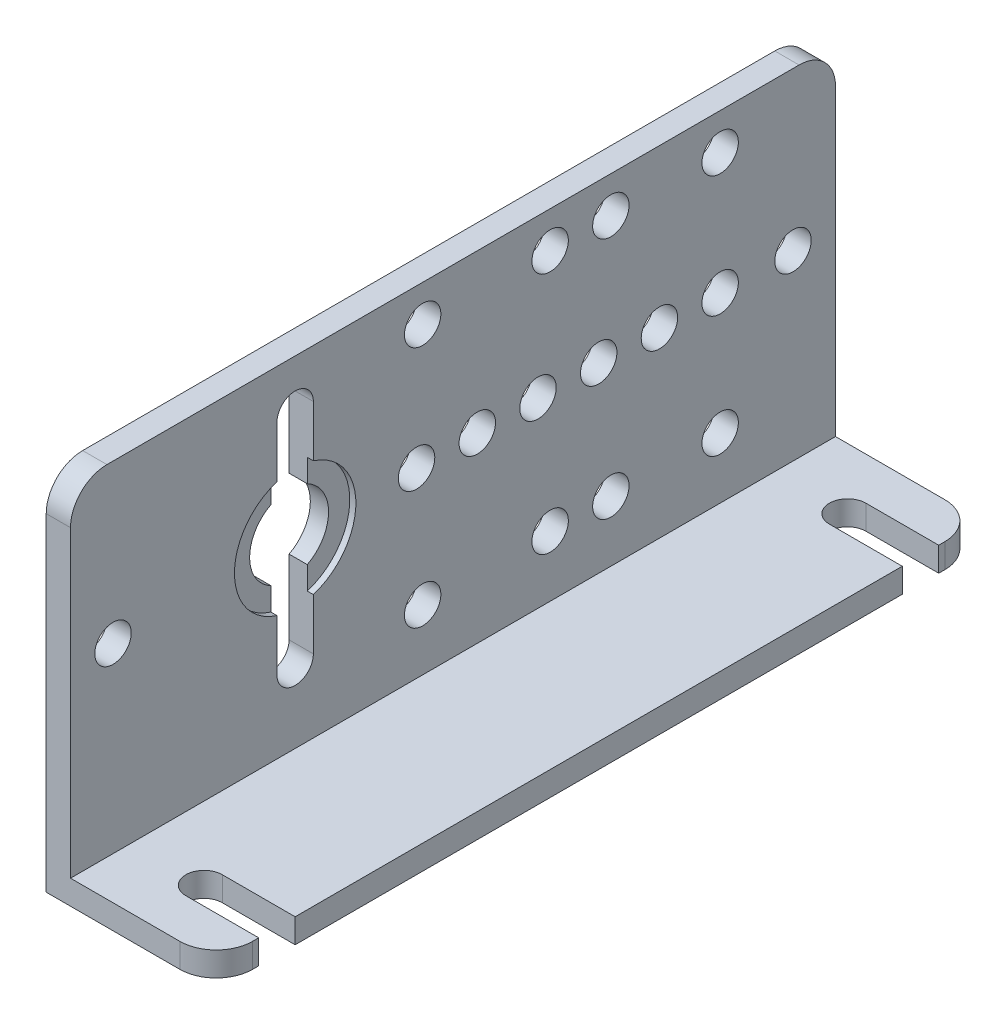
ISO-10303-21;
HEADER;
FILE_DESCRIPTION(('STEP AP214'),'2;1');
FILE_NAME('part.step','',(''),(''),'','','');
FILE_SCHEMA(('AUTOMOTIVE_DESIGN { 1 0 10303 214 1 1 1 1 }'));
ENDSEC;
DATA;
#1=APPLICATION_CONTEXT('core data for automotive mechanical design processes');
#2=APPLICATION_PROTOCOL_DEFINITION('international standard','automotive_design',2000,#1);
#3=PRODUCT_CONTEXT('',#1,'mechanical');
#4=PRODUCT('Part','Part','',(#3));
#5=PRODUCT_RELATED_PRODUCT_CATEGORY('part','',(#4));
#6=PRODUCT_DEFINITION_FORMATION('','',#4);
#7=PRODUCT_DEFINITION_CONTEXT('part definition',#1,'design');
#8=PRODUCT_DEFINITION('design','',#6,#7);
#9=PRODUCT_DEFINITION_SHAPE('','',#8);
#10=(LENGTH_UNIT() NAMED_UNIT(*) SI_UNIT(.MILLI.,.METRE.));
#11=(NAMED_UNIT(*) PLANE_ANGLE_UNIT() SI_UNIT($,.RADIAN.));
#12=(NAMED_UNIT(*) SI_UNIT($,.STERADIAN.) SOLID_ANGLE_UNIT());
#13=UNCERTAINTY_MEASURE_WITH_UNIT(LENGTH_MEASURE(1.E-05),#10,'distance_accuracy_value','');
#14=(GEOMETRIC_REPRESENTATION_CONTEXT(3) GLOBAL_UNCERTAINTY_ASSIGNED_CONTEXT((#13)) GLOBAL_UNIT_ASSIGNED_CONTEXT((#10,
#11,#12)) REPRESENTATION_CONTEXT('',''));
#15=CARTESIAN_POINT('',(0.,0.,0.));
#16=DIRECTION('',(0.,0.,1.));
#17=DIRECTION('',(1.,0.,0.));
#18=AXIS2_PLACEMENT_3D('',#15,#16,#17);
#19=CARTESIAN_POINT('',(14.,17.,44.5));
#20=DIRECTION('',(-1.,0.,0.));
#21=DIRECTION('',(0.,-1.,0.));
#22=AXIS2_PLACEMENT_3D('',#19,#20,#21);
#23=CYLINDRICAL_SURFACE('',#22,3.25);
#24=CARTESIAN_POINT('',(1.5,17.,44.5));
#25=DIRECTION('',(1.,0.,0.));
#26=DIRECTION('',(0.,1.,0.));
#27=AXIS2_PLACEMENT_3D('',#24,#25,#26);
#28=CIRCLE('',#27,3.25);
#29=CARTESIAN_POINT('',(1.5,14.1168593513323,46.));
#30=VERTEX_POINT('',#29);
#31=CARTESIAN_POINT('',(1.5,19.8831406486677,46.));
#32=VERTEX_POINT('',#31);
#33=EDGE_CURVE('E557',#30,#32,#28,.F.);
#34=ORIENTED_EDGE('',*,*,#33,.F.);
#35=DIRECTION('',(-1.,0.,0.));
#36=VECTOR('',#35,1.);
#37=CARTESIAN_POINT('',(14.,14.1168593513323,46.));
#38=LINE('',#37,#36);
#39=CARTESIAN_POINT('',(0.,14.1168593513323,46.));
#40=VERTEX_POINT('',#39);
#41=EDGE_CURVE('E531',#30,#40,#38,.T.);
#42=ORIENTED_EDGE('',*,*,#41,.T.);
#43=CARTESIAN_POINT('',(0.,17.,44.5));
#44=DIRECTION('',(-1.,0.,0.));
#45=DIRECTION('',(0.,-1.,0.));
#46=AXIS2_PLACEMENT_3D('',#43,#44,#45);
#47=CIRCLE('',#46,3.25);
#48=CARTESIAN_POINT('',(0.,19.8831406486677,46.));
#49=VERTEX_POINT('',#48);
#50=EDGE_CURVE('E539',#40,#49,#47,.T.);
#51=ORIENTED_EDGE('',*,*,#50,.T.);
#52=DIRECTION('',(-1.,0.,0.));
#53=VECTOR('',#52,1.);
#54=CARTESIAN_POINT('',(14.,19.8831406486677,46.));
#55=LINE('',#54,#53);
#56=EDGE_CURVE('E535',#32,#49,#55,.T.);
#57=ORIENTED_EDGE('',*,*,#56,.F.);
#58=EDGE_LOOP('',(#34,#42,#51,#57));
#59=FACE_BOUND('',#58,.T.);
#60=ADVANCED_FACE('F26',(#59),#23,.F.);
#61=CARTESIAN_POINT('',(14.,17.,44.5));
#62=DIRECTION('',(-1.,0.,0.));
#63=DIRECTION('',(0.,-1.,0.));
#64=AXIS2_PLACEMENT_3D('',#61,#62,#63);
#65=CYLINDRICAL_SURFACE('',#64,3.25);
#66=CARTESIAN_POINT('',(1.5,17.,44.5));
#67=DIRECTION('',(1.,0.,0.));
#68=DIRECTION('',(0.,1.,0.));
#69=AXIS2_PLACEMENT_3D('',#66,#67,#68);
#70=CIRCLE('',#69,3.25);
#71=CARTESIAN_POINT('',(1.5,19.8831406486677,43.));
#72=VERTEX_POINT('',#71);
#73=CARTESIAN_POINT('',(1.5,14.1168593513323,43.));
#74=VERTEX_POINT('',#73);
#75=EDGE_CURVE('E257',#72,#74,#70,.F.);
#76=ORIENTED_EDGE('',*,*,#75,.F.);
#77=DIRECTION('',(-1.,0.,0.));
#78=VECTOR('',#77,1.);
#79=CARTESIAN_POINT('',(14.,19.8831406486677,43.));
#80=LINE('',#79,#78);
#81=CARTESIAN_POINT('',(0.,19.8831406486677,43.));
#82=VERTEX_POINT('',#81);
#83=EDGE_CURVE('E265',#72,#82,#80,.T.);
#84=ORIENTED_EDGE('',*,*,#83,.T.);
#85=CARTESIAN_POINT('',(0.,17.,44.5));
#86=DIRECTION('',(-1.,0.,0.));
#87=DIRECTION('',(0.,-1.,0.));
#88=AXIS2_PLACEMENT_3D('',#85,#86,#87);
#89=CIRCLE('',#88,3.25);
#90=CARTESIAN_POINT('',(0.,14.1168593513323,43.));
#91=VERTEX_POINT('',#90);
#92=EDGE_CURVE('E548',#82,#91,#89,.T.);
#93=ORIENTED_EDGE('',*,*,#92,.T.);
#94=DIRECTION('',(-1.,0.,0.));
#95=VECTOR('',#94,1.);
#96=CARTESIAN_POINT('',(14.,14.1168593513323,43.));
#97=LINE('',#96,#95);
#98=EDGE_CURVE('E267',#74,#91,#97,.T.);
#99=ORIENTED_EDGE('',*,*,#98,.F.);
#100=EDGE_LOOP('',(#76,#84,#93,#99));
#101=FACE_BOUND('',#100,.T.);
#102=ADVANCED_FACE('F263',(#101),#65,.F.);
#103=CARTESIAN_POINT('',(14.,17.,34.5));
#104=DIRECTION('',(-1.,0.,0.));
#105=DIRECTION('',(0.,-1.,0.));
#106=AXIS2_PLACEMENT_3D('',#103,#104,#105);
#107=CYLINDRICAL_SURFACE('',#106,1.5);
#108=CARTESIAN_POINT('',(0.,17.,34.5));
#109=DIRECTION('',(-1.,0.,0.));
#110=DIRECTION('',(0.,-1.,0.));
#111=AXIS2_PLACEMENT_3D('',#108,#109,#110);
#112=CIRCLE('',#111,1.5);
#113=CARTESIAN_POINT('',(0.,15.5,34.5));
#114=VERTEX_POINT('',#113);
#115=EDGE_CURVE('E497',#114,#114,#112,.T.);
#116=CARTESIAN_POINT('',(2.,17.,34.5));
#117=DIRECTION('',(-1.,0.,0.));
#118=DIRECTION('',(0.,-1.,0.));
#119=AXIS2_PLACEMENT_3D('',#116,#117,#118);
#120=CIRCLE('',#119,1.5);
#121=CARTESIAN_POINT('',(2.,15.5,34.5));
#122=VERTEX_POINT('',#121);
#123=EDGE_CURVE('E500',#122,#122,#120,.T.);
#124=CARTESIAN_POINT('',(0.,15.5,34.5));
#125=CARTESIAN_POINT('',(0.0208333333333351,15.5,34.5));
#126=CARTESIAN_POINT('',(0.0416666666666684,15.5,34.5));
#127=CARTESIAN_POINT('',(0.0833333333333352,15.5,34.5));
#128=CARTESIAN_POINT('',(0.104166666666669,15.5,34.5));
#129=CARTESIAN_POINT('',(0.145833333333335,15.5,34.5));
#130=CARTESIAN_POINT('',(0.166666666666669,15.5,34.5));
#131=CARTESIAN_POINT('',(0.208333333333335,15.5,34.5));
#132=CARTESIAN_POINT('',(0.229166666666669,15.5,34.5));
#133=CARTESIAN_POINT('',(0.270833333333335,15.5,34.5));
#134=CARTESIAN_POINT('',(0.291666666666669,15.5,34.5));
#135=CARTESIAN_POINT('',(0.333333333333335,15.5,34.5));
#136=CARTESIAN_POINT('',(0.354166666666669,15.5,34.5));
#137=CARTESIAN_POINT('',(0.395833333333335,15.5,34.5));
#138=CARTESIAN_POINT('',(0.416666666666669,15.5,34.5));
#139=CARTESIAN_POINT('',(0.458333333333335,15.5,34.5));
#140=CARTESIAN_POINT('',(0.479166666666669,15.5,34.5));
#141=CARTESIAN_POINT('',(0.520833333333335,15.5,34.5));
#142=CARTESIAN_POINT('',(0.541666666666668,15.5,34.5));
#143=CARTESIAN_POINT('',(0.583333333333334,15.5,34.5));
#144=CARTESIAN_POINT('',(0.604166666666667,15.5,34.5));
#145=CARTESIAN_POINT('',(0.645833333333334,15.5,34.5));
#146=CARTESIAN_POINT('',(0.666666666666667,15.5,34.5));
#147=CARTESIAN_POINT('',(0.708333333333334,15.5,34.5));
#148=CARTESIAN_POINT('',(0.729166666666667,15.5,34.5));
#149=CARTESIAN_POINT('',(0.770833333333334,15.5,34.5));
#150=CARTESIAN_POINT('',(0.791666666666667,15.5,34.5));
#151=CARTESIAN_POINT('',(0.833333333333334,15.5,34.5));
#152=CARTESIAN_POINT('',(0.854166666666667,15.5,34.5));
#153=CARTESIAN_POINT('',(0.895833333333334,15.5,34.5));
#154=CARTESIAN_POINT('',(0.916666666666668,15.5,34.5));
#155=CARTESIAN_POINT('',(0.958333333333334,15.5,34.5));
#156=CARTESIAN_POINT('',(0.979166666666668,15.5,34.5));
#157=CARTESIAN_POINT('',(1.02083333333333,15.5,34.5));
#158=CARTESIAN_POINT('',(1.04166666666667,15.5,34.5));
#159=CARTESIAN_POINT('',(1.08333333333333,15.5,34.5));
#160=CARTESIAN_POINT('',(1.10416666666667,15.5,34.5));
#161=CARTESIAN_POINT('',(1.14583333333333,15.5,34.5));
#162=CARTESIAN_POINT('',(1.16666666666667,15.5,34.5));
#163=CARTESIAN_POINT('',(1.20833333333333,15.5,34.5));
#164=CARTESIAN_POINT('',(1.22916666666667,15.5,34.5));
#165=CARTESIAN_POINT('',(1.27083333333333,15.5,34.5));
#166=CARTESIAN_POINT('',(1.29166666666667,15.5,34.5));
#167=CARTESIAN_POINT('',(1.33333333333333,15.5,34.5));
#168=CARTESIAN_POINT('',(1.35416666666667,15.5,34.5));
#169=CARTESIAN_POINT('',(1.39583333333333,15.5,34.5));
#170=CARTESIAN_POINT('',(1.41666666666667,15.5,34.5));
#171=CARTESIAN_POINT('',(1.45833333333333,15.5,34.5));
#172=CARTESIAN_POINT('',(1.47916666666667,15.5,34.5));
#173=CARTESIAN_POINT('',(1.52083333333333,15.5,34.5));
#174=CARTESIAN_POINT('',(1.54166666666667,15.5,34.5));
#175=CARTESIAN_POINT('',(1.58333333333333,15.5,34.5));
#176=CARTESIAN_POINT('',(1.60416666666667,15.5,34.5));
#177=CARTESIAN_POINT('',(1.64583333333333,15.5,34.5));
#178=CARTESIAN_POINT('',(1.66666666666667,15.5,34.5));
#179=CARTESIAN_POINT('',(1.70833333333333,15.5,34.5));
#180=CARTESIAN_POINT('',(1.72916666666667,15.5,34.5));
#181=CARTESIAN_POINT('',(1.77083333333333,15.5,34.5));
#182=CARTESIAN_POINT('',(1.79166666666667,15.5,34.5));
#183=CARTESIAN_POINT('',(1.83333333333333,15.5,34.5));
#184=CARTESIAN_POINT('',(1.85416666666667,15.5,34.5));
#185=CARTESIAN_POINT('',(1.89583333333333,15.5,34.5));
#186=CARTESIAN_POINT('',(1.91666666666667,15.5,34.5));
#187=CARTESIAN_POINT('',(1.95833333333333,15.5,34.5));
#188=CARTESIAN_POINT('',(1.97916666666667,15.5,34.5));
#189=CARTESIAN_POINT('',(2.,15.5,34.5));
#190=B_SPLINE_CURVE_WITH_KNOTS('',3,(#124,#125,#126,#127,#128,#129,#130,#131,#132,#133,#134,
#135,#136,#137,#138,#139,#140,#141,#142,#143,#144,#145,#146,#147,#148,#149,#150,#151,#152,#153,
#154,#155,#156,#157,#158,#159,#160,#161,#162,#163,#164,#165,#166,#167,#168,#169,#170,#171,#172,
#173,#174,#175,#176,#177,#178,#179,#180,#181,#182,#183,#184,#185,#186,#187,#188,#189),
.UNSPECIFIED.,.F.,.F.,(4,2,2,2,2,2,2,2,2,2,2,2,2,2,2,2,2,2,2,2,2,2,2,2,2,2,2,2,2,2,2,2,4),(0.,
0.0625000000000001,0.125,0.1875,0.25,0.3125,0.375,0.4375,0.5,0.562499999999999,
0.624999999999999,0.687499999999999,0.749999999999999,0.812499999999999,0.874999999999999,
0.937499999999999,0.999999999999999,1.0625,1.125,1.1875,1.25,1.3125,1.375,1.4375,1.5,1.5625,
1.625,1.6875,1.75,1.8125,1.875,1.9375,2.),.UNSPECIFIED.);
#191=EDGE_CURVE('BSEAM28',#114,#122,#190,.T.);
#192=ORIENTED_EDGE('',*,*,#115,.T.);
#193=ORIENTED_EDGE('',*,*,#123,.F.);
#194=ORIENTED_EDGE('',*,*,#191,.T.);
#195=ORIENTED_EDGE('',*,*,#191,.F.);
#196=EDGE_LOOP('',(#192,#194,#193,#195));
#197=FACE_BOUND('',#196,.T.);
#198=ADVANCED_FACE('F28',(#197),#107,.F.);
#199=CARTESIAN_POINT('',(14.,17.,29.5));
#200=DIRECTION('',(-1.,0.,0.));
#201=DIRECTION('',(0.,-1.,0.));
#202=AXIS2_PLACEMENT_3D('',#199,#200,#201);
#203=CYLINDRICAL_SURFACE('',#202,1.5);
#204=CARTESIAN_POINT('',(0.,17.,29.5));
#205=DIRECTION('',(-1.,0.,0.));
#206=DIRECTION('',(0.,-1.,0.));
#207=AXIS2_PLACEMENT_3D('',#204,#205,#206);
#208=CIRCLE('',#207,1.5);
#209=CARTESIAN_POINT('',(0.,15.5,29.5));
#210=VERTEX_POINT('',#209);
#211=EDGE_CURVE('E491',#210,#210,#208,.T.);
#212=CARTESIAN_POINT('',(2.,17.,29.5));
#213=DIRECTION('',(-1.,0.,0.));
#214=DIRECTION('',(0.,-1.,0.));
#215=AXIS2_PLACEMENT_3D('',#212,#213,#214);
#216=CIRCLE('',#215,1.5);
#217=CARTESIAN_POINT('',(2.,15.5,29.5));
#218=VERTEX_POINT('',#217);
#219=EDGE_CURVE('E494',#218,#218,#216,.T.);
#220=CARTESIAN_POINT('',(0.,15.5,29.5));
#221=CARTESIAN_POINT('',(0.0208333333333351,15.5,29.5));
#222=CARTESIAN_POINT('',(0.0416666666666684,15.5,29.5));
#223=CARTESIAN_POINT('',(0.0833333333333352,15.5,29.5));
#224=CARTESIAN_POINT('',(0.104166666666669,15.5,29.5));
#225=CARTESIAN_POINT('',(0.145833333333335,15.5,29.5));
#226=CARTESIAN_POINT('',(0.166666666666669,15.5,29.5));
#227=CARTESIAN_POINT('',(0.208333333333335,15.5,29.5));
#228=CARTESIAN_POINT('',(0.229166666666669,15.5,29.5));
#229=CARTESIAN_POINT('',(0.270833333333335,15.5,29.5));
#230=CARTESIAN_POINT('',(0.291666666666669,15.5,29.5));
#231=CARTESIAN_POINT('',(0.333333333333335,15.5,29.5));
#232=CARTESIAN_POINT('',(0.354166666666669,15.5,29.5));
#233=CARTESIAN_POINT('',(0.395833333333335,15.5,29.5));
#234=CARTESIAN_POINT('',(0.416666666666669,15.5,29.5));
#235=CARTESIAN_POINT('',(0.458333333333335,15.5,29.5));
#236=CARTESIAN_POINT('',(0.479166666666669,15.5,29.5));
#237=CARTESIAN_POINT('',(0.520833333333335,15.5,29.5));
#238=CARTESIAN_POINT('',(0.541666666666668,15.5,29.5));
#239=CARTESIAN_POINT('',(0.583333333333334,15.5,29.5));
#240=CARTESIAN_POINT('',(0.604166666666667,15.5,29.5));
#241=CARTESIAN_POINT('',(0.645833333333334,15.5,29.5));
#242=CARTESIAN_POINT('',(0.666666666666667,15.5,29.5));
#243=CARTESIAN_POINT('',(0.708333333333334,15.5,29.5));
#244=CARTESIAN_POINT('',(0.729166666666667,15.5,29.5));
#245=CARTESIAN_POINT('',(0.770833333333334,15.5,29.5));
#246=CARTESIAN_POINT('',(0.791666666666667,15.5,29.5));
#247=CARTESIAN_POINT('',(0.833333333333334,15.5,29.5));
#248=CARTESIAN_POINT('',(0.854166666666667,15.5,29.5));
#249=CARTESIAN_POINT('',(0.895833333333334,15.5,29.5));
#250=CARTESIAN_POINT('',(0.916666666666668,15.5,29.5));
#251=CARTESIAN_POINT('',(0.958333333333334,15.5,29.5));
#252=CARTESIAN_POINT('',(0.979166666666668,15.5,29.5));
#253=CARTESIAN_POINT('',(1.02083333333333,15.5,29.5));
#254=CARTESIAN_POINT('',(1.04166666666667,15.5,29.5));
#255=CARTESIAN_POINT('',(1.08333333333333,15.5,29.5));
#256=CARTESIAN_POINT('',(1.10416666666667,15.5,29.5));
#257=CARTESIAN_POINT('',(1.14583333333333,15.5,29.5));
#258=CARTESIAN_POINT('',(1.16666666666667,15.5,29.5));
#259=CARTESIAN_POINT('',(1.20833333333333,15.5,29.5));
#260=CARTESIAN_POINT('',(1.22916666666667,15.5,29.5));
#261=CARTESIAN_POINT('',(1.27083333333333,15.5,29.5));
#262=CARTESIAN_POINT('',(1.29166666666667,15.5,29.5));
#263=CARTESIAN_POINT('',(1.33333333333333,15.5,29.5));
#264=CARTESIAN_POINT('',(1.35416666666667,15.5,29.5));
#265=CARTESIAN_POINT('',(1.39583333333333,15.5,29.5));
#266=CARTESIAN_POINT('',(1.41666666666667,15.5,29.5));
#267=CARTESIAN_POINT('',(1.45833333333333,15.5,29.5));
#268=CARTESIAN_POINT('',(1.47916666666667,15.5,29.5));
#269=CARTESIAN_POINT('',(1.52083333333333,15.5,29.5));
#270=CARTESIAN_POINT('',(1.54166666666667,15.5,29.5));
#271=CARTESIAN_POINT('',(1.58333333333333,15.5,29.5));
#272=CARTESIAN_POINT('',(1.60416666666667,15.5,29.5));
#273=CARTESIAN_POINT('',(1.64583333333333,15.5,29.5));
#274=CARTESIAN_POINT('',(1.66666666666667,15.5,29.5));
#275=CARTESIAN_POINT('',(1.70833333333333,15.5,29.5));
#276=CARTESIAN_POINT('',(1.72916666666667,15.5,29.5));
#277=CARTESIAN_POINT('',(1.77083333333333,15.5,29.5));
#278=CARTESIAN_POINT('',(1.79166666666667,15.5,29.5));
#279=CARTESIAN_POINT('',(1.83333333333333,15.5,29.5));
#280=CARTESIAN_POINT('',(1.85416666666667,15.5,29.5));
#281=CARTESIAN_POINT('',(1.89583333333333,15.5,29.5));
#282=CARTESIAN_POINT('',(1.91666666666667,15.5,29.5));
#283=CARTESIAN_POINT('',(1.95833333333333,15.5,29.5));
#284=CARTESIAN_POINT('',(1.97916666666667,15.5,29.5));
#285=CARTESIAN_POINT('',(2.,15.5,29.5));
#286=B_SPLINE_CURVE_WITH_KNOTS('',3,(#220,#221,#222,#223,#224,#225,#226,#227,#228,#229,#230,
#231,#232,#233,#234,#235,#236,#237,#238,#239,#240,#241,#242,#243,#244,#245,#246,#247,#248,#249,
#250,#251,#252,#253,#254,#255,#256,#257,#258,#259,#260,#261,#262,#263,#264,#265,#266,#267,#268,
#269,#270,#271,#272,#273,#274,#275,#276,#277,#278,#279,#280,#281,#282,#283,#284,#285),
.UNSPECIFIED.,.F.,.F.,(4,2,2,2,2,2,2,2,2,2,2,2,2,2,2,2,2,2,2,2,2,2,2,2,2,2,2,2,2,2,2,2,4),(0.,
0.0625000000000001,0.125,0.1875,0.25,0.3125,0.375,0.4375,0.5,0.562499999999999,
0.624999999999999,0.687499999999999,0.749999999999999,0.812499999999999,0.874999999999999,
0.937499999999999,0.999999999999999,1.0625,1.125,1.1875,1.25,1.3125,1.375,1.4375,1.5,1.5625,
1.625,1.6875,1.75,1.8125,1.875,1.9375,2.),.UNSPECIFIED.);
#287=EDGE_CURVE('BSEAM725',#210,#218,#286,.T.);
#288=ORIENTED_EDGE('',*,*,#211,.T.);
#289=ORIENTED_EDGE('',*,*,#219,.F.);
#290=ORIENTED_EDGE('',*,*,#287,.T.);
#291=ORIENTED_EDGE('',*,*,#287,.F.);
#292=EDGE_LOOP('',(#288,#290,#289,#291));
#293=FACE_BOUND('',#292,.T.);
#294=ADVANCED_FACE('F725',(#293),#203,.F.);
#295=CARTESIAN_POINT('',(14.,17.,24.5));
#296=DIRECTION('',(-1.,0.,0.));
#297=DIRECTION('',(0.,-1.,0.));
#298=AXIS2_PLACEMENT_3D('',#295,#296,#297);
#299=CYLINDRICAL_SURFACE('',#298,1.5);
#300=CARTESIAN_POINT('',(0.,17.,24.5));
#301=DIRECTION('',(-1.,0.,0.));
#302=DIRECTION('',(0.,-1.,0.));
#303=AXIS2_PLACEMENT_3D('',#300,#301,#302);
#304=CIRCLE('',#303,1.5);
#305=CARTESIAN_POINT('',(0.,15.5,24.5));
#306=VERTEX_POINT('',#305);
#307=EDGE_CURVE('E485',#306,#306,#304,.T.);
#308=CARTESIAN_POINT('',(2.,17.,24.5));
#309=DIRECTION('',(-1.,0.,0.));
#310=DIRECTION('',(0.,-1.,0.));
#311=AXIS2_PLACEMENT_3D('',#308,#309,#310);
#312=CIRCLE('',#311,1.5);
#313=CARTESIAN_POINT('',(2.,15.5,24.5));
#314=VERTEX_POINT('',#313);
#315=EDGE_CURVE('E488',#314,#314,#312,.T.);
#316=CARTESIAN_POINT('',(0.,15.5,24.5));
#317=CARTESIAN_POINT('',(0.0208333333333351,15.5,24.5));
#318=CARTESIAN_POINT('',(0.0416666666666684,15.5,24.5));
#319=CARTESIAN_POINT('',(0.0833333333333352,15.5,24.5));
#320=CARTESIAN_POINT('',(0.104166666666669,15.5,24.5));
#321=CARTESIAN_POINT('',(0.145833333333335,15.5,24.5));
#322=CARTESIAN_POINT('',(0.166666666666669,15.5,24.5));
#323=CARTESIAN_POINT('',(0.208333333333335,15.5,24.5));
#324=CARTESIAN_POINT('',(0.229166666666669,15.5,24.5));
#325=CARTESIAN_POINT('',(0.270833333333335,15.5,24.5));
#326=CARTESIAN_POINT('',(0.291666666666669,15.5,24.5));
#327=CARTESIAN_POINT('',(0.333333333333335,15.5,24.5));
#328=CARTESIAN_POINT('',(0.354166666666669,15.5,24.5));
#329=CARTESIAN_POINT('',(0.395833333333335,15.5,24.5));
#330=CARTESIAN_POINT('',(0.416666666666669,15.5,24.5));
#331=CARTESIAN_POINT('',(0.458333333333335,15.5,24.5));
#332=CARTESIAN_POINT('',(0.479166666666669,15.5,24.5));
#333=CARTESIAN_POINT('',(0.520833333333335,15.5,24.5));
#334=CARTESIAN_POINT('',(0.541666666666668,15.5,24.5));
#335=CARTESIAN_POINT('',(0.583333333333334,15.5,24.5));
#336=CARTESIAN_POINT('',(0.604166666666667,15.5,24.5));
#337=CARTESIAN_POINT('',(0.645833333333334,15.5,24.5));
#338=CARTESIAN_POINT('',(0.666666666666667,15.5,24.5));
#339=CARTESIAN_POINT('',(0.708333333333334,15.5,24.5));
#340=CARTESIAN_POINT('',(0.729166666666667,15.5,24.5));
#341=CARTESIAN_POINT('',(0.770833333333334,15.5,24.5));
#342=CARTESIAN_POINT('',(0.791666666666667,15.5,24.5));
#343=CARTESIAN_POINT('',(0.833333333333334,15.5,24.5));
#344=CARTESIAN_POINT('',(0.854166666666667,15.5,24.5));
#345=CARTESIAN_POINT('',(0.895833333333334,15.5,24.5));
#346=CARTESIAN_POINT('',(0.916666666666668,15.5,24.5));
#347=CARTESIAN_POINT('',(0.958333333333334,15.5,24.5));
#348=CARTESIAN_POINT('',(0.979166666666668,15.5,24.5));
#349=CARTESIAN_POINT('',(1.02083333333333,15.5,24.5));
#350=CARTESIAN_POINT('',(1.04166666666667,15.5,24.5));
#351=CARTESIAN_POINT('',(1.08333333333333,15.5,24.5));
#352=CARTESIAN_POINT('',(1.10416666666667,15.5,24.5));
#353=CARTESIAN_POINT('',(1.14583333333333,15.5,24.5));
#354=CARTESIAN_POINT('',(1.16666666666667,15.5,24.5));
#355=CARTESIAN_POINT('',(1.20833333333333,15.5,24.5));
#356=CARTESIAN_POINT('',(1.22916666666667,15.5,24.5));
#357=CARTESIAN_POINT('',(1.27083333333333,15.5,24.5));
#358=CARTESIAN_POINT('',(1.29166666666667,15.5,24.5));
#359=CARTESIAN_POINT('',(1.33333333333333,15.5,24.5));
#360=CARTESIAN_POINT('',(1.35416666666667,15.5,24.5));
#361=CARTESIAN_POINT('',(1.39583333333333,15.5,24.5));
#362=CARTESIAN_POINT('',(1.41666666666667,15.5,24.5));
#363=CARTESIAN_POINT('',(1.45833333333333,15.5,24.5));
#364=CARTESIAN_POINT('',(1.47916666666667,15.5,24.5));
#365=CARTESIAN_POINT('',(1.52083333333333,15.5,24.5));
#366=CARTESIAN_POINT('',(1.54166666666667,15.5,24.5));
#367=CARTESIAN_POINT('',(1.58333333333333,15.5,24.5));
#368=CARTESIAN_POINT('',(1.60416666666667,15.5,24.5));
#369=CARTESIAN_POINT('',(1.64583333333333,15.5,24.5));
#370=CARTESIAN_POINT('',(1.66666666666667,15.5,24.5));
#371=CARTESIAN_POINT('',(1.70833333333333,15.5,24.5));
#372=CARTESIAN_POINT('',(1.72916666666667,15.5,24.5));
#373=CARTESIAN_POINT('',(1.77083333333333,15.5,24.5));
#374=CARTESIAN_POINT('',(1.79166666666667,15.5,24.5));
#375=CARTESIAN_POINT('',(1.83333333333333,15.5,24.5));
#376=CARTESIAN_POINT('',(1.85416666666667,15.5,24.5));
#377=CARTESIAN_POINT('',(1.89583333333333,15.5,24.5));
#378=CARTESIAN_POINT('',(1.91666666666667,15.5,24.5));
#379=CARTESIAN_POINT('',(1.95833333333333,15.5,24.5));
#380=CARTESIAN_POINT('',(1.97916666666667,15.5,24.5));
#381=CARTESIAN_POINT('',(2.,15.5,24.5));
#382=B_SPLINE_CURVE_WITH_KNOTS('',3,(#316,#317,#318,#319,#320,#321,#322,#323,#324,#325,#326,
#327,#328,#329,#330,#331,#332,#333,#334,#335,#336,#337,#338,#339,#340,#341,#342,#343,#344,#345,
#346,#347,#348,#349,#350,#351,#352,#353,#354,#355,#356,#357,#358,#359,#360,#361,#362,#363,#364,
#365,#366,#367,#368,#369,#370,#371,#372,#373,#374,#375,#376,#377,#378,#379,#380,#381),
.UNSPECIFIED.,.F.,.F.,(4,2,2,2,2,2,2,2,2,2,2,2,2,2,2,2,2,2,2,2,2,2,2,2,2,2,2,2,2,2,2,2,4),(0.,
0.0625000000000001,0.125,0.1875,0.25,0.3125,0.375,0.4375,0.5,0.562499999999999,
0.624999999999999,0.687499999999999,0.749999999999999,0.812499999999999,0.874999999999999,
0.937499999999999,0.999999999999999,1.0625,1.125,1.1875,1.25,1.3125,1.375,1.4375,1.5,1.5625,
1.625,1.6875,1.75,1.8125,1.875,1.9375,2.),.UNSPECIFIED.);
#383=EDGE_CURVE('BSEAM722',#306,#314,#382,.T.);
#384=ORIENTED_EDGE('',*,*,#307,.T.);
#385=ORIENTED_EDGE('',*,*,#315,.F.);
#386=ORIENTED_EDGE('',*,*,#383,.T.);
#387=ORIENTED_EDGE('',*,*,#383,.F.);
#388=EDGE_LOOP('',(#384,#386,#385,#387));
#389=FACE_BOUND('',#388,.T.);
#390=ADVANCED_FACE('F722',(#389),#299,.F.);
#391=CARTESIAN_POINT('',(14.,17.,19.5));
#392=DIRECTION('',(-1.,0.,0.));
#393=DIRECTION('',(0.,-1.,0.));
#394=AXIS2_PLACEMENT_3D('',#391,#392,#393);
#395=CYLINDRICAL_SURFACE('',#394,1.5);
#396=CARTESIAN_POINT('',(0.,17.,19.5));
#397=DIRECTION('',(-1.,0.,0.));
#398=DIRECTION('',(0.,-1.,0.));
#399=AXIS2_PLACEMENT_3D('',#396,#397,#398);
#400=CIRCLE('',#399,1.5);
#401=CARTESIAN_POINT('',(0.,15.5,19.5));
#402=VERTEX_POINT('',#401);
#403=EDGE_CURVE('E479',#402,#402,#400,.T.);
#404=CARTESIAN_POINT('',(2.,17.,19.5));
#405=DIRECTION('',(-1.,0.,0.));
#406=DIRECTION('',(0.,-1.,0.));
#407=AXIS2_PLACEMENT_3D('',#404,#405,#406);
#408=CIRCLE('',#407,1.5);
#409=CARTESIAN_POINT('',(2.,15.5,19.5));
#410=VERTEX_POINT('',#409);
#411=EDGE_CURVE('E482',#410,#410,#408,.T.);
#412=CARTESIAN_POINT('',(0.,15.5,19.5));
#413=CARTESIAN_POINT('',(0.0208333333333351,15.5,19.5));
#414=CARTESIAN_POINT('',(0.0416666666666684,15.5,19.5));
#415=CARTESIAN_POINT('',(0.0833333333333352,15.5,19.5));
#416=CARTESIAN_POINT('',(0.104166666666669,15.5,19.5));
#417=CARTESIAN_POINT('',(0.145833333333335,15.5,19.5));
#418=CARTESIAN_POINT('',(0.166666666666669,15.5,19.5));
#419=CARTESIAN_POINT('',(0.208333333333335,15.5,19.5));
#420=CARTESIAN_POINT('',(0.229166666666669,15.5,19.5));
#421=CARTESIAN_POINT('',(0.270833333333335,15.5,19.5));
#422=CARTESIAN_POINT('',(0.291666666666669,15.5,19.5));
#423=CARTESIAN_POINT('',(0.333333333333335,15.5,19.5));
#424=CARTESIAN_POINT('',(0.354166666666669,15.5,19.5));
#425=CARTESIAN_POINT('',(0.395833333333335,15.5,19.5));
#426=CARTESIAN_POINT('',(0.416666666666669,15.5,19.5));
#427=CARTESIAN_POINT('',(0.458333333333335,15.5,19.5));
#428=CARTESIAN_POINT('',(0.479166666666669,15.5,19.5));
#429=CARTESIAN_POINT('',(0.520833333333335,15.5,19.5));
#430=CARTESIAN_POINT('',(0.541666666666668,15.5,19.5));
#431=CARTESIAN_POINT('',(0.583333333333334,15.5,19.5));
#432=CARTESIAN_POINT('',(0.604166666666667,15.5,19.5));
#433=CARTESIAN_POINT('',(0.645833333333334,15.5,19.5));
#434=CARTESIAN_POINT('',(0.666666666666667,15.5,19.5));
#435=CARTESIAN_POINT('',(0.708333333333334,15.5,19.5));
#436=CARTESIAN_POINT('',(0.729166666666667,15.5,19.5));
#437=CARTESIAN_POINT('',(0.770833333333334,15.5,19.5));
#438=CARTESIAN_POINT('',(0.791666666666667,15.5,19.5));
#439=CARTESIAN_POINT('',(0.833333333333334,15.5,19.5));
#440=CARTESIAN_POINT('',(0.854166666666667,15.5,19.5));
#441=CARTESIAN_POINT('',(0.895833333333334,15.5,19.5));
#442=CARTESIAN_POINT('',(0.916666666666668,15.5,19.5));
#443=CARTESIAN_POINT('',(0.958333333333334,15.5,19.5));
#444=CARTESIAN_POINT('',(0.979166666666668,15.5,19.5));
#445=CARTESIAN_POINT('',(1.02083333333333,15.5,19.5));
#446=CARTESIAN_POINT('',(1.04166666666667,15.5,19.5));
#447=CARTESIAN_POINT('',(1.08333333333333,15.5,19.5));
#448=CARTESIAN_POINT('',(1.10416666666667,15.5,19.5));
#449=CARTESIAN_POINT('',(1.14583333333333,15.5,19.5));
#450=CARTESIAN_POINT('',(1.16666666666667,15.5,19.5));
#451=CARTESIAN_POINT('',(1.20833333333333,15.5,19.5));
#452=CARTESIAN_POINT('',(1.22916666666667,15.5,19.5));
#453=CARTESIAN_POINT('',(1.27083333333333,15.5,19.5));
#454=CARTESIAN_POINT('',(1.29166666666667,15.5,19.5));
#455=CARTESIAN_POINT('',(1.33333333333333,15.5,19.5));
#456=CARTESIAN_POINT('',(1.35416666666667,15.5,19.5));
#457=CARTESIAN_POINT('',(1.39583333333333,15.5,19.5));
#458=CARTESIAN_POINT('',(1.41666666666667,15.5,19.5));
#459=CARTESIAN_POINT('',(1.45833333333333,15.5,19.5));
#460=CARTESIAN_POINT('',(1.47916666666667,15.5,19.5));
#461=CARTESIAN_POINT('',(1.52083333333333,15.5,19.5));
#462=CARTESIAN_POINT('',(1.54166666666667,15.5,19.5));
#463=CARTESIAN_POINT('',(1.58333333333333,15.5,19.5));
#464=CARTESIAN_POINT('',(1.60416666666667,15.5,19.5));
#465=CARTESIAN_POINT('',(1.64583333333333,15.5,19.5));
#466=CARTESIAN_POINT('',(1.66666666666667,15.5,19.5));
#467=CARTESIAN_POINT('',(1.70833333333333,15.5,19.5));
#468=CARTESIAN_POINT('',(1.72916666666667,15.5,19.5));
#469=CARTESIAN_POINT('',(1.77083333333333,15.5,19.5));
#470=CARTESIAN_POINT('',(1.79166666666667,15.5,19.5));
#471=CARTESIAN_POINT('',(1.83333333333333,15.5,19.5));
#472=CARTESIAN_POINT('',(1.85416666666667,15.5,19.5));
#473=CARTESIAN_POINT('',(1.89583333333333,15.5,19.5));
#474=CARTESIAN_POINT('',(1.91666666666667,15.5,19.5));
#475=CARTESIAN_POINT('',(1.95833333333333,15.5,19.5));
#476=CARTESIAN_POINT('',(1.97916666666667,15.5,19.5));
#477=CARTESIAN_POINT('',(2.,15.5,19.5));
#478=B_SPLINE_CURVE_WITH_KNOTS('',3,(#412,#413,#414,#415,#416,#417,#418,#419,#420,#421,#422,
#423,#424,#425,#426,#427,#428,#429,#430,#431,#432,#433,#434,#435,#436,#437,#438,#439,#440,#441,
#442,#443,#444,#445,#446,#447,#448,#449,#450,#451,#452,#453,#454,#455,#456,#457,#458,#459,#460,
#461,#462,#463,#464,#465,#466,#467,#468,#469,#470,#471,#472,#473,#474,#475,#476,#477),
.UNSPECIFIED.,.F.,.F.,(4,2,2,2,2,2,2,2,2,2,2,2,2,2,2,2,2,2,2,2,2,2,2,2,2,2,2,2,2,2,2,2,4),(0.,
0.0625000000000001,0.125,0.1875,0.25,0.3125,0.375,0.4375,0.5,0.562499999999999,
0.624999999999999,0.687499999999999,0.749999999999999,0.812499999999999,0.874999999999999,
0.937499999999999,0.999999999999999,1.0625,1.125,1.1875,1.25,1.3125,1.375,1.4375,1.5,1.5625,
1.625,1.6875,1.75,1.8125,1.875,1.9375,2.),.UNSPECIFIED.);
#479=EDGE_CURVE('BSEAM718',#402,#410,#478,.T.);
#480=ORIENTED_EDGE('',*,*,#403,.T.);
#481=ORIENTED_EDGE('',*,*,#411,.F.);
#482=ORIENTED_EDGE('',*,*,#479,.T.);
#483=ORIENTED_EDGE('',*,*,#479,.F.);
#484=EDGE_LOOP('',(#480,#482,#481,#483));
#485=FACE_BOUND('',#484,.T.);
#486=ADVANCED_FACE('F718',(#485),#395,.F.);
#487=CARTESIAN_POINT('',(14.,17.,14.5));
#488=DIRECTION('',(-1.,0.,0.));
#489=DIRECTION('',(0.,-1.,0.));
#490=AXIS2_PLACEMENT_3D('',#487,#488,#489);
#491=CYLINDRICAL_SURFACE('',#490,1.5);
#492=CARTESIAN_POINT('',(0.,17.,14.5));
#493=DIRECTION('',(-1.,0.,0.));
#494=DIRECTION('',(0.,-1.,0.));
#495=AXIS2_PLACEMENT_3D('',#492,#493,#494);
#496=CIRCLE('',#495,1.5);
#497=CARTESIAN_POINT('',(0.,15.5,14.5));
#498=VERTEX_POINT('',#497);
#499=EDGE_CURVE('E469',#498,#498,#496,.T.);
#500=CARTESIAN_POINT('',(2.,17.,14.5));
#501=DIRECTION('',(-1.,0.,0.));
#502=DIRECTION('',(0.,-1.,0.));
#503=AXIS2_PLACEMENT_3D('',#500,#501,#502);
#504=CIRCLE('',#503,1.5);
#505=CARTESIAN_POINT('',(2.,15.5,14.5));
#506=VERTEX_POINT('',#505);
#507=EDGE_CURVE('E476',#506,#506,#504,.T.);
#508=CARTESIAN_POINT('',(0.,15.5,14.5));
#509=CARTESIAN_POINT('',(0.0208333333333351,15.5,14.5));
#510=CARTESIAN_POINT('',(0.0416666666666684,15.5,14.5));
#511=CARTESIAN_POINT('',(0.0833333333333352,15.5,14.5));
#512=CARTESIAN_POINT('',(0.104166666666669,15.5,14.5));
#513=CARTESIAN_POINT('',(0.145833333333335,15.5,14.5));
#514=CARTESIAN_POINT('',(0.166666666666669,15.5,14.5));
#515=CARTESIAN_POINT('',(0.208333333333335,15.5,14.5));
#516=CARTESIAN_POINT('',(0.229166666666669,15.5,14.5));
#517=CARTESIAN_POINT('',(0.270833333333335,15.5,14.5));
#518=CARTESIAN_POINT('',(0.291666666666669,15.5,14.5));
#519=CARTESIAN_POINT('',(0.333333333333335,15.5,14.5));
#520=CARTESIAN_POINT('',(0.354166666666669,15.5,14.5));
#521=CARTESIAN_POINT('',(0.395833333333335,15.5,14.5));
#522=CARTESIAN_POINT('',(0.416666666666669,15.5,14.5));
#523=CARTESIAN_POINT('',(0.458333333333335,15.5,14.5));
#524=CARTESIAN_POINT('',(0.479166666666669,15.5,14.5));
#525=CARTESIAN_POINT('',(0.520833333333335,15.5,14.5));
#526=CARTESIAN_POINT('',(0.541666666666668,15.5,14.5));
#527=CARTESIAN_POINT('',(0.583333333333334,15.5,14.5));
#528=CARTESIAN_POINT('',(0.604166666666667,15.5,14.5));
#529=CARTESIAN_POINT('',(0.645833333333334,15.5,14.5));
#530=CARTESIAN_POINT('',(0.666666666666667,15.5,14.5));
#531=CARTESIAN_POINT('',(0.708333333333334,15.5,14.5));
#532=CARTESIAN_POINT('',(0.729166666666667,15.5,14.5));
#533=CARTESIAN_POINT('',(0.770833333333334,15.5,14.5));
#534=CARTESIAN_POINT('',(0.791666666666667,15.5,14.5));
#535=CARTESIAN_POINT('',(0.833333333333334,15.5,14.5));
#536=CARTESIAN_POINT('',(0.854166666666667,15.5,14.5));
#537=CARTESIAN_POINT('',(0.895833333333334,15.5,14.5));
#538=CARTESIAN_POINT('',(0.916666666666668,15.5,14.5));
#539=CARTESIAN_POINT('',(0.958333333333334,15.5,14.5));
#540=CARTESIAN_POINT('',(0.979166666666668,15.5,14.5));
#541=CARTESIAN_POINT('',(1.02083333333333,15.5,14.5));
#542=CARTESIAN_POINT('',(1.04166666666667,15.5,14.5));
#543=CARTESIAN_POINT('',(1.08333333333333,15.5,14.5));
#544=CARTESIAN_POINT('',(1.10416666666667,15.5,14.5));
#545=CARTESIAN_POINT('',(1.14583333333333,15.5,14.5));
#546=CARTESIAN_POINT('',(1.16666666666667,15.5,14.5));
#547=CARTESIAN_POINT('',(1.20833333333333,15.5,14.5));
#548=CARTESIAN_POINT('',(1.22916666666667,15.5,14.5));
#549=CARTESIAN_POINT('',(1.27083333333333,15.5,14.5));
#550=CARTESIAN_POINT('',(1.29166666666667,15.5,14.5));
#551=CARTESIAN_POINT('',(1.33333333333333,15.5,14.5));
#552=CARTESIAN_POINT('',(1.35416666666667,15.5,14.5));
#553=CARTESIAN_POINT('',(1.39583333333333,15.5,14.5));
#554=CARTESIAN_POINT('',(1.41666666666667,15.5,14.5));
#555=CARTESIAN_POINT('',(1.45833333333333,15.5,14.5));
#556=CARTESIAN_POINT('',(1.47916666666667,15.5,14.5));
#557=CARTESIAN_POINT('',(1.52083333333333,15.5,14.5));
#558=CARTESIAN_POINT('',(1.54166666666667,15.5,14.5));
#559=CARTESIAN_POINT('',(1.58333333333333,15.5,14.5));
#560=CARTESIAN_POINT('',(1.60416666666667,15.5,14.5));
#561=CARTESIAN_POINT('',(1.64583333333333,15.5,14.5));
#562=CARTESIAN_POINT('',(1.66666666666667,15.5,14.5));
#563=CARTESIAN_POINT('',(1.70833333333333,15.5,14.5));
#564=CARTESIAN_POINT('',(1.72916666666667,15.5,14.5));
#565=CARTESIAN_POINT('',(1.77083333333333,15.5,14.5));
#566=CARTESIAN_POINT('',(1.79166666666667,15.5,14.5));
#567=CARTESIAN_POINT('',(1.83333333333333,15.5,14.5));
#568=CARTESIAN_POINT('',(1.85416666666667,15.5,14.5));
#569=CARTESIAN_POINT('',(1.89583333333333,15.5,14.5));
#570=CARTESIAN_POINT('',(1.91666666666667,15.5,14.5));
#571=CARTESIAN_POINT('',(1.95833333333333,15.5,14.5));
#572=CARTESIAN_POINT('',(1.97916666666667,15.5,14.5));
#573=CARTESIAN_POINT('',(2.,15.5,14.5));
#574=B_SPLINE_CURVE_WITH_KNOTS('',3,(#508,#509,#510,#511,#512,#513,#514,#515,#516,#517,#518,
#519,#520,#521,#522,#523,#524,#525,#526,#527,#528,#529,#530,#531,#532,#533,#534,#535,#536,#537,
#538,#539,#540,#541,#542,#543,#544,#545,#546,#547,#548,#549,#550,#551,#552,#553,#554,#555,#556,
#557,#558,#559,#560,#561,#562,#563,#564,#565,#566,#567,#568,#569,#570,#571,#572,#573),
.UNSPECIFIED.,.F.,.F.,(4,2,2,2,2,2,2,2,2,2,2,2,2,2,2,2,2,2,2,2,2,2,2,2,2,2,2,2,2,2,2,2,4),(0.,
0.0625000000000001,0.125,0.1875,0.25,0.3125,0.375,0.4375,0.5,0.562499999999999,
0.624999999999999,0.687499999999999,0.749999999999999,0.812499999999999,0.874999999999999,
0.937499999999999,0.999999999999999,1.0625,1.125,1.1875,1.25,1.3125,1.375,1.4375,1.5,1.5625,
1.625,1.6875,1.75,1.8125,1.875,1.9375,2.),.UNSPECIFIED.);
#575=EDGE_CURVE('BSEAM715',#498,#506,#574,.T.);
#576=ORIENTED_EDGE('',*,*,#499,.T.);
#577=ORIENTED_EDGE('',*,*,#507,.F.);
#578=ORIENTED_EDGE('',*,*,#575,.T.);
#579=ORIENTED_EDGE('',*,*,#575,.F.);
#580=EDGE_LOOP('',(#576,#578,#577,#579));
#581=FACE_BOUND('',#580,.T.);
#582=ADVANCED_FACE('F715',(#581),#491,.F.);
#583=CARTESIAN_POINT('',(14.,0.,63.));
#584=DIRECTION('',(-1.,0.,0.));
#585=DIRECTION('',(0.,0.,1.));
#586=AXIS2_PLACEMENT_3D('',#583,#584,#585);
#587=PLANE('',#586);
#588=DIRECTION('',(0.,0.,-1.));
#589=VECTOR('',#588,1.);
#590=CARTESIAN_POINT('',(14.,2.,63.));
#591=LINE('',#590,#589);
#592=CARTESIAN_POINT('',(14.,2.,56.5));
#593=VERTEX_POINT('',#592);
#594=CARTESIAN_POINT('',(14.,2.,6.5));
#595=VERTEX_POINT('',#594);
#596=EDGE_CURVE('E406',#593,#595,#591,.T.);
#597=ORIENTED_EDGE('',*,*,#596,.F.);
#598=DIRECTION('',(0.,-1.,0.));
#599=VECTOR('',#598,1.);
#600=CARTESIAN_POINT('',(14.,30.,56.5));
#601=LINE('',#600,#599);
#602=CARTESIAN_POINT('',(14.,0.,56.5));
#603=VERTEX_POINT('',#602);
#604=EDGE_CURVE('E346',#593,#603,#601,.T.);
#605=ORIENTED_EDGE('',*,*,#604,.T.);
#606=DIRECTION('',(0.,0.,-1.));
#607=VECTOR('',#606,1.);
#608=CARTESIAN_POINT('',(14.,0.,63.));
#609=LINE('',#608,#607);
#610=CARTESIAN_POINT('',(14.,0.,6.5));
#611=VERTEX_POINT('',#610);
#612=EDGE_CURVE('E411',#603,#611,#609,.T.);
#613=ORIENTED_EDGE('',*,*,#612,.T.);
#614=DIRECTION('',(0.,-1.,0.));
#615=VECTOR('',#614,1.);
#616=CARTESIAN_POINT('',(14.,30.,6.5));
#617=LINE('',#616,#615);
#618=EDGE_CURVE('E362',#595,#611,#617,.T.);
#619=ORIENTED_EDGE('',*,*,#618,.F.);
#620=EDGE_LOOP('',(#597,#605,#613,#619));
#621=FACE_BOUND('',#620,.T.);
#622=ADVANCED_FACE('F708',(#621),#587,.F.);
#623=CARTESIAN_POINT('',(14.,2.,3.5));
#624=VERTEX_POINT('',#623);
#625=CARTESIAN_POINT('',(14.,2.,3.));
#626=VERTEX_POINT('',#625);
#627=EDGE_CURVE('E401',#624,#626,#591,.T.);
#628=ORIENTED_EDGE('',*,*,#627,.F.);
#629=DIRECTION('',(0.,-1.,0.));
#630=VECTOR('',#629,1.);
#631=CARTESIAN_POINT('',(14.,30.,3.5));
#632=LINE('',#631,#630);
#633=CARTESIAN_POINT('',(14.,0.,3.5));
#634=VERTEX_POINT('',#633);
#635=EDGE_CURVE('E363',#624,#634,#632,.T.);
#636=ORIENTED_EDGE('',*,*,#635,.T.);
#637=CARTESIAN_POINT('',(14.,0.,3.));
#638=VERTEX_POINT('',#637);
#639=EDGE_CURVE('E405',#634,#638,#609,.T.);
#640=ORIENTED_EDGE('',*,*,#639,.T.);
#641=DIRECTION('',(0.,1.,0.));
#642=VECTOR('',#641,1.);
#643=CARTESIAN_POINT('',(14.,0.,3.));
#644=LINE('',#643,#642);
#645=EDGE_CURVE('E433',#638,#626,#644,.T.);
#646=ORIENTED_EDGE('',*,*,#645,.T.);
#647=EDGE_LOOP('',(#628,#636,#640,#646));
#648=FACE_BOUND('',#647,.T.);
#649=ADVANCED_FACE('F709',(#648),#587,.F.);
#650=CARTESIAN_POINT('',(0.,30.,63.));
#651=DIRECTION('',(1.,0.,0.));
#652=DIRECTION('',(0.,1.,0.));
#653=AXIS2_PLACEMENT_3D('',#650,#651,#652);
#654=PLANE('',#653);
#655=DIRECTION('',(0.,-1.,0.));
#656=VECTOR('',#655,1.);
#657=CARTESIAN_POINT('',(0.,26.,43.));
#658=LINE('',#657,#656);
#659=CARTESIAN_POINT('',(0.,26.,43.));
#660=VERTEX_POINT('',#659);
#661=EDGE_CURVE('E273',#660,#82,#658,.T.);
#662=ORIENTED_EDGE('',*,*,#661,.F.);
#663=CARTESIAN_POINT('',(0.,26.,44.5));
#664=DIRECTION('',(-1.,0.,0.));
#665=DIRECTION('',(0.,1.,0.));
#666=AXIS2_PLACEMENT_3D('',#663,#664,#665);
#667=CIRCLE('',#666,1.5);
#668=CARTESIAN_POINT('',(0.,26.,46.));
#669=VERTEX_POINT('',#668);
#670=EDGE_CURVE('E230',#669,#660,#667,.T.);
#671=ORIENTED_EDGE('',*,*,#670,.F.);
#672=DIRECTION('',(0.,1.,0.));
#673=VECTOR('',#672,1.);
#674=CARTESIAN_POINT('',(0.,26.,46.));
#675=LINE('',#674,#673);
#676=EDGE_CURVE('E279',#49,#669,#675,.T.);
#677=ORIENTED_EDGE('',*,*,#676,.F.);
#678=ORIENTED_EDGE('',*,*,#50,.F.);
#679=DIRECTION('',(0.,1.,0.));
#680=VECTOR('',#679,1.);
#681=CARTESIAN_POINT('',(0.,14.1168593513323,46.));
#682=LINE('',#681,#680);
#683=CARTESIAN_POINT('',(0.,8.,46.));
#684=VERTEX_POINT('',#683);
#685=EDGE_CURVE('E542',#684,#40,#682,.T.);
#686=ORIENTED_EDGE('',*,*,#685,.F.);
#687=CARTESIAN_POINT('',(0.,8.,44.5));
#688=DIRECTION('',(-1.,0.,0.));
#689=DIRECTION('',(0.,-1.,0.));
#690=AXIS2_PLACEMENT_3D('',#687,#688,#689);
#691=CIRCLE('',#690,1.5);
#692=CARTESIAN_POINT('',(0.,8.,43.));
#693=VERTEX_POINT('',#692);
#694=EDGE_CURVE('E545',#693,#684,#691,.T.);
#695=ORIENTED_EDGE('',*,*,#694,.F.);
#696=DIRECTION('',(0.,-1.,0.));
#697=VECTOR('',#696,1.);
#698=CARTESIAN_POINT('',(0.,14.1168593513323,43.));
#699=LINE('',#698,#697);
#700=EDGE_CURVE('E529',#91,#693,#699,.T.);
#701=ORIENTED_EDGE('',*,*,#700,.F.);
#702=ORIENTED_EDGE('',*,*,#92,.F.);
#703=EDGE_LOOP('',(#662,#671,#677,#678,#686,#695,#701,#702));
#704=FACE_BOUND('',#703,.T.);
#705=CARTESIAN_POINT('',(0.,7.,23.5));
#706=DIRECTION('',(-1.,0.,0.));
#707=DIRECTION('',(0.,-1.,0.));
#708=AXIS2_PLACEMENT_3D('',#705,#706,#707);
#709=CIRCLE('',#708,1.5);
#710=CARTESIAN_POINT('',(0.,5.49999999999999,23.5));
#711=VERTEX_POINT('',#710);
#712=EDGE_CURVE('E283',#711,#711,#709,.T.);
#713=ORIENTED_EDGE('',*,*,#712,.F.);
#714=EDGE_LOOP('',(#713));
#715=FACE_BOUND('',#714,.T.);
#716=CARTESIAN_POINT('',(0.,7.,18.5));
#717=DIRECTION('',(-1.,0.,0.));
#718=DIRECTION('',(0.,-1.,0.));
#719=AXIS2_PLACEMENT_3D('',#716,#717,#718);
#720=CIRCLE('',#719,1.5);
#721=CARTESIAN_POINT('',(0.,5.5,18.5));
#722=VERTEX_POINT('',#721);
#723=EDGE_CURVE('E289',#722,#722,#720,.T.);
#724=ORIENTED_EDGE('',*,*,#723,.F.);
#725=EDGE_LOOP('',(#724));
#726=FACE_BOUND('',#725,.T.);
#727=CARTESIAN_POINT('',(0.,7.,9.5));
#728=DIRECTION('',(-1.,0.,0.));
#729=DIRECTION('',(0.,-1.,0.));
#730=AXIS2_PLACEMENT_3D('',#727,#728,#729);
#731=CIRCLE('',#730,1.5);
#732=CARTESIAN_POINT('',(0.,5.5,9.5));
#733=VERTEX_POINT('',#732);
#734=EDGE_CURVE('E295',#733,#733,#731,.T.);
#735=ORIENTED_EDGE('',*,*,#734,.F.);
#736=EDGE_LOOP('',(#735));
#737=FACE_BOUND('',#736,.T.);
#738=CARTESIAN_POINT('',(0.,7.,34.));
#739=DIRECTION('',(-1.,0.,0.));
#740=DIRECTION('',(0.,-1.,0.));
#741=AXIS2_PLACEMENT_3D('',#738,#739,#740);
#742=CIRCLE('',#741,1.5);
#743=CARTESIAN_POINT('',(0.,5.49999999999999,34.));
#744=VERTEX_POINT('',#743);
#745=EDGE_CURVE('E301',#744,#744,#742,.T.);
#746=ORIENTED_EDGE('',*,*,#745,.F.);
#747=EDGE_LOOP('',(#746));
#748=FACE_BOUND('',#747,.T.);
#749=CARTESIAN_POINT('',(0.,27.,34.));
#750=DIRECTION('',(-1.,0.,0.));
#751=DIRECTION('',(0.,-1.,0.));
#752=AXIS2_PLACEMENT_3D('',#749,#750,#751);
#753=CIRCLE('',#752,1.5);
#754=CARTESIAN_POINT('',(0.,25.5,34.));
#755=VERTEX_POINT('',#754);
#756=EDGE_CURVE('E307',#755,#755,#753,.T.);
#757=ORIENTED_EDGE('',*,*,#756,.F.);
#758=EDGE_LOOP('',(#757));
#759=FACE_BOUND('',#758,.T.);
#760=CARTESIAN_POINT('',(0.,27.,23.5));
#761=DIRECTION('',(-1.,0.,0.));
#762=DIRECTION('',(0.,-1.,0.));
#763=AXIS2_PLACEMENT_3D('',#760,#761,#762);
#764=CIRCLE('',#763,1.5);
#765=CARTESIAN_POINT('',(0.,25.5,23.5));
#766=VERTEX_POINT('',#765);
#767=EDGE_CURVE('E311',#766,#766,#764,.T.);
#768=ORIENTED_EDGE('',*,*,#767,.F.);
#769=EDGE_LOOP('',(#768));
#770=FACE_BOUND('',#769,.T.);
#771=CARTESIAN_POINT('',(0.,27.,18.5));
#772=DIRECTION('',(-1.,0.,0.));
#773=DIRECTION('',(0.,-1.,0.));
#774=AXIS2_PLACEMENT_3D('',#771,#772,#773);
#775=CIRCLE('',#774,1.5);
#776=CARTESIAN_POINT('',(0.,25.5,18.5));
#777=VERTEX_POINT('',#776);
#778=EDGE_CURVE('E315',#777,#777,#775,.T.);
#779=ORIENTED_EDGE('',*,*,#778,.F.);
#780=EDGE_LOOP('',(#779));
#781=FACE_BOUND('',#780,.T.);
#782=CARTESIAN_POINT('',(0.,27.,9.5));
#783=DIRECTION('',(-1.,0.,0.));
#784=DIRECTION('',(0.,-1.,0.));
#785=AXIS2_PLACEMENT_3D('',#782,#783,#784);
#786=CIRCLE('',#785,1.5);
#787=CARTESIAN_POINT('',(0.,25.5,9.5));
#788=VERTEX_POINT('',#787);
#789=EDGE_CURVE('E319',#788,#788,#786,.T.);
#790=ORIENTED_EDGE('',*,*,#789,.F.);
#791=EDGE_LOOP('',(#790));
#792=FACE_BOUND('',#791,.T.);
#793=ORIENTED_EDGE('',*,*,#115,.F.);
#794=EDGE_LOOP('',(#793));
#795=FACE_BOUND('',#794,.T.);
#796=ORIENTED_EDGE('',*,*,#211,.F.);
#797=EDGE_LOOP('',(#796));
#798=FACE_BOUND('',#797,.T.);
#799=ORIENTED_EDGE('',*,*,#307,.F.);
#800=EDGE_LOOP('',(#799));
#801=FACE_BOUND('',#800,.T.);
#802=ORIENTED_EDGE('',*,*,#403,.F.);
#803=EDGE_LOOP('',(#802));
#804=FACE_BOUND('',#803,.T.);
#805=ORIENTED_EDGE('',*,*,#499,.F.);
#806=EDGE_LOOP('',(#805));
#807=FACE_BOUND('',#806,.T.);
#808=CARTESIAN_POINT('',(0.,17.,9.5));
#809=DIRECTION('',(-1.,0.,0.));
#810=DIRECTION('',(0.,-1.,0.));
#811=AXIS2_PLACEMENT_3D('',#808,#809,#810);
#812=CIRCLE('',#811,1.5);
#813=CARTESIAN_POINT('',(0.,15.5,9.5));
#814=VERTEX_POINT('',#813);
#815=EDGE_CURVE('E323',#814,#814,#812,.T.);
#816=ORIENTED_EDGE('',*,*,#815,.F.);
#817=EDGE_LOOP('',(#816));
#818=FACE_BOUND('',#817,.T.);
#819=CARTESIAN_POINT('',(0.,17.,59.5));
#820=DIRECTION('',(-1.,0.,0.));
#821=DIRECTION('',(0.,-1.,0.));
#822=AXIS2_PLACEMENT_3D('',#819,#820,#821);
#823=CIRCLE('',#822,1.5);
#824=CARTESIAN_POINT('',(0.,15.5,59.5));
#825=VERTEX_POINT('',#824);
#826=EDGE_CURVE('E327',#825,#825,#823,.T.);
#827=ORIENTED_EDGE('',*,*,#826,.F.);
#828=EDGE_LOOP('',(#827));
#829=FACE_BOUND('',#828,.T.);
#830=CARTESIAN_POINT('',(0.,17.,3.5));
#831=DIRECTION('',(-1.,0.,0.));
#832=DIRECTION('',(0.,-1.,0.));
#833=AXIS2_PLACEMENT_3D('',#830,#831,#832);
#834=CIRCLE('',#833,1.5);
#835=CARTESIAN_POINT('',(0.,15.5,3.5));
#836=VERTEX_POINT('',#835);
#837=EDGE_CURVE('E333',#836,#836,#834,.T.);
#838=ORIENTED_EDGE('',*,*,#837,.F.);
#839=EDGE_LOOP('',(#838));
#840=FACE_BOUND('',#839,.T.);
#841=DIRECTION('',(0.,0.,-1.));
#842=VECTOR('',#841,1.);
#843=CARTESIAN_POINT('',(0.,30.,63.));
#844=LINE('',#843,#842);
#845=CARTESIAN_POINT('',(0.,30.,60.));
#846=VERTEX_POINT('',#845);
#847=CARTESIAN_POINT('',(0.,30.,3.));
#848=VERTEX_POINT('',#847);
#849=EDGE_CURVE('E392',#846,#848,#844,.T.);
#850=ORIENTED_EDGE('',*,*,#849,.T.);
#851=CARTESIAN_POINT('',(0.,27.,3.));
#852=DIRECTION('',(1.,0.,0.));
#853=DIRECTION('',(0.,1.,0.));
#854=AXIS2_PLACEMENT_3D('',#851,#852,#853);
#855=CIRCLE('',#854,3.);
#856=CARTESIAN_POINT('',(0.,27.,0.));
#857=VERTEX_POINT('',#856);
#858=EDGE_CURVE('E421',#848,#857,#855,.F.);
#859=ORIENTED_EDGE('',*,*,#858,.T.);
#860=DIRECTION('',(0.,-1.,0.));
#861=VECTOR('',#860,1.);
#862=CARTESIAN_POINT('',(0.,30.,0.));
#863=LINE('',#862,#861);
#864=CARTESIAN_POINT('',(0.,0.,0.));
#865=VERTEX_POINT('',#864);
#866=EDGE_CURVE('E366',#857,#865,#863,.T.);
#867=ORIENTED_EDGE('',*,*,#866,.T.);
#868=DIRECTION('',(0.,0.,-1.));
#869=VECTOR('',#868,1.);
#870=CARTESIAN_POINT('',(0.,0.,63.));
#871=LINE('',#870,#869);
#872=CARTESIAN_POINT('',(0.,0.,63.));
#873=VERTEX_POINT('',#872);
#874=EDGE_CURVE('E410',#873,#865,#871,.T.);
#875=ORIENTED_EDGE('',*,*,#874,.F.);
#876=DIRECTION('',(0.,-1.,0.));
#877=VECTOR('',#876,1.);
#878=CARTESIAN_POINT('',(0.,30.,63.));
#879=LINE('',#878,#877);
#880=CARTESIAN_POINT('',(0.,27.,63.));
#881=VERTEX_POINT('',#880);
#882=EDGE_CURVE('E382',#881,#873,#879,.T.);
#883=ORIENTED_EDGE('',*,*,#882,.F.);
#884=CARTESIAN_POINT('',(0.,27.,60.));
#885=DIRECTION('',(1.,0.,0.));
#886=DIRECTION('',(0.,1.,0.));
#887=AXIS2_PLACEMENT_3D('',#884,#885,#886);
#888=CIRCLE('',#887,3.);
#889=EDGE_CURVE('E419',#881,#846,#888,.F.);
#890=ORIENTED_EDGE('',*,*,#889,.T.);
#891=EDGE_LOOP('',(#850,#859,#867,#875,#883,#890));
#892=FACE_BOUND('',#891,.T.);
#893=ADVANCED_FACE('F569',(#704,#715,#726,#737,#748,#759,#770,#781,#792,#795,#798,#801,#804,
#807,#818,#829,#840,#892),#654,.F.);
#894=CARTESIAN_POINT('',(0.,0.,63.));
#895=DIRECTION('',(0.,1.,0.));
#896=DIRECTION('',(0.,0.,1.));
#897=AXIS2_PLACEMENT_3D('',#894,#895,#896);
#898=PLANE('',#897);
#899=ORIENTED_EDGE('',*,*,#612,.F.);
#900=DIRECTION('',(1.,0.,0.));
#901=VECTOR('',#900,1.);
#902=CARTESIAN_POINT('',(14.,0.,56.5));
#903=LINE('',#902,#901);
#904=CARTESIAN_POINT('',(8.00000000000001,0.,56.5));
#905=VERTEX_POINT('',#904);
#906=EDGE_CURVE('E343',#905,#603,#903,.T.);
#907=ORIENTED_EDGE('',*,*,#906,.F.);
#908=CARTESIAN_POINT('',(8.00000000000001,0.,58.));
#909=DIRECTION('',(0.,-1.,0.));
#910=DIRECTION('',(0.,0.,-1.));
#911=AXIS2_PLACEMENT_3D('',#908,#909,#910);
#912=CIRCLE('',#911,1.5);
#913=CARTESIAN_POINT('',(8.00000000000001,0.,59.5));
#914=VERTEX_POINT('',#913);
#915=EDGE_CURVE('E340',#914,#905,#912,.T.);
#916=ORIENTED_EDGE('',*,*,#915,.F.);
#917=DIRECTION('',(-1.,0.,0.));
#918=VECTOR('',#917,1.);
#919=CARTESIAN_POINT('',(14.,0.,59.5));
#920=LINE('',#919,#918);
#921=CARTESIAN_POINT('',(14.,0.,59.5));
#922=VERTEX_POINT('',#921);
#923=EDGE_CURVE('E337',#922,#914,#920,.T.);
#924=ORIENTED_EDGE('',*,*,#923,.F.);
#925=CARTESIAN_POINT('',(14.,0.,60.));
#926=VERTEX_POINT('',#925);
#927=EDGE_CURVE('E407',#926,#922,#609,.T.);
#928=ORIENTED_EDGE('',*,*,#927,.F.);
#929=CARTESIAN_POINT('',(11.,0.,60.));
#930=DIRECTION('',(0.,1.,0.));
#931=DIRECTION('',(0.,0.,1.));
#932=AXIS2_PLACEMENT_3D('',#929,#930,#931);
#933=CIRCLE('',#932,3.);
#934=CARTESIAN_POINT('',(11.,0.,63.));
#935=VERTEX_POINT('',#934);
#936=EDGE_CURVE('E440',#926,#935,#933,.F.);
#937=ORIENTED_EDGE('',*,*,#936,.T.);
#938=DIRECTION('',(1.,0.,0.));
#939=VECTOR('',#938,1.);
#940=CARTESIAN_POINT('',(0.,0.,63.));
#941=LINE('',#940,#939);
#942=EDGE_CURVE('E384',#873,#935,#941,.T.);
#943=ORIENTED_EDGE('',*,*,#942,.F.);
#944=ORIENTED_EDGE('',*,*,#874,.T.);
#945=DIRECTION('',(1.,0.,0.));
#946=VECTOR('',#945,1.);
#947=CARTESIAN_POINT('',(0.,0.,0.));
#948=LINE('',#947,#946);
#949=CARTESIAN_POINT('',(11.,0.,0.));
#950=VERTEX_POINT('',#949);
#951=EDGE_CURVE('E374',#865,#950,#948,.T.);
#952=ORIENTED_EDGE('',*,*,#951,.T.);
#953=CARTESIAN_POINT('',(11.,0.,3.));
#954=DIRECTION('',(0.,1.,0.));
#955=DIRECTION('',(0.,0.,1.));
#956=AXIS2_PLACEMENT_3D('',#953,#954,#955);
#957=CIRCLE('',#956,3.);
#958=EDGE_CURVE('E442',#950,#638,#957,.F.);
#959=ORIENTED_EDGE('',*,*,#958,.T.);
#960=ORIENTED_EDGE('',*,*,#639,.F.);
#961=DIRECTION('',(1.,0.,0.));
#962=VECTOR('',#961,1.);
#963=CARTESIAN_POINT('',(14.,0.,3.5));
#964=LINE('',#963,#962);
#965=CARTESIAN_POINT('',(8.00000000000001,0.,3.5));
#966=VERTEX_POINT('',#965);
#967=EDGE_CURVE('E360',#966,#634,#964,.T.);
#968=ORIENTED_EDGE('',*,*,#967,.F.);
#969=CARTESIAN_POINT('',(8.00000000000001,0.,5.));
#970=DIRECTION('',(0.,-1.,0.));
#971=DIRECTION('',(0.,0.,-1.));
#972=AXIS2_PLACEMENT_3D('',#969,#970,#971);
#973=CIRCLE('',#972,1.5);
#974=CARTESIAN_POINT('',(8.00000000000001,0.,6.5));
#975=VERTEX_POINT('',#974);
#976=EDGE_CURVE('E357',#975,#966,#973,.T.);
#977=ORIENTED_EDGE('',*,*,#976,.F.);
#978=DIRECTION('',(-1.,0.,0.));
#979=VECTOR('',#978,1.);
#980=CARTESIAN_POINT('',(14.,0.,6.5));
#981=LINE('',#980,#979);
#982=EDGE_CURVE('E349',#611,#975,#981,.T.);
#983=ORIENTED_EDGE('',*,*,#982,.F.);
#984=EDGE_LOOP('',(#899,#907,#916,#924,#928,#937,#943,#944,#952,#959,#960,#968,#977,#983));
#985=FACE_BOUND('',#984,.T.);
#986=ADVANCED_FACE('F706',(#985),#898,.F.);
#987=ORIENTED_EDGE('',*,*,#927,.T.);
#988=DIRECTION('',(0.,-1.,0.));
#989=VECTOR('',#988,1.);
#990=CARTESIAN_POINT('',(14.,30.,59.5));
#991=LINE('',#990,#989);
#992=CARTESIAN_POINT('',(14.,2.,59.5));
#993=VERTEX_POINT('',#992);
#994=EDGE_CURVE('E345',#993,#922,#991,.T.);
#995=ORIENTED_EDGE('',*,*,#994,.F.);
#996=CARTESIAN_POINT('',(14.,2.,60.));
#997=VERTEX_POINT('',#996);
#998=EDGE_CURVE('E402',#997,#993,#591,.T.);
#999=ORIENTED_EDGE('',*,*,#998,.F.);
#1000=DIRECTION('',(0.,1.,0.));
#1001=VECTOR('',#1000,1.);
#1002=CARTESIAN_POINT('',(14.,0.,60.));
#1003=LINE('',#1002,#1001);
#1004=EDGE_CURVE('E431',#997,#926,#1003,.F.);
#1005=ORIENTED_EDGE('',*,*,#1004,.T.);
#1006=EDGE_LOOP('',(#987,#995,#999,#1005));
#1007=FACE_BOUND('',#1006,.T.);
#1008=ADVANCED_FACE('F702',(#1007),#587,.F.);
#1009=CARTESIAN_POINT('',(14.,2.,63.));
#1010=DIRECTION('',(0.,-1.,0.));
#1011=DIRECTION('',(1.,0.,0.));
#1012=AXIS2_PLACEMENT_3D('',#1009,#1010,#1011);
#1013=PLANE('',#1012);
#1014=CARTESIAN_POINT('',(8.00000000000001,2.,58.));
#1015=DIRECTION('',(0.,-1.,0.));
#1016=DIRECTION('',(1.,0.,0.));
#1017=AXIS2_PLACEMENT_3D('',#1014,#1015,#1016);
#1018=CIRCLE('',#1017,1.5);
#1019=CARTESIAN_POINT('',(8.00000000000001,2.,59.5));
#1020=VERTEX_POINT('',#1019);
#1021=CARTESIAN_POINT('',(8.00000000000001,2.,56.5));
#1022=VERTEX_POINT('',#1021);
#1023=EDGE_CURVE('E463',#1020,#1022,#1018,.T.);
#1024=ORIENTED_EDGE('',*,*,#1023,.T.);
#1025=DIRECTION('',(1.,0.,0.));
#1026=VECTOR('',#1025,1.);
#1027=CARTESIAN_POINT('',(14.,2.,56.5));
#1028=LINE('',#1027,#1026);
#1029=EDGE_CURVE('E466',#1022,#593,#1028,.T.);
#1030=ORIENTED_EDGE('',*,*,#1029,.T.);
#1031=ORIENTED_EDGE('',*,*,#596,.T.);
#1032=DIRECTION('',(-1.,0.,0.));
#1033=VECTOR('',#1032,1.);
#1034=CARTESIAN_POINT('',(14.,2.,6.50000000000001));
#1035=LINE('',#1034,#1033);
#1036=CARTESIAN_POINT('',(8.00000000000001,2.,6.50000000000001));
#1037=VERTEX_POINT('',#1036);
#1038=EDGE_CURVE('E451',#595,#1037,#1035,.T.);
#1039=ORIENTED_EDGE('',*,*,#1038,.T.);
#1040=CARTESIAN_POINT('',(8.00000000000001,2.,5.));
#1041=DIRECTION('',(0.,-1.,0.));
#1042=DIRECTION('',(1.,0.,0.));
#1043=AXIS2_PLACEMENT_3D('',#1040,#1041,#1042);
#1044=CIRCLE('',#1043,1.5);
#1045=CARTESIAN_POINT('',(8.00000000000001,2.,3.5));
#1046=VERTEX_POINT('',#1045);
#1047=EDGE_CURVE('E454',#1037,#1046,#1044,.T.);
#1048=ORIENTED_EDGE('',*,*,#1047,.T.);
#1049=DIRECTION('',(1.,0.,0.));
#1050=VECTOR('',#1049,1.);
#1051=CARTESIAN_POINT('',(14.,2.,3.5));
#1052=LINE('',#1051,#1050);
#1053=EDGE_CURVE('E457',#1046,#624,#1052,.T.);
#1054=ORIENTED_EDGE('',*,*,#1053,.T.);
#1055=ORIENTED_EDGE('',*,*,#627,.T.);
#1056=CARTESIAN_POINT('',(11.,2.,3.));
#1057=DIRECTION('',(0.,-1.,0.));
#1058=DIRECTION('',(1.,0.,0.));
#1059=AXIS2_PLACEMENT_3D('',#1056,#1057,#1058);
#1060=CIRCLE('',#1059,3.);
#1061=CARTESIAN_POINT('',(11.,2.,0.));
#1062=VERTEX_POINT('',#1061);
#1063=EDGE_CURVE('E438',#626,#1062,#1060,.F.);
#1064=ORIENTED_EDGE('',*,*,#1063,.T.);
#1065=DIRECTION('',(-1.,0.,0.));
#1066=VECTOR('',#1065,1.);
#1067=CARTESIAN_POINT('',(14.,2.,0.));
#1068=LINE('',#1067,#1066);
#1069=CARTESIAN_POINT('',(2.,2.,0.));
#1070=VERTEX_POINT('',#1069);
#1071=EDGE_CURVE('E377',#1062,#1070,#1068,.T.);
#1072=ORIENTED_EDGE('',*,*,#1071,.T.);
#1073=DIRECTION('',(0.,0.,-1.));
#1074=VECTOR('',#1073,1.);
#1075=CARTESIAN_POINT('',(2.,2.,63.));
#1076=LINE('',#1075,#1074);
#1077=CARTESIAN_POINT('',(2.,2.,63.));
#1078=VERTEX_POINT('',#1077);
#1079=EDGE_CURVE('E398',#1078,#1070,#1076,.T.);
#1080=ORIENTED_EDGE('',*,*,#1079,.F.);
#1081=DIRECTION('',(-1.,0.,0.));
#1082=VECTOR('',#1081,1.);
#1083=CARTESIAN_POINT('',(14.,2.,63.));
#1084=LINE('',#1083,#1082);
#1085=CARTESIAN_POINT('',(11.,2.,63.));
#1086=VERTEX_POINT('',#1085);
#1087=EDGE_CURVE('E387',#1086,#1078,#1084,.T.);
#1088=ORIENTED_EDGE('',*,*,#1087,.F.);
#1089=CARTESIAN_POINT('',(11.,2.,60.));
#1090=DIRECTION('',(0.,-1.,0.));
#1091=DIRECTION('',(1.,0.,0.));
#1092=AXIS2_PLACEMENT_3D('',#1089,#1090,#1091);
#1093=CIRCLE('',#1092,3.);
#1094=EDGE_CURVE('E436',#1086,#997,#1093,.F.);
#1095=ORIENTED_EDGE('',*,*,#1094,.T.);
#1096=ORIENTED_EDGE('',*,*,#998,.T.);
#1097=DIRECTION('',(-1.,0.,0.));
#1098=VECTOR('',#1097,1.);
#1099=CARTESIAN_POINT('',(14.,2.,59.5));
#1100=LINE('',#1099,#1098);
#1101=EDGE_CURVE('E460',#993,#1020,#1100,.T.);
#1102=ORIENTED_EDGE('',*,*,#1101,.T.);
#1103=EDGE_LOOP('',(#1024,#1030,#1031,#1039,#1048,#1054,#1055,#1064,#1072,#1080,#1088,#1095,
#1096,#1102));
#1104=FACE_BOUND('',#1103,.T.);
#1105=ADVANCED_FACE('F699',(#1104),#1013,.F.);
#1106=CARTESIAN_POINT('',(2.,2.,63.));
#1107=DIRECTION('',(-1.,0.,0.));
#1108=DIRECTION('',(0.,-1.,0.));
#1109=AXIS2_PLACEMENT_3D('',#1106,#1107,#1108);
#1110=PLANE('',#1109);
#1111=DIRECTION('',(0.,1.,0.));
#1112=VECTOR('',#1111,1.);
#1113=CARTESIAN_POINT('',(2.,2.,46.));
#1114=LINE('',#1113,#1112);
#1115=CARTESIAN_POINT('',(2.,8.,46.));
#1116=VERTEX_POINT('',#1115);
#1117=CARTESIAN_POINT('',(2.,12.2303039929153,46.));
#1118=VERTEX_POINT('',#1117);
#1119=EDGE_CURVE('E241',#1116,#1118,#1114,.T.);
#1120=ORIENTED_EDGE('',*,*,#1119,.T.);
#1121=CARTESIAN_POINT('',(2.,17.,44.5));
#1122=DIRECTION('',(1.,0.,0.));
#1123=DIRECTION('',(0.,1.,0.));
#1124=AXIS2_PLACEMENT_3D('',#1121,#1122,#1123);
#1125=CIRCLE('',#1124,5.);
#1126=CARTESIAN_POINT('',(2.,21.7696960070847,46.));
#1127=VERTEX_POINT('',#1126);
#1128=EDGE_CURVE('E225',#1127,#1118,#1125,.T.);
#1129=ORIENTED_EDGE('',*,*,#1128,.F.);
#1130=DIRECTION('',(0.,1.,0.));
#1131=VECTOR('',#1130,1.);
#1132=CARTESIAN_POINT('',(2.,2.,46.));
#1133=LINE('',#1132,#1131);
#1134=CARTESIAN_POINT('',(2.,26.,46.));
#1135=VERTEX_POINT('',#1134);
#1136=EDGE_CURVE('E238',#1127,#1135,#1133,.T.);
#1137=ORIENTED_EDGE('',*,*,#1136,.T.);
#1138=CARTESIAN_POINT('',(2.,26.,44.5));
#1139=DIRECTION('',(-1.,0.,0.));
#1140=DIRECTION('',(0.,-1.,0.));
#1141=AXIS2_PLACEMENT_3D('',#1138,#1139,#1140);
#1142=CIRCLE('',#1141,1.5);
#1143=CARTESIAN_POINT('',(2.,26.,43.));
#1144=VERTEX_POINT('',#1143);
#1145=EDGE_CURVE('E248',#1135,#1144,#1142,.T.);
#1146=ORIENTED_EDGE('',*,*,#1145,.T.);
#1147=DIRECTION('',(0.,-1.,0.));
#1148=VECTOR('',#1147,1.);
#1149=CARTESIAN_POINT('',(2.,2.,43.));
#1150=LINE('',#1149,#1148);
#1151=CARTESIAN_POINT('',(2.,21.7696960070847,43.));
#1152=VERTEX_POINT('',#1151);
#1153=EDGE_CURVE('E503',#1144,#1152,#1150,.T.);
#1154=ORIENTED_EDGE('',*,*,#1153,.T.);
#1155=CARTESIAN_POINT('',(2.,12.2303039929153,43.));
#1156=VERTEX_POINT('',#1155);
#1157=EDGE_CURVE('E242',#1156,#1152,#1125,.T.);
#1158=ORIENTED_EDGE('',*,*,#1157,.F.);
#1159=DIRECTION('',(0.,-1.,0.));
#1160=VECTOR('',#1159,1.);
#1161=CARTESIAN_POINT('',(2.,2.,43.));
#1162=LINE('',#1161,#1160);
#1163=CARTESIAN_POINT('',(2.,8.,43.));
#1164=VERTEX_POINT('',#1163);
#1165=EDGE_CURVE('E514',#1156,#1164,#1162,.T.);
#1166=ORIENTED_EDGE('',*,*,#1165,.T.);
#1167=CARTESIAN_POINT('',(2.,8.,44.5));
#1168=DIRECTION('',(-1.,0.,0.));
#1169=DIRECTION('',(0.,-1.,0.));
#1170=AXIS2_PLACEMENT_3D('',#1167,#1168,#1169);
#1171=CIRCLE('',#1170,1.5);
#1172=EDGE_CURVE('E251',#1164,#1116,#1171,.T.);
#1173=ORIENTED_EDGE('',*,*,#1172,.T.);
#1174=EDGE_LOOP('',(#1120,#1129,#1137,#1146,#1154,#1158,#1166,#1173));
#1175=FACE_BOUND('',#1174,.T.);
#1176=CARTESIAN_POINT('',(2.,7.,23.5));
#1177=DIRECTION('',(-1.,0.,0.));
#1178=DIRECTION('',(0.,-1.,0.));
#1179=AXIS2_PLACEMENT_3D('',#1176,#1177,#1178);
#1180=CIRCLE('',#1179,1.5);
#1181=CARTESIAN_POINT('',(2.,5.49999999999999,23.5));
#1182=VERTEX_POINT('',#1181);
#1183=EDGE_CURVE('E286',#1182,#1182,#1180,.T.);
#1184=ORIENTED_EDGE('',*,*,#1183,.T.);
#1185=EDGE_LOOP('',(#1184));
#1186=FACE_BOUND('',#1185,.T.);
#1187=CARTESIAN_POINT('',(2.,7.,18.5));
#1188=DIRECTION('',(-1.,0.,0.));
#1189=DIRECTION('',(0.,-1.,0.));
#1190=AXIS2_PLACEMENT_3D('',#1187,#1188,#1189);
#1191=CIRCLE('',#1190,1.5);
#1192=CARTESIAN_POINT('',(2.,5.5,18.5));
#1193=VERTEX_POINT('',#1192);
#1194=EDGE_CURVE('E292',#1193,#1193,#1191,.T.);
#1195=ORIENTED_EDGE('',*,*,#1194,.T.);
#1196=EDGE_LOOP('',(#1195));
#1197=FACE_BOUND('',#1196,.T.);
#1198=CARTESIAN_POINT('',(2.,7.,9.5));
#1199=DIRECTION('',(-1.,0.,0.));
#1200=DIRECTION('',(0.,-1.,0.));
#1201=AXIS2_PLACEMENT_3D('',#1198,#1199,#1200);
#1202=CIRCLE('',#1201,1.5);
#1203=CARTESIAN_POINT('',(2.,5.5,9.5));
#1204=VERTEX_POINT('',#1203);
#1205=EDGE_CURVE('E298',#1204,#1204,#1202,.T.);
#1206=ORIENTED_EDGE('',*,*,#1205,.T.);
#1207=EDGE_LOOP('',(#1206));
#1208=FACE_BOUND('',#1207,.T.);
#1209=CARTESIAN_POINT('',(2.,7.,34.));
#1210=DIRECTION('',(-1.,0.,0.));
#1211=DIRECTION('',(0.,-1.,0.));
#1212=AXIS2_PLACEMENT_3D('',#1209,#1210,#1211);
#1213=CIRCLE('',#1212,1.5);
#1214=CARTESIAN_POINT('',(2.,5.49999999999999,34.));
#1215=VERTEX_POINT('',#1214);
#1216=EDGE_CURVE('E304',#1215,#1215,#1213,.T.);
#1217=ORIENTED_EDGE('',*,*,#1216,.T.);
#1218=EDGE_LOOP('',(#1217));
#1219=FACE_BOUND('',#1218,.T.);
#1220=CARTESIAN_POINT('',(2.,27.,34.));
#1221=DIRECTION('',(-1.,0.,0.));
#1222=DIRECTION('',(0.,-1.,0.));
#1223=AXIS2_PLACEMENT_3D('',#1220,#1221,#1222);
#1224=CIRCLE('',#1223,1.5);
#1225=CARTESIAN_POINT('',(2.,25.5,34.));
#1226=VERTEX_POINT('',#1225);
#1227=EDGE_CURVE('E310',#1226,#1226,#1224,.T.);
#1228=ORIENTED_EDGE('',*,*,#1227,.T.);
#1229=EDGE_LOOP('',(#1228));
#1230=FACE_BOUND('',#1229,.T.);
#1231=CARTESIAN_POINT('',(2.,27.,23.5));
#1232=DIRECTION('',(-1.,0.,0.));
#1233=DIRECTION('',(0.,-1.,0.));
#1234=AXIS2_PLACEMENT_3D('',#1231,#1232,#1233);
#1235=CIRCLE('',#1234,1.5);
#1236=CARTESIAN_POINT('',(2.,25.5,23.5));
#1237=VERTEX_POINT('',#1236);
#1238=EDGE_CURVE('E314',#1237,#1237,#1235,.T.);
#1239=ORIENTED_EDGE('',*,*,#1238,.T.);
#1240=EDGE_LOOP('',(#1239));
#1241=FACE_BOUND('',#1240,.T.);
#1242=CARTESIAN_POINT('',(2.,27.,18.5));
#1243=DIRECTION('',(-1.,0.,0.));
#1244=DIRECTION('',(0.,-1.,0.));
#1245=AXIS2_PLACEMENT_3D('',#1242,#1243,#1244);
#1246=CIRCLE('',#1245,1.5);
#1247=CARTESIAN_POINT('',(2.,25.5,18.5));
#1248=VERTEX_POINT('',#1247);
#1249=EDGE_CURVE('E318',#1248,#1248,#1246,.T.);
#1250=ORIENTED_EDGE('',*,*,#1249,.T.);
#1251=EDGE_LOOP('',(#1250));
#1252=FACE_BOUND('',#1251,.T.);
#1253=CARTESIAN_POINT('',(2.,27.,9.5));
#1254=DIRECTION('',(-1.,0.,0.));
#1255=DIRECTION('',(0.,-1.,0.));
#1256=AXIS2_PLACEMENT_3D('',#1253,#1254,#1255);
#1257=CIRCLE('',#1256,1.5);
#1258=CARTESIAN_POINT('',(2.,25.5,9.5));
#1259=VERTEX_POINT('',#1258);
#1260=EDGE_CURVE('E322',#1259,#1259,#1257,.T.);
#1261=ORIENTED_EDGE('',*,*,#1260,.T.);
#1262=EDGE_LOOP('',(#1261));
#1263=FACE_BOUND('',#1262,.T.);
#1264=ORIENTED_EDGE('',*,*,#123,.T.);
#1265=EDGE_LOOP('',(#1264));
#1266=FACE_BOUND('',#1265,.T.);
#1267=ORIENTED_EDGE('',*,*,#219,.T.);
#1268=EDGE_LOOP('',(#1267));
#1269=FACE_BOUND('',#1268,.T.);
#1270=ORIENTED_EDGE('',*,*,#315,.T.);
#1271=EDGE_LOOP('',(#1270));
#1272=FACE_BOUND('',#1271,.T.);
#1273=ORIENTED_EDGE('',*,*,#411,.T.);
#1274=EDGE_LOOP('',(#1273));
#1275=FACE_BOUND('',#1274,.T.);
#1276=ORIENTED_EDGE('',*,*,#507,.T.);
#1277=EDGE_LOOP('',(#1276));
#1278=FACE_BOUND('',#1277,.T.);
#1279=CARTESIAN_POINT('',(2.,17.,9.5));
#1280=DIRECTION('',(-1.,0.,0.));
#1281=DIRECTION('',(0.,-1.,0.));
#1282=AXIS2_PLACEMENT_3D('',#1279,#1280,#1281);
#1283=CIRCLE('',#1282,1.5);
#1284=CARTESIAN_POINT('',(2.,15.5,9.5));
#1285=VERTEX_POINT('',#1284);
#1286=EDGE_CURVE('E326',#1285,#1285,#1283,.T.);
#1287=ORIENTED_EDGE('',*,*,#1286,.T.);
#1288=EDGE_LOOP('',(#1287));
#1289=FACE_BOUND('',#1288,.T.);
#1290=CARTESIAN_POINT('',(2.,17.,59.5));
#1291=DIRECTION('',(-1.,0.,0.));
#1292=DIRECTION('',(0.,-1.,0.));
#1293=AXIS2_PLACEMENT_3D('',#1290,#1291,#1292);
#1294=CIRCLE('',#1293,1.5);
#1295=CARTESIAN_POINT('',(2.,15.5,59.5));
#1296=VERTEX_POINT('',#1295);
#1297=EDGE_CURVE('E330',#1296,#1296,#1294,.T.);
#1298=ORIENTED_EDGE('',*,*,#1297,.T.);
#1299=EDGE_LOOP('',(#1298));
#1300=FACE_BOUND('',#1299,.T.);
#1301=CARTESIAN_POINT('',(2.,17.,3.5));
#1302=DIRECTION('',(-1.,0.,0.));
#1303=DIRECTION('',(0.,-1.,0.));
#1304=AXIS2_PLACEMENT_3D('',#1301,#1302,#1303);
#1305=CIRCLE('',#1304,1.5);
#1306=CARTESIAN_POINT('',(2.,15.5,3.5));
#1307=VERTEX_POINT('',#1306);
#1308=EDGE_CURVE('E336',#1307,#1307,#1305,.T.);
#1309=ORIENTED_EDGE('',*,*,#1308,.T.);
#1310=EDGE_LOOP('',(#1309));
#1311=FACE_BOUND('',#1310,.T.);
#1312=DIRECTION('',(0.,1.,0.));
#1313=VECTOR('',#1312,1.);
#1314=CARTESIAN_POINT('',(2.,2.,0.));
#1315=LINE('',#1314,#1313);
#1316=CARTESIAN_POINT('',(2.,27.,0.));
#1317=VERTEX_POINT('',#1316);
#1318=EDGE_CURVE('E379',#1070,#1317,#1315,.T.);
#1319=ORIENTED_EDGE('',*,*,#1318,.T.);
#1320=CARTESIAN_POINT('',(2.,27.,3.));
#1321=DIRECTION('',(-1.,0.,0.));
#1322=DIRECTION('',(0.,-1.,0.));
#1323=AXIS2_PLACEMENT_3D('',#1320,#1321,#1322);
#1324=CIRCLE('',#1323,3.);
#1325=CARTESIAN_POINT('',(2.,30.,3.));
#1326=VERTEX_POINT('',#1325);
#1327=EDGE_CURVE('E429',#1317,#1326,#1324,.F.);
#1328=ORIENTED_EDGE('',*,*,#1327,.T.);
#1329=DIRECTION('',(0.,0.,-1.));
#1330=VECTOR('',#1329,1.);
#1331=CARTESIAN_POINT('',(2.,30.,63.));
#1332=LINE('',#1331,#1330);
#1333=CARTESIAN_POINT('',(2.,30.,60.));
#1334=VERTEX_POINT('',#1333);
#1335=EDGE_CURVE('E395',#1334,#1326,#1332,.T.);
#1336=ORIENTED_EDGE('',*,*,#1335,.F.);
#1337=CARTESIAN_POINT('',(2.,27.,60.));
#1338=DIRECTION('',(-1.,0.,0.));
#1339=DIRECTION('',(0.,-1.,0.));
#1340=AXIS2_PLACEMENT_3D('',#1337,#1338,#1339);
#1341=CIRCLE('',#1340,3.);
#1342=CARTESIAN_POINT('',(2.,27.,63.));
#1343=VERTEX_POINT('',#1342);
#1344=EDGE_CURVE('E427',#1334,#1343,#1341,.F.);
#1345=ORIENTED_EDGE('',*,*,#1344,.T.);
#1346=DIRECTION('',(0.,1.,0.));
#1347=VECTOR('',#1346,1.);
#1348=CARTESIAN_POINT('',(2.,2.,63.));
#1349=LINE('',#1348,#1347);
#1350=EDGE_CURVE('E389',#1078,#1343,#1349,.T.);
#1351=ORIENTED_EDGE('',*,*,#1350,.F.);
#1352=ORIENTED_EDGE('',*,*,#1079,.T.);
#1353=EDGE_LOOP('',(#1319,#1328,#1336,#1345,#1351,#1352));
#1354=FACE_BOUND('',#1353,.T.);
#1355=ADVANCED_FACE('F235',(#1175,#1186,#1197,#1208,#1219,#1230,#1241,#1252,#1263,#1266,#1269,
#1272,#1275,#1278,#1289,#1300,#1311,#1354),#1110,.F.);
#1356=CARTESIAN_POINT('',(2.,30.,63.));
#1357=DIRECTION('',(0.,-1.,0.));
#1358=DIRECTION('',(1.,0.,0.));
#1359=AXIS2_PLACEMENT_3D('',#1356,#1357,#1358);
#1360=PLANE('',#1359);
#1361=ORIENTED_EDGE('',*,*,#1335,.T.);
#1362=DIRECTION('',(-1.,0.,0.));
#1363=VECTOR('',#1362,1.);
#1364=CARTESIAN_POINT('',(2.,30.,3.));
#1365=LINE('',#1364,#1363);
#1366=EDGE_CURVE('E416',#1326,#848,#1365,.T.);
#1367=ORIENTED_EDGE('',*,*,#1366,.T.);
#1368=ORIENTED_EDGE('',*,*,#849,.F.);
#1369=DIRECTION('',(-1.,0.,0.));
#1370=VECTOR('',#1369,1.);
#1371=CARTESIAN_POINT('',(2.,30.,60.));
#1372=LINE('',#1371,#1370);
#1373=EDGE_CURVE('E414',#846,#1334,#1372,.F.);
#1374=ORIENTED_EDGE('',*,*,#1373,.T.);
#1375=EDGE_LOOP('',(#1361,#1367,#1368,#1374));
#1376=FACE_BOUND('',#1375,.T.);
#1377=ADVANCED_FACE('F692',(#1376),#1360,.F.);
#1378=CARTESIAN_POINT('',(0.,0.,63.));
#1379=DIRECTION('',(0.,0.,1.));
#1380=DIRECTION('',(1.,0.,0.));
#1381=AXIS2_PLACEMENT_3D('',#1378,#1379,#1380);
#1382=PLANE('',#1381);
#1383=ORIENTED_EDGE('',*,*,#942,.T.);
#1384=DIRECTION('',(0.,1.,0.));
#1385=VECTOR('',#1384,1.);
#1386=CARTESIAN_POINT('',(11.,2.,63.));
#1387=LINE('',#1386,#1385);
#1388=EDGE_CURVE('E448',#935,#1086,#1387,.T.);
#1389=ORIENTED_EDGE('',*,*,#1388,.T.);
#1390=ORIENTED_EDGE('',*,*,#1087,.T.);
#1391=ORIENTED_EDGE('',*,*,#1350,.T.);
#1392=DIRECTION('',(-1.,0.,0.));
#1393=VECTOR('',#1392,1.);
#1394=CARTESIAN_POINT('',(0.,27.,63.));
#1395=LINE('',#1394,#1393);
#1396=EDGE_CURVE('E445',#1343,#881,#1395,.T.);
#1397=ORIENTED_EDGE('',*,*,#1396,.T.);
#1398=ORIENTED_EDGE('',*,*,#882,.T.);
#1399=EDGE_LOOP('',(#1383,#1389,#1390,#1391,#1397,#1398));
#1400=FACE_BOUND('',#1399,.T.);
#1401=ADVANCED_FACE('F688',(#1400),#1382,.T.);
#1402=CARTESIAN_POINT('',(0.,0.,0.));
#1403=DIRECTION('',(0.,0.,1.));
#1404=DIRECTION('',(1.,0.,0.));
#1405=AXIS2_PLACEMENT_3D('',#1402,#1403,#1404);
#1406=PLANE('',#1405);
#1407=ORIENTED_EDGE('',*,*,#866,.F.);
#1408=DIRECTION('',(-1.,0.,0.));
#1409=VECTOR('',#1408,1.);
#1410=CARTESIAN_POINT('',(0.,27.,0.));
#1411=LINE('',#1410,#1409);
#1412=EDGE_CURVE('E425',#857,#1317,#1411,.F.);
#1413=ORIENTED_EDGE('',*,*,#1412,.T.);
#1414=ORIENTED_EDGE('',*,*,#1318,.F.);
#1415=ORIENTED_EDGE('',*,*,#1071,.F.);
#1416=DIRECTION('',(0.,1.,0.));
#1417=VECTOR('',#1416,1.);
#1418=CARTESIAN_POINT('',(11.,0.,0.));
#1419=LINE('',#1418,#1417);
#1420=EDGE_CURVE('E423',#1062,#950,#1419,.F.);
#1421=ORIENTED_EDGE('',*,*,#1420,.T.);
#1422=ORIENTED_EDGE('',*,*,#951,.F.);
#1423=EDGE_LOOP('',(#1407,#1413,#1414,#1415,#1421,#1422));
#1424=FACE_BOUND('',#1423,.T.);
#1425=ADVANCED_FACE('F684',(#1424),#1406,.F.);
#1426=CARTESIAN_POINT('',(1.99999999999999,27.,3.));
#1427=DIRECTION('',(-1.,0.,0.));
#1428=DIRECTION('',(0.,-1.,0.));
#1429=AXIS2_PLACEMENT_3D('',#1426,#1427,#1428);
#1430=CYLINDRICAL_SURFACE('',#1429,3.);
#1431=ORIENTED_EDGE('',*,*,#1327,.F.);
#1432=ORIENTED_EDGE('',*,*,#1412,.F.);
#1433=ORIENTED_EDGE('',*,*,#858,.F.);
#1434=ORIENTED_EDGE('',*,*,#1366,.F.);
#1435=EDGE_LOOP('',(#1431,#1432,#1433,#1434));
#1436=FACE_BOUND('',#1435,.T.);
#1437=ADVANCED_FACE('F680',(#1436),#1430,.T.);
#1438=CARTESIAN_POINT('',(11.,0.,3.));
#1439=DIRECTION('',(0.,1.,0.));
#1440=DIRECTION('',(0.,0.,1.));
#1441=AXIS2_PLACEMENT_3D('',#1438,#1439,#1440);
#1442=CYLINDRICAL_SURFACE('',#1441,3.);
#1443=ORIENTED_EDGE('',*,*,#958,.F.);
#1444=ORIENTED_EDGE('',*,*,#1420,.F.);
#1445=ORIENTED_EDGE('',*,*,#1063,.F.);
#1446=ORIENTED_EDGE('',*,*,#645,.F.);
#1447=EDGE_LOOP('',(#1443,#1444,#1445,#1446));
#1448=FACE_BOUND('',#1447,.T.);
#1449=ADVANCED_FACE('F676',(#1448),#1442,.T.);
#1450=CARTESIAN_POINT('',(11.,0.,60.));
#1451=DIRECTION('',(0.,-1.,0.));
#1452=DIRECTION('',(0.,0.,-1.));
#1453=AXIS2_PLACEMENT_3D('',#1450,#1451,#1452);
#1454=CYLINDRICAL_SURFACE('',#1453,3.);
#1455=ORIENTED_EDGE('',*,*,#936,.F.);
#1456=ORIENTED_EDGE('',*,*,#1004,.F.);
#1457=ORIENTED_EDGE('',*,*,#1094,.F.);
#1458=ORIENTED_EDGE('',*,*,#1388,.F.);
#1459=EDGE_LOOP('',(#1455,#1456,#1457,#1458));
#1460=FACE_BOUND('',#1459,.T.);
#1461=ADVANCED_FACE('F672',(#1460),#1454,.T.);
#1462=CARTESIAN_POINT('',(0.,27.,60.));
#1463=DIRECTION('',(1.,0.,0.));
#1464=DIRECTION('',(0.,1.,0.));
#1465=AXIS2_PLACEMENT_3D('',#1462,#1463,#1464);
#1466=CYLINDRICAL_SURFACE('',#1465,3.);
#1467=ORIENTED_EDGE('',*,*,#1344,.F.);
#1468=ORIENTED_EDGE('',*,*,#1373,.F.);
#1469=ORIENTED_EDGE('',*,*,#889,.F.);
#1470=ORIENTED_EDGE('',*,*,#1396,.F.);
#1471=EDGE_LOOP('',(#1467,#1468,#1469,#1470));
#1472=FACE_BOUND('',#1471,.T.);
#1473=ADVANCED_FACE('F662',(#1472),#1466,.T.);
#1474=CARTESIAN_POINT('',(14.,30.,3.5));
#1475=DIRECTION('',(0.,0.,-1.));
#1476=DIRECTION('',(-1.,0.,0.));
#1477=AXIS2_PLACEMENT_3D('',#1474,#1475,#1476);
#1478=PLANE('',#1477);
#1479=DIRECTION('',(0.,-1.,0.));
#1480=VECTOR('',#1479,1.);
#1481=CARTESIAN_POINT('',(8.00000000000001,30.,3.5));
#1482=LINE('',#1481,#1480);
#1483=EDGE_CURVE('E367',#1046,#966,#1482,.T.);
#1484=ORIENTED_EDGE('',*,*,#1483,.T.);
#1485=ORIENTED_EDGE('',*,*,#967,.T.);
#1486=ORIENTED_EDGE('',*,*,#635,.F.);
#1487=ORIENTED_EDGE('',*,*,#1053,.F.);
#1488=EDGE_LOOP('',(#1484,#1485,#1486,#1487));
#1489=FACE_BOUND('',#1488,.T.);
#1490=ADVANCED_FACE('F658',(#1489),#1478,.F.);
#1491=CARTESIAN_POINT('',(8.00000000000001,30.,5.));
#1492=DIRECTION('',(0.,-1.,0.));
#1493=DIRECTION('',(0.,0.,-1.));
#1494=AXIS2_PLACEMENT_3D('',#1491,#1492,#1493);
#1495=CYLINDRICAL_SURFACE('',#1494,1.5);
#1496=DIRECTION('',(0.,-1.,0.));
#1497=VECTOR('',#1496,1.);
#1498=CARTESIAN_POINT('',(8.00000000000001,30.,6.5));
#1499=LINE('',#1498,#1497);
#1500=EDGE_CURVE('E369',#1037,#975,#1499,.T.);
#1501=ORIENTED_EDGE('',*,*,#1500,.T.);
#1502=ORIENTED_EDGE('',*,*,#976,.T.);
#1503=ORIENTED_EDGE('',*,*,#1483,.F.);
#1504=ORIENTED_EDGE('',*,*,#1047,.F.);
#1505=EDGE_LOOP('',(#1501,#1502,#1503,#1504));
#1506=FACE_BOUND('',#1505,.T.);
#1507=ADVANCED_FACE('F661',(#1506),#1495,.F.);
#1508=CARTESIAN_POINT('',(14.,30.,6.5));
#1509=DIRECTION('',(0.,0.,1.));
#1510=DIRECTION('',(1.,0.,0.));
#1511=AXIS2_PLACEMENT_3D('',#1508,#1509,#1510);
#1512=PLANE('',#1511);
#1513=ORIENTED_EDGE('',*,*,#618,.T.);
#1514=ORIENTED_EDGE('',*,*,#982,.T.);
#1515=ORIENTED_EDGE('',*,*,#1500,.F.);
#1516=ORIENTED_EDGE('',*,*,#1038,.F.);
#1517=EDGE_LOOP('',(#1513,#1514,#1515,#1516));
#1518=FACE_BOUND('',#1517,.T.);
#1519=ADVANCED_FACE('F650',(#1518),#1512,.F.);
#1520=CARTESIAN_POINT('',(14.,30.,56.5));
#1521=DIRECTION('',(0.,0.,-1.));
#1522=DIRECTION('',(-1.,0.,0.));
#1523=AXIS2_PLACEMENT_3D('',#1520,#1521,#1522);
#1524=PLANE('',#1523);
#1525=DIRECTION('',(0.,-1.,0.));
#1526=VECTOR('',#1525,1.);
#1527=CARTESIAN_POINT('',(8.00000000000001,30.,56.5));
#1528=LINE('',#1527,#1526);
#1529=EDGE_CURVE('E350',#1022,#905,#1528,.T.);
#1530=ORIENTED_EDGE('',*,*,#1529,.T.);
#1531=ORIENTED_EDGE('',*,*,#906,.T.);
#1532=ORIENTED_EDGE('',*,*,#604,.F.);
#1533=ORIENTED_EDGE('',*,*,#1029,.F.);
#1534=EDGE_LOOP('',(#1530,#1531,#1532,#1533));
#1535=FACE_BOUND('',#1534,.T.);
#1536=ADVANCED_FACE('F646',(#1535),#1524,.F.);
#1537=CARTESIAN_POINT('',(8.00000000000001,30.,58.));
#1538=DIRECTION('',(0.,-1.,0.));
#1539=DIRECTION('',(0.,0.,-1.));
#1540=AXIS2_PLACEMENT_3D('',#1537,#1538,#1539);
#1541=CYLINDRICAL_SURFACE('',#1540,1.5);
#1542=DIRECTION('',(0.,-1.,0.));
#1543=VECTOR('',#1542,1.);
#1544=CARTESIAN_POINT('',(8.00000000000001,30.,59.5));
#1545=LINE('',#1544,#1543);
#1546=EDGE_CURVE('E352',#1020,#914,#1545,.T.);
#1547=ORIENTED_EDGE('',*,*,#1546,.T.);
#1548=ORIENTED_EDGE('',*,*,#915,.T.);
#1549=ORIENTED_EDGE('',*,*,#1529,.F.);
#1550=ORIENTED_EDGE('',*,*,#1023,.F.);
#1551=EDGE_LOOP('',(#1547,#1548,#1549,#1550));
#1552=FACE_BOUND('',#1551,.T.);
#1553=ADVANCED_FACE('F649',(#1552),#1541,.F.);
#1554=CARTESIAN_POINT('',(14.,30.,59.5));
#1555=DIRECTION('',(0.,0.,1.));
#1556=DIRECTION('',(1.,0.,0.));
#1557=AXIS2_PLACEMENT_3D('',#1554,#1555,#1556);
#1558=PLANE('',#1557);
#1559=ORIENTED_EDGE('',*,*,#994,.T.);
#1560=ORIENTED_EDGE('',*,*,#923,.T.);
#1561=ORIENTED_EDGE('',*,*,#1546,.F.);
#1562=ORIENTED_EDGE('',*,*,#1101,.F.);
#1563=EDGE_LOOP('',(#1559,#1560,#1561,#1562));
#1564=FACE_BOUND('',#1563,.T.);
#1565=ADVANCED_FACE('F644',(#1564),#1558,.F.);
#1566=CARTESIAN_POINT('',(14.,17.,3.5));
#1567=DIRECTION('',(-1.,0.,0.));
#1568=DIRECTION('',(0.,-1.,0.));
#1569=AXIS2_PLACEMENT_3D('',#1566,#1567,#1568);
#1570=CYLINDRICAL_SURFACE('',#1569,1.5);
#1571=CARTESIAN_POINT('',(0.,15.5,3.5));
#1572=CARTESIAN_POINT('',(0.0208333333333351,15.5,3.5));
#1573=CARTESIAN_POINT('',(0.0416666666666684,15.5,3.5));
#1574=CARTESIAN_POINT('',(0.0833333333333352,15.5,3.5));
#1575=CARTESIAN_POINT('',(0.104166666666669,15.5,3.5));
#1576=CARTESIAN_POINT('',(0.145833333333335,15.5,3.5));
#1577=CARTESIAN_POINT('',(0.166666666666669,15.5,3.5));
#1578=CARTESIAN_POINT('',(0.208333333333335,15.5,3.5));
#1579=CARTESIAN_POINT('',(0.229166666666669,15.5,3.5));
#1580=CARTESIAN_POINT('',(0.270833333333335,15.5,3.5));
#1581=CARTESIAN_POINT('',(0.291666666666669,15.5,3.5));
#1582=CARTESIAN_POINT('',(0.333333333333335,15.5,3.5));
#1583=CARTESIAN_POINT('',(0.354166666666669,15.5,3.5));
#1584=CARTESIAN_POINT('',(0.395833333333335,15.5,3.5));
#1585=CARTESIAN_POINT('',(0.416666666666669,15.5,3.5));
#1586=CARTESIAN_POINT('',(0.458333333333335,15.5,3.5));
#1587=CARTESIAN_POINT('',(0.479166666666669,15.5,3.5));
#1588=CARTESIAN_POINT('',(0.520833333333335,15.5,3.5));
#1589=CARTESIAN_POINT('',(0.541666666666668,15.5,3.5));
#1590=CARTESIAN_POINT('',(0.583333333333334,15.5,3.5));
#1591=CARTESIAN_POINT('',(0.604166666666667,15.5,3.5));
#1592=CARTESIAN_POINT('',(0.645833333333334,15.5,3.5));
#1593=CARTESIAN_POINT('',(0.666666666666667,15.5,3.5));
#1594=CARTESIAN_POINT('',(0.708333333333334,15.5,3.5));
#1595=CARTESIAN_POINT('',(0.729166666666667,15.5,3.5));
#1596=CARTESIAN_POINT('',(0.770833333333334,15.5,3.5));
#1597=CARTESIAN_POINT('',(0.791666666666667,15.5,3.5));
#1598=CARTESIAN_POINT('',(0.833333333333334,15.5,3.5));
#1599=CARTESIAN_POINT('',(0.854166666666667,15.5,3.5));
#1600=CARTESIAN_POINT('',(0.895833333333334,15.5,3.5));
#1601=CARTESIAN_POINT('',(0.916666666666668,15.5,3.5));
#1602=CARTESIAN_POINT('',(0.958333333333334,15.5,3.5));
#1603=CARTESIAN_POINT('',(0.979166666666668,15.5,3.5));
#1604=CARTESIAN_POINT('',(1.02083333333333,15.5,3.5));
#1605=CARTESIAN_POINT('',(1.04166666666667,15.5,3.5));
#1606=CARTESIAN_POINT('',(1.08333333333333,15.5,3.5));
#1607=CARTESIAN_POINT('',(1.10416666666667,15.5,3.5));
#1608=CARTESIAN_POINT('',(1.14583333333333,15.5,3.5));
#1609=CARTESIAN_POINT('',(1.16666666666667,15.5,3.5));
#1610=CARTESIAN_POINT('',(1.20833333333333,15.5,3.5));
#1611=CARTESIAN_POINT('',(1.22916666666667,15.5,3.5));
#1612=CARTESIAN_POINT('',(1.27083333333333,15.5,3.5));
#1613=CARTESIAN_POINT('',(1.29166666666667,15.5,3.5));
#1614=CARTESIAN_POINT('',(1.33333333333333,15.5,3.5));
#1615=CARTESIAN_POINT('',(1.35416666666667,15.5,3.5));
#1616=CARTESIAN_POINT('',(1.39583333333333,15.5,3.5));
#1617=CARTESIAN_POINT('',(1.41666666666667,15.5,3.5));
#1618=CARTESIAN_POINT('',(1.45833333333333,15.5,3.5));
#1619=CARTESIAN_POINT('',(1.47916666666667,15.5,3.5));
#1620=CARTESIAN_POINT('',(1.52083333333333,15.5,3.5));
#1621=CARTESIAN_POINT('',(1.54166666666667,15.5,3.5));
#1622=CARTESIAN_POINT('',(1.58333333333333,15.5,3.5));
#1623=CARTESIAN_POINT('',(1.60416666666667,15.5,3.5));
#1624=CARTESIAN_POINT('',(1.64583333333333,15.5,3.5));
#1625=CARTESIAN_POINT('',(1.66666666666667,15.5,3.5));
#1626=CARTESIAN_POINT('',(1.70833333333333,15.5,3.5));
#1627=CARTESIAN_POINT('',(1.72916666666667,15.5,3.5));
#1628=CARTESIAN_POINT('',(1.77083333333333,15.5,3.5));
#1629=CARTESIAN_POINT('',(1.79166666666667,15.5,3.5));
#1630=CARTESIAN_POINT('',(1.83333333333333,15.5,3.5));
#1631=CARTESIAN_POINT('',(1.85416666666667,15.5,3.5));
#1632=CARTESIAN_POINT('',(1.89583333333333,15.5,3.5));
#1633=CARTESIAN_POINT('',(1.91666666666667,15.5,3.5));
#1634=CARTESIAN_POINT('',(1.95833333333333,15.5,3.5));
#1635=CARTESIAN_POINT('',(1.97916666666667,15.5,3.5));
#1636=CARTESIAN_POINT('',(2.,15.5,3.5));
#1637=B_SPLINE_CURVE_WITH_KNOTS('',3,(#1571,#1572,#1573,#1574,#1575,#1576,#1577,#1578,#1579,
#1580,#1581,#1582,#1583,#1584,#1585,#1586,#1587,#1588,#1589,#1590,#1591,#1592,#1593,#1594,#1595,
#1596,#1597,#1598,#1599,#1600,#1601,#1602,#1603,#1604,#1605,#1606,#1607,#1608,#1609,#1610,#1611,
#1612,#1613,#1614,#1615,#1616,#1617,#1618,#1619,#1620,#1621,#1622,#1623,#1624,#1625,#1626,#1627,
#1628,#1629,#1630,#1631,#1632,#1633,#1634,#1635,#1636),.UNSPECIFIED.,.F.,.F.,(4,2,2,2,2,2,2,2,2,
2,2,2,2,2,2,2,2,2,2,2,2,2,2,2,2,2,2,2,2,2,2,2,4),(0.,0.0625000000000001,0.125,0.1875,0.25,
0.3125,0.375,0.4375,0.5,0.562499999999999,0.624999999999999,0.687499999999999,0.749999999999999,
0.812499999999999,0.874999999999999,0.937499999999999,0.999999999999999,1.0625,1.125,1.1875,
1.25,1.3125,1.375,1.4375,1.5,1.5625,1.625,1.6875,1.75,1.8125,1.875,1.9375,2.),.UNSPECIFIED.);
#1638=EDGE_CURVE('BSEAM640',#836,#1307,#1637,.T.);
#1639=ORIENTED_EDGE('',*,*,#837,.T.);
#1640=ORIENTED_EDGE('',*,*,#1308,.F.);
#1641=ORIENTED_EDGE('',*,*,#1638,.T.);
#1642=ORIENTED_EDGE('',*,*,#1638,.F.);
#1643=EDGE_LOOP('',(#1639,#1641,#1640,#1642));
#1644=FACE_BOUND('',#1643,.T.);
#1645=ADVANCED_FACE('F640',(#1644),#1570,.F.);
#1646=CARTESIAN_POINT('',(14.,17.,59.5));
#1647=DIRECTION('',(-1.,0.,0.));
#1648=DIRECTION('',(0.,-1.,0.));
#1649=AXIS2_PLACEMENT_3D('',#1646,#1647,#1648);
#1650=CYLINDRICAL_SURFACE('',#1649,1.5);
#1651=CARTESIAN_POINT('',(0.,15.5,59.5));
#1652=CARTESIAN_POINT('',(0.0208333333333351,15.5,59.5));
#1653=CARTESIAN_POINT('',(0.0416666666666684,15.5,59.5));
#1654=CARTESIAN_POINT('',(0.0833333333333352,15.5,59.5));
#1655=CARTESIAN_POINT('',(0.104166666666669,15.5,59.5));
#1656=CARTESIAN_POINT('',(0.145833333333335,15.5,59.5));
#1657=CARTESIAN_POINT('',(0.166666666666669,15.5,59.5));
#1658=CARTESIAN_POINT('',(0.208333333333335,15.5,59.5));
#1659=CARTESIAN_POINT('',(0.229166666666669,15.5,59.5));
#1660=CARTESIAN_POINT('',(0.270833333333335,15.5,59.5));
#1661=CARTESIAN_POINT('',(0.291666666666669,15.5,59.5));
#1662=CARTESIAN_POINT('',(0.333333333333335,15.5,59.5));
#1663=CARTESIAN_POINT('',(0.354166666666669,15.5,59.5));
#1664=CARTESIAN_POINT('',(0.395833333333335,15.5,59.5));
#1665=CARTESIAN_POINT('',(0.416666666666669,15.5,59.5));
#1666=CARTESIAN_POINT('',(0.458333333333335,15.5,59.5));
#1667=CARTESIAN_POINT('',(0.479166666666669,15.5,59.5));
#1668=CARTESIAN_POINT('',(0.520833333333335,15.5,59.5));
#1669=CARTESIAN_POINT('',(0.541666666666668,15.5,59.5));
#1670=CARTESIAN_POINT('',(0.583333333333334,15.5,59.5));
#1671=CARTESIAN_POINT('',(0.604166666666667,15.5,59.5));
#1672=CARTESIAN_POINT('',(0.645833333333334,15.5,59.5));
#1673=CARTESIAN_POINT('',(0.666666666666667,15.5,59.5));
#1674=CARTESIAN_POINT('',(0.708333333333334,15.5,59.5));
#1675=CARTESIAN_POINT('',(0.729166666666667,15.5,59.5));
#1676=CARTESIAN_POINT('',(0.770833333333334,15.5,59.5));
#1677=CARTESIAN_POINT('',(0.791666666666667,15.5,59.5));
#1678=CARTESIAN_POINT('',(0.833333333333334,15.5,59.5));
#1679=CARTESIAN_POINT('',(0.854166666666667,15.5,59.5));
#1680=CARTESIAN_POINT('',(0.895833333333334,15.5,59.5));
#1681=CARTESIAN_POINT('',(0.916666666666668,15.5,59.5));
#1682=CARTESIAN_POINT('',(0.958333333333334,15.5,59.5));
#1683=CARTESIAN_POINT('',(0.979166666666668,15.5,59.5));
#1684=CARTESIAN_POINT('',(1.02083333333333,15.5,59.5));
#1685=CARTESIAN_POINT('',(1.04166666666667,15.5,59.5));
#1686=CARTESIAN_POINT('',(1.08333333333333,15.5,59.5));
#1687=CARTESIAN_POINT('',(1.10416666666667,15.5,59.5));
#1688=CARTESIAN_POINT('',(1.14583333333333,15.5,59.5));
#1689=CARTESIAN_POINT('',(1.16666666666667,15.5,59.5));
#1690=CARTESIAN_POINT('',(1.20833333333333,15.5,59.5));
#1691=CARTESIAN_POINT('',(1.22916666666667,15.5,59.5));
#1692=CARTESIAN_POINT('',(1.27083333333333,15.5,59.5));
#1693=CARTESIAN_POINT('',(1.29166666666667,15.5,59.5));
#1694=CARTESIAN_POINT('',(1.33333333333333,15.5,59.5));
#1695=CARTESIAN_POINT('',(1.35416666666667,15.5,59.5));
#1696=CARTESIAN_POINT('',(1.39583333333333,15.5,59.5));
#1697=CARTESIAN_POINT('',(1.41666666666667,15.5,59.5));
#1698=CARTESIAN_POINT('',(1.45833333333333,15.5,59.5));
#1699=CARTESIAN_POINT('',(1.47916666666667,15.5,59.5));
#1700=CARTESIAN_POINT('',(1.52083333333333,15.5,59.5));
#1701=CARTESIAN_POINT('',(1.54166666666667,15.5,59.5));
#1702=CARTESIAN_POINT('',(1.58333333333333,15.5,59.5));
#1703=CARTESIAN_POINT('',(1.60416666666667,15.5,59.5));
#1704=CARTESIAN_POINT('',(1.64583333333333,15.5,59.5));
#1705=CARTESIAN_POINT('',(1.66666666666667,15.5,59.5));
#1706=CARTESIAN_POINT('',(1.70833333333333,15.5,59.5));
#1707=CARTESIAN_POINT('',(1.72916666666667,15.5,59.5));
#1708=CARTESIAN_POINT('',(1.77083333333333,15.5,59.5));
#1709=CARTESIAN_POINT('',(1.79166666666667,15.5,59.5));
#1710=CARTESIAN_POINT('',(1.83333333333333,15.5,59.5));
#1711=CARTESIAN_POINT('',(1.85416666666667,15.5,59.5));
#1712=CARTESIAN_POINT('',(1.89583333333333,15.5,59.5));
#1713=CARTESIAN_POINT('',(1.91666666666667,15.5,59.5));
#1714=CARTESIAN_POINT('',(1.95833333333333,15.5,59.5));
#1715=CARTESIAN_POINT('',(1.97916666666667,15.5,59.5));
#1716=CARTESIAN_POINT('',(2.,15.5,59.5));
#1717=B_SPLINE_CURVE_WITH_KNOTS('',3,(#1651,#1652,#1653,#1654,#1655,#1656,#1657,#1658,#1659,
#1660,#1661,#1662,#1663,#1664,#1665,#1666,#1667,#1668,#1669,#1670,#1671,#1672,#1673,#1674,#1675,
#1676,#1677,#1678,#1679,#1680,#1681,#1682,#1683,#1684,#1685,#1686,#1687,#1688,#1689,#1690,#1691,
#1692,#1693,#1694,#1695,#1696,#1697,#1698,#1699,#1700,#1701,#1702,#1703,#1704,#1705,#1706,#1707,
#1708,#1709,#1710,#1711,#1712,#1713,#1714,#1715,#1716),.UNSPECIFIED.,.F.,.F.,(4,2,2,2,2,2,2,2,2,
2,2,2,2,2,2,2,2,2,2,2,2,2,2,2,2,2,2,2,2,2,2,2,4),(0.,0.0625000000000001,0.125,0.1875,0.25,
0.3125,0.375,0.4375,0.5,0.562499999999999,0.624999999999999,0.687499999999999,0.749999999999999,
0.812499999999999,0.874999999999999,0.937499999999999,0.999999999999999,1.0625,1.125,1.1875,
1.25,1.3125,1.375,1.4375,1.5,1.5625,1.625,1.6875,1.75,1.8125,1.875,1.9375,2.),.UNSPECIFIED.);
#1718=EDGE_CURVE('BSEAM636',#825,#1296,#1717,.T.);
#1719=ORIENTED_EDGE('',*,*,#826,.T.);
#1720=ORIENTED_EDGE('',*,*,#1297,.F.);
#1721=ORIENTED_EDGE('',*,*,#1718,.T.);
#1722=ORIENTED_EDGE('',*,*,#1718,.F.);
#1723=EDGE_LOOP('',(#1719,#1721,#1720,#1722));
#1724=FACE_BOUND('',#1723,.T.);
#1725=ADVANCED_FACE('F636',(#1724),#1650,.F.);
#1726=CARTESIAN_POINT('',(14.,17.,9.5));
#1727=DIRECTION('',(-1.,0.,0.));
#1728=DIRECTION('',(0.,-1.,0.));
#1729=AXIS2_PLACEMENT_3D('',#1726,#1727,#1728);
#1730=CYLINDRICAL_SURFACE('',#1729,1.5);
#1731=CARTESIAN_POINT('',(0.,15.5,9.5));
#1732=CARTESIAN_POINT('',(0.0208333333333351,15.5,9.5));
#1733=CARTESIAN_POINT('',(0.0416666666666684,15.5,9.5));
#1734=CARTESIAN_POINT('',(0.0833333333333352,15.5,9.5));
#1735=CARTESIAN_POINT('',(0.104166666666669,15.5,9.5));
#1736=CARTESIAN_POINT('',(0.145833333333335,15.5,9.5));
#1737=CARTESIAN_POINT('',(0.166666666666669,15.5,9.5));
#1738=CARTESIAN_POINT('',(0.208333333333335,15.5,9.5));
#1739=CARTESIAN_POINT('',(0.229166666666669,15.5,9.5));
#1740=CARTESIAN_POINT('',(0.270833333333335,15.5,9.5));
#1741=CARTESIAN_POINT('',(0.291666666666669,15.5,9.5));
#1742=CARTESIAN_POINT('',(0.333333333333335,15.5,9.5));
#1743=CARTESIAN_POINT('',(0.354166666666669,15.5,9.5));
#1744=CARTESIAN_POINT('',(0.395833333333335,15.5,9.5));
#1745=CARTESIAN_POINT('',(0.416666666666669,15.5,9.5));
#1746=CARTESIAN_POINT('',(0.458333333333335,15.5,9.5));
#1747=CARTESIAN_POINT('',(0.479166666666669,15.5,9.5));
#1748=CARTESIAN_POINT('',(0.520833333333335,15.5,9.5));
#1749=CARTESIAN_POINT('',(0.541666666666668,15.5,9.5));
#1750=CARTESIAN_POINT('',(0.583333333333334,15.5,9.5));
#1751=CARTESIAN_POINT('',(0.604166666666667,15.5,9.5));
#1752=CARTESIAN_POINT('',(0.645833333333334,15.5,9.5));
#1753=CARTESIAN_POINT('',(0.666666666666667,15.5,9.5));
#1754=CARTESIAN_POINT('',(0.708333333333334,15.5,9.5));
#1755=CARTESIAN_POINT('',(0.729166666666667,15.5,9.5));
#1756=CARTESIAN_POINT('',(0.770833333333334,15.5,9.5));
#1757=CARTESIAN_POINT('',(0.791666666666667,15.5,9.5));
#1758=CARTESIAN_POINT('',(0.833333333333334,15.5,9.5));
#1759=CARTESIAN_POINT('',(0.854166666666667,15.5,9.5));
#1760=CARTESIAN_POINT('',(0.895833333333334,15.5,9.5));
#1761=CARTESIAN_POINT('',(0.916666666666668,15.5,9.5));
#1762=CARTESIAN_POINT('',(0.958333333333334,15.5,9.5));
#1763=CARTESIAN_POINT('',(0.979166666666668,15.5,9.5));
#1764=CARTESIAN_POINT('',(1.02083333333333,15.5,9.5));
#1765=CARTESIAN_POINT('',(1.04166666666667,15.5,9.5));
#1766=CARTESIAN_POINT('',(1.08333333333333,15.5,9.5));
#1767=CARTESIAN_POINT('',(1.10416666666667,15.5,9.5));
#1768=CARTESIAN_POINT('',(1.14583333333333,15.5,9.5));
#1769=CARTESIAN_POINT('',(1.16666666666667,15.5,9.5));
#1770=CARTESIAN_POINT('',(1.20833333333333,15.5,9.5));
#1771=CARTESIAN_POINT('',(1.22916666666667,15.5,9.5));
#1772=CARTESIAN_POINT('',(1.27083333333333,15.5,9.5));
#1773=CARTESIAN_POINT('',(1.29166666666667,15.5,9.5));
#1774=CARTESIAN_POINT('',(1.33333333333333,15.5,9.5));
#1775=CARTESIAN_POINT('',(1.35416666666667,15.5,9.5));
#1776=CARTESIAN_POINT('',(1.39583333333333,15.5,9.5));
#1777=CARTESIAN_POINT('',(1.41666666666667,15.5,9.5));
#1778=CARTESIAN_POINT('',(1.45833333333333,15.5,9.5));
#1779=CARTESIAN_POINT('',(1.47916666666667,15.5,9.5));
#1780=CARTESIAN_POINT('',(1.52083333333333,15.5,9.5));
#1781=CARTESIAN_POINT('',(1.54166666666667,15.5,9.5));
#1782=CARTESIAN_POINT('',(1.58333333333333,15.5,9.5));
#1783=CARTESIAN_POINT('',(1.60416666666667,15.5,9.5));
#1784=CARTESIAN_POINT('',(1.64583333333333,15.5,9.5));
#1785=CARTESIAN_POINT('',(1.66666666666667,15.5,9.5));
#1786=CARTESIAN_POINT('',(1.70833333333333,15.5,9.5));
#1787=CARTESIAN_POINT('',(1.72916666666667,15.5,9.5));
#1788=CARTESIAN_POINT('',(1.77083333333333,15.5,9.5));
#1789=CARTESIAN_POINT('',(1.79166666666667,15.5,9.5));
#1790=CARTESIAN_POINT('',(1.83333333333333,15.5,9.5));
#1791=CARTESIAN_POINT('',(1.85416666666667,15.5,9.5));
#1792=CARTESIAN_POINT('',(1.89583333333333,15.5,9.5));
#1793=CARTESIAN_POINT('',(1.91666666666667,15.5,9.5));
#1794=CARTESIAN_POINT('',(1.95833333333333,15.5,9.5));
#1795=CARTESIAN_POINT('',(1.97916666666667,15.5,9.5));
#1796=CARTESIAN_POINT('',(2.,15.5,9.5));
#1797=B_SPLINE_CURVE_WITH_KNOTS('',3,(#1731,#1732,#1733,#1734,#1735,#1736,#1737,#1738,#1739,
#1740,#1741,#1742,#1743,#1744,#1745,#1746,#1747,#1748,#1749,#1750,#1751,#1752,#1753,#1754,#1755,
#1756,#1757,#1758,#1759,#1760,#1761,#1762,#1763,#1764,#1765,#1766,#1767,#1768,#1769,#1770,#1771,
#1772,#1773,#1774,#1775,#1776,#1777,#1778,#1779,#1780,#1781,#1782,#1783,#1784,#1785,#1786,#1787,
#1788,#1789,#1790,#1791,#1792,#1793,#1794,#1795,#1796),.UNSPECIFIED.,.F.,.F.,(4,2,2,2,2,2,2,2,2,
2,2,2,2,2,2,2,2,2,2,2,2,2,2,2,2,2,2,2,2,2,2,2,4),(0.,0.0625000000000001,0.125,0.1875,0.25,
0.3125,0.375,0.4375,0.5,0.562499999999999,0.624999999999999,0.687499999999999,0.749999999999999,
0.812499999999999,0.874999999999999,0.937499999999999,0.999999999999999,1.0625,1.125,1.1875,
1.25,1.3125,1.375,1.4375,1.5,1.5625,1.625,1.6875,1.75,1.8125,1.875,1.9375,2.),.UNSPECIFIED.);
#1798=EDGE_CURVE('BSEAM632',#814,#1285,#1797,.T.);
#1799=ORIENTED_EDGE('',*,*,#815,.T.);
#1800=ORIENTED_EDGE('',*,*,#1286,.F.);
#1801=ORIENTED_EDGE('',*,*,#1798,.T.);
#1802=ORIENTED_EDGE('',*,*,#1798,.F.);
#1803=EDGE_LOOP('',(#1799,#1801,#1800,#1802));
#1804=FACE_BOUND('',#1803,.T.);
#1805=ADVANCED_FACE('F632',(#1804),#1730,.F.);
#1806=CARTESIAN_POINT('',(14.,27.,9.5));
#1807=DIRECTION('',(-1.,0.,0.));
#1808=DIRECTION('',(0.,-1.,0.));
#1809=AXIS2_PLACEMENT_3D('',#1806,#1807,#1808);
#1810=CYLINDRICAL_SURFACE('',#1809,1.5);
#1811=CARTESIAN_POINT('',(0.,25.5,9.5));
#1812=CARTESIAN_POINT('',(0.0208333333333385,25.5,9.5));
#1813=CARTESIAN_POINT('',(0.0416666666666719,25.5,9.5));
#1814=CARTESIAN_POINT('',(0.0833333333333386,25.5,9.5));
#1815=CARTESIAN_POINT('',(0.104166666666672,25.5,9.5));
#1816=CARTESIAN_POINT('',(0.145833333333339,25.5,9.5));
#1817=CARTESIAN_POINT('',(0.166666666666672,25.5,9.5));
#1818=CARTESIAN_POINT('',(0.208333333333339,25.5,9.5));
#1819=CARTESIAN_POINT('',(0.229166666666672,25.5,9.5));
#1820=CARTESIAN_POINT('',(0.270833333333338,25.5,9.5));
#1821=CARTESIAN_POINT('',(0.291666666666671,25.5,9.5));
#1822=CARTESIAN_POINT('',(0.333333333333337,25.5,9.5));
#1823=CARTESIAN_POINT('',(0.35416666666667,25.5,9.5));
#1824=CARTESIAN_POINT('',(0.395833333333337,25.5,9.5));
#1825=CARTESIAN_POINT('',(0.416666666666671,25.5,9.5));
#1826=CARTESIAN_POINT('',(0.458333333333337,25.5,9.5));
#1827=CARTESIAN_POINT('',(0.479166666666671,25.5,9.5));
#1828=CARTESIAN_POINT('',(0.520833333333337,25.5,9.5));
#1829=CARTESIAN_POINT('',(0.541666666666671,25.5,9.5));
#1830=CARTESIAN_POINT('',(0.583333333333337,25.5,9.5));
#1831=CARTESIAN_POINT('',(0.604166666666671,25.5,9.5));
#1832=CARTESIAN_POINT('',(0.645833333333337,25.5,9.5));
#1833=CARTESIAN_POINT('',(0.666666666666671,25.5,9.5));
#1834=CARTESIAN_POINT('',(0.708333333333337,25.5,9.5));
#1835=CARTESIAN_POINT('',(0.72916666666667,25.5,9.5));
#1836=CARTESIAN_POINT('',(0.770833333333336,25.5,9.5));
#1837=CARTESIAN_POINT('',(0.791666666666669,25.5,9.5));
#1838=CARTESIAN_POINT('',(0.833333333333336,25.5,9.5));
#1839=CARTESIAN_POINT('',(0.854166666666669,25.5,9.5));
#1840=CARTESIAN_POINT('',(0.895833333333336,25.5,9.5));
#1841=CARTESIAN_POINT('',(0.916666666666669,25.5,9.5));
#1842=CARTESIAN_POINT('',(0.958333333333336,25.5,9.5));
#1843=CARTESIAN_POINT('',(0.979166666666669,25.5,9.5));
#1844=CARTESIAN_POINT('',(1.02083333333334,25.5,9.5));
#1845=CARTESIAN_POINT('',(1.04166666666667,25.5,9.5));
#1846=CARTESIAN_POINT('',(1.08333333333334,25.5,9.5));
#1847=CARTESIAN_POINT('',(1.10416666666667,25.5,9.5));
#1848=CARTESIAN_POINT('',(1.14583333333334,25.5,9.5));
#1849=CARTESIAN_POINT('',(1.16666666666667,25.5,9.5));
#1850=CARTESIAN_POINT('',(1.20833333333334,25.5,9.5));
#1851=CARTESIAN_POINT('',(1.22916666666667,25.5,9.5));
#1852=CARTESIAN_POINT('',(1.27083333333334,25.5,9.5));
#1853=CARTESIAN_POINT('',(1.29166666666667,25.5,9.5));
#1854=CARTESIAN_POINT('',(1.33333333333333,25.5,9.5));
#1855=CARTESIAN_POINT('',(1.35416666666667,25.5,9.5));
#1856=CARTESIAN_POINT('',(1.39583333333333,25.5,9.5));
#1857=CARTESIAN_POINT('',(1.41666666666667,25.5,9.5));
#1858=CARTESIAN_POINT('',(1.45833333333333,25.5,9.5));
#1859=CARTESIAN_POINT('',(1.47916666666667,25.5,9.5));
#1860=CARTESIAN_POINT('',(1.52083333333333,25.5,9.5));
#1861=CARTESIAN_POINT('',(1.54166666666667,25.5,9.5));
#1862=CARTESIAN_POINT('',(1.58333333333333,25.5,9.5));
#1863=CARTESIAN_POINT('',(1.60416666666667,25.5,9.5));
#1864=CARTESIAN_POINT('',(1.64583333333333,25.5,9.5));
#1865=CARTESIAN_POINT('',(1.66666666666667,25.5,9.5));
#1866=CARTESIAN_POINT('',(1.70833333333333,25.5,9.5));
#1867=CARTESIAN_POINT('',(1.72916666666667,25.5,9.5));
#1868=CARTESIAN_POINT('',(1.77083333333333,25.5,9.5));
#1869=CARTESIAN_POINT('',(1.79166666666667,25.5,9.5));
#1870=CARTESIAN_POINT('',(1.83333333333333,25.5,9.5));
#1871=CARTESIAN_POINT('',(1.85416666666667,25.5,9.5));
#1872=CARTESIAN_POINT('',(1.89583333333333,25.5,9.5));
#1873=CARTESIAN_POINT('',(1.91666666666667,25.5,9.5));
#1874=CARTESIAN_POINT('',(1.95833333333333,25.5,9.5));
#1875=CARTESIAN_POINT('',(1.97916666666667,25.5,9.5));
#1876=CARTESIAN_POINT('',(2.,25.5,9.5));
#1877=B_SPLINE_CURVE_WITH_KNOTS('',3,(#1811,#1812,#1813,#1814,#1815,#1816,#1817,#1818,#1819,
#1820,#1821,#1822,#1823,#1824,#1825,#1826,#1827,#1828,#1829,#1830,#1831,#1832,#1833,#1834,#1835,
#1836,#1837,#1838,#1839,#1840,#1841,#1842,#1843,#1844,#1845,#1846,#1847,#1848,#1849,#1850,#1851,
#1852,#1853,#1854,#1855,#1856,#1857,#1858,#1859,#1860,#1861,#1862,#1863,#1864,#1865,#1866,#1867,
#1868,#1869,#1870,#1871,#1872,#1873,#1874,#1875,#1876),.UNSPECIFIED.,.F.,.F.,(4,2,2,2,2,2,2,2,2,
2,2,2,2,2,2,2,2,2,2,2,2,2,2,2,2,2,2,2,2,2,2,2,4),(0.,0.0625000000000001,0.125,0.1875,0.25,
0.312499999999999,0.374999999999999,0.437499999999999,0.499999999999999,0.562499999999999,
0.624999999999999,0.687499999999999,0.749999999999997,0.812499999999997,0.874999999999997,
0.937499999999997,0.999999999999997,1.0625,1.125,1.1875,1.25,1.3125,1.375,1.4375,1.5,1.5625,
1.625,1.6875,1.74999999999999,1.81249999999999,1.87499999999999,1.93749999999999,
1.99999999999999),.UNSPECIFIED.);
#1878=EDGE_CURVE('BSEAM628',#788,#1259,#1877,.T.);
#1879=ORIENTED_EDGE('',*,*,#789,.T.);
#1880=ORIENTED_EDGE('',*,*,#1260,.F.);
#1881=ORIENTED_EDGE('',*,*,#1878,.T.);
#1882=ORIENTED_EDGE('',*,*,#1878,.F.);
#1883=EDGE_LOOP('',(#1879,#1881,#1880,#1882));
#1884=FACE_BOUND('',#1883,.T.);
#1885=ADVANCED_FACE('F628',(#1884),#1810,.F.);
#1886=CARTESIAN_POINT('',(14.,27.,18.5));
#1887=DIRECTION('',(-1.,0.,0.));
#1888=DIRECTION('',(0.,-1.,0.));
#1889=AXIS2_PLACEMENT_3D('',#1886,#1887,#1888);
#1890=CYLINDRICAL_SURFACE('',#1889,1.5);
#1891=CARTESIAN_POINT('',(0.,25.5,18.5));
#1892=CARTESIAN_POINT('',(0.0208333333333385,25.5,18.5));
#1893=CARTESIAN_POINT('',(0.0416666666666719,25.5,18.5));
#1894=CARTESIAN_POINT('',(0.0833333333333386,25.5,18.5));
#1895=CARTESIAN_POINT('',(0.104166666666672,25.5,18.5));
#1896=CARTESIAN_POINT('',(0.145833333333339,25.5,18.5));
#1897=CARTESIAN_POINT('',(0.166666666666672,25.5,18.5));
#1898=CARTESIAN_POINT('',(0.208333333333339,25.5,18.5));
#1899=CARTESIAN_POINT('',(0.229166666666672,25.5,18.5));
#1900=CARTESIAN_POINT('',(0.270833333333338,25.5,18.5));
#1901=CARTESIAN_POINT('',(0.291666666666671,25.5,18.5));
#1902=CARTESIAN_POINT('',(0.333333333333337,25.5,18.5));
#1903=CARTESIAN_POINT('',(0.35416666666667,25.5,18.5));
#1904=CARTESIAN_POINT('',(0.395833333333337,25.5,18.5));
#1905=CARTESIAN_POINT('',(0.416666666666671,25.5,18.5));
#1906=CARTESIAN_POINT('',(0.458333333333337,25.5,18.5));
#1907=CARTESIAN_POINT('',(0.479166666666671,25.5,18.5));
#1908=CARTESIAN_POINT('',(0.520833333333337,25.5,18.5));
#1909=CARTESIAN_POINT('',(0.541666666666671,25.5,18.5));
#1910=CARTESIAN_POINT('',(0.583333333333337,25.5,18.5));
#1911=CARTESIAN_POINT('',(0.604166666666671,25.5,18.5));
#1912=CARTESIAN_POINT('',(0.645833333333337,25.5,18.5));
#1913=CARTESIAN_POINT('',(0.666666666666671,25.5,18.5));
#1914=CARTESIAN_POINT('',(0.708333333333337,25.5,18.5));
#1915=CARTESIAN_POINT('',(0.72916666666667,25.5,18.5));
#1916=CARTESIAN_POINT('',(0.770833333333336,25.5,18.5));
#1917=CARTESIAN_POINT('',(0.791666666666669,25.5,18.5));
#1918=CARTESIAN_POINT('',(0.833333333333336,25.5,18.5));
#1919=CARTESIAN_POINT('',(0.854166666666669,25.5,18.5));
#1920=CARTESIAN_POINT('',(0.895833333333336,25.5,18.5));
#1921=CARTESIAN_POINT('',(0.916666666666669,25.5,18.5));
#1922=CARTESIAN_POINT('',(0.958333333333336,25.5,18.5));
#1923=CARTESIAN_POINT('',(0.979166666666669,25.5,18.5));
#1924=CARTESIAN_POINT('',(1.02083333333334,25.5,18.5));
#1925=CARTESIAN_POINT('',(1.04166666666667,25.5,18.5));
#1926=CARTESIAN_POINT('',(1.08333333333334,25.5,18.5));
#1927=CARTESIAN_POINT('',(1.10416666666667,25.5,18.5));
#1928=CARTESIAN_POINT('',(1.14583333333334,25.5,18.5));
#1929=CARTESIAN_POINT('',(1.16666666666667,25.5,18.5));
#1930=CARTESIAN_POINT('',(1.20833333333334,25.5,18.5));
#1931=CARTESIAN_POINT('',(1.22916666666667,25.5,18.5));
#1932=CARTESIAN_POINT('',(1.27083333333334,25.5,18.5));
#1933=CARTESIAN_POINT('',(1.29166666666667,25.5,18.5));
#1934=CARTESIAN_POINT('',(1.33333333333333,25.5,18.5));
#1935=CARTESIAN_POINT('',(1.35416666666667,25.5,18.5));
#1936=CARTESIAN_POINT('',(1.39583333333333,25.5,18.5));
#1937=CARTESIAN_POINT('',(1.41666666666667,25.5,18.5));
#1938=CARTESIAN_POINT('',(1.45833333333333,25.5,18.5));
#1939=CARTESIAN_POINT('',(1.47916666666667,25.5,18.5));
#1940=CARTESIAN_POINT('',(1.52083333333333,25.5,18.5));
#1941=CARTESIAN_POINT('',(1.54166666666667,25.5,18.5));
#1942=CARTESIAN_POINT('',(1.58333333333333,25.5,18.5));
#1943=CARTESIAN_POINT('',(1.60416666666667,25.5,18.5));
#1944=CARTESIAN_POINT('',(1.64583333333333,25.5,18.5));
#1945=CARTESIAN_POINT('',(1.66666666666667,25.5,18.5));
#1946=CARTESIAN_POINT('',(1.70833333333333,25.5,18.5));
#1947=CARTESIAN_POINT('',(1.72916666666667,25.5,18.5));
#1948=CARTESIAN_POINT('',(1.77083333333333,25.5,18.5));
#1949=CARTESIAN_POINT('',(1.79166666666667,25.5,18.5));
#1950=CARTESIAN_POINT('',(1.83333333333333,25.5,18.5));
#1951=CARTESIAN_POINT('',(1.85416666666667,25.5,18.5));
#1952=CARTESIAN_POINT('',(1.89583333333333,25.5,18.5));
#1953=CARTESIAN_POINT('',(1.91666666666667,25.5,18.5));
#1954=CARTESIAN_POINT('',(1.95833333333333,25.5,18.5));
#1955=CARTESIAN_POINT('',(1.97916666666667,25.5,18.5));
#1956=CARTESIAN_POINT('',(2.,25.5,18.5));
#1957=B_SPLINE_CURVE_WITH_KNOTS('',3,(#1891,#1892,#1893,#1894,#1895,#1896,#1897,#1898,#1899,
#1900,#1901,#1902,#1903,#1904,#1905,#1906,#1907,#1908,#1909,#1910,#1911,#1912,#1913,#1914,#1915,
#1916,#1917,#1918,#1919,#1920,#1921,#1922,#1923,#1924,#1925,#1926,#1927,#1928,#1929,#1930,#1931,
#1932,#1933,#1934,#1935,#1936,#1937,#1938,#1939,#1940,#1941,#1942,#1943,#1944,#1945,#1946,#1947,
#1948,#1949,#1950,#1951,#1952,#1953,#1954,#1955,#1956),.UNSPECIFIED.,.F.,.F.,(4,2,2,2,2,2,2,2,2,
2,2,2,2,2,2,2,2,2,2,2,2,2,2,2,2,2,2,2,2,2,2,2,4),(0.,0.0625000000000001,0.125,0.1875,0.25,
0.312499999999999,0.374999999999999,0.437499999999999,0.499999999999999,0.562499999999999,
0.624999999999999,0.687499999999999,0.749999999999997,0.812499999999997,0.874999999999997,
0.937499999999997,0.999999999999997,1.0625,1.125,1.1875,1.25,1.3125,1.375,1.4375,1.5,1.5625,
1.625,1.6875,1.74999999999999,1.81249999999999,1.87499999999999,1.93749999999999,
1.99999999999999),.UNSPECIFIED.);
#1958=EDGE_CURVE('BSEAM624',#777,#1248,#1957,.T.);
#1959=ORIENTED_EDGE('',*,*,#778,.T.);
#1960=ORIENTED_EDGE('',*,*,#1249,.F.);
#1961=ORIENTED_EDGE('',*,*,#1958,.T.);
#1962=ORIENTED_EDGE('',*,*,#1958,.F.);
#1963=EDGE_LOOP('',(#1959,#1961,#1960,#1962));
#1964=FACE_BOUND('',#1963,.T.);
#1965=ADVANCED_FACE('F624',(#1964),#1890,.F.);
#1966=CARTESIAN_POINT('',(14.,27.,23.5));
#1967=DIRECTION('',(-1.,0.,0.));
#1968=DIRECTION('',(0.,-1.,0.));
#1969=AXIS2_PLACEMENT_3D('',#1966,#1967,#1968);
#1970=CYLINDRICAL_SURFACE('',#1969,1.5);
#1971=CARTESIAN_POINT('',(0.,25.5,23.5));
#1972=CARTESIAN_POINT('',(0.0208333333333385,25.5,23.5));
#1973=CARTESIAN_POINT('',(0.0416666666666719,25.5,23.5));
#1974=CARTESIAN_POINT('',(0.0833333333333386,25.5,23.5));
#1975=CARTESIAN_POINT('',(0.104166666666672,25.5,23.5));
#1976=CARTESIAN_POINT('',(0.145833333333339,25.5,23.5));
#1977=CARTESIAN_POINT('',(0.166666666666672,25.5,23.5));
#1978=CARTESIAN_POINT('',(0.208333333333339,25.5,23.5));
#1979=CARTESIAN_POINT('',(0.229166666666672,25.5,23.5));
#1980=CARTESIAN_POINT('',(0.270833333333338,25.5,23.5));
#1981=CARTESIAN_POINT('',(0.291666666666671,25.5,23.5));
#1982=CARTESIAN_POINT('',(0.333333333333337,25.5,23.5));
#1983=CARTESIAN_POINT('',(0.35416666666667,25.5,23.5));
#1984=CARTESIAN_POINT('',(0.395833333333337,25.5,23.5));
#1985=CARTESIAN_POINT('',(0.416666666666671,25.5,23.5));
#1986=CARTESIAN_POINT('',(0.458333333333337,25.5,23.5));
#1987=CARTESIAN_POINT('',(0.479166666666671,25.5,23.5));
#1988=CARTESIAN_POINT('',(0.520833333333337,25.5,23.5));
#1989=CARTESIAN_POINT('',(0.541666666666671,25.5,23.5));
#1990=CARTESIAN_POINT('',(0.583333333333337,25.5,23.5));
#1991=CARTESIAN_POINT('',(0.604166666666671,25.5,23.5));
#1992=CARTESIAN_POINT('',(0.645833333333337,25.5,23.5));
#1993=CARTESIAN_POINT('',(0.666666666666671,25.5,23.5));
#1994=CARTESIAN_POINT('',(0.708333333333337,25.5,23.5));
#1995=CARTESIAN_POINT('',(0.72916666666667,25.5,23.5));
#1996=CARTESIAN_POINT('',(0.770833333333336,25.5,23.5));
#1997=CARTESIAN_POINT('',(0.791666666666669,25.5,23.5));
#1998=CARTESIAN_POINT('',(0.833333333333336,25.5,23.5));
#1999=CARTESIAN_POINT('',(0.854166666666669,25.5,23.5));
#2000=CARTESIAN_POINT('',(0.895833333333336,25.5,23.5));
#2001=CARTESIAN_POINT('',(0.916666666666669,25.5,23.5));
#2002=CARTESIAN_POINT('',(0.958333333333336,25.5,23.5));
#2003=CARTESIAN_POINT('',(0.979166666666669,25.5,23.5));
#2004=CARTESIAN_POINT('',(1.02083333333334,25.5,23.5));
#2005=CARTESIAN_POINT('',(1.04166666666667,25.5,23.5));
#2006=CARTESIAN_POINT('',(1.08333333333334,25.5,23.5));
#2007=CARTESIAN_POINT('',(1.10416666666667,25.5,23.5));
#2008=CARTESIAN_POINT('',(1.14583333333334,25.5,23.5));
#2009=CARTESIAN_POINT('',(1.16666666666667,25.5,23.5));
#2010=CARTESIAN_POINT('',(1.20833333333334,25.5,23.5));
#2011=CARTESIAN_POINT('',(1.22916666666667,25.5,23.5));
#2012=CARTESIAN_POINT('',(1.27083333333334,25.5,23.5));
#2013=CARTESIAN_POINT('',(1.29166666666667,25.5,23.5));
#2014=CARTESIAN_POINT('',(1.33333333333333,25.5,23.5));
#2015=CARTESIAN_POINT('',(1.35416666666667,25.5,23.5));
#2016=CARTESIAN_POINT('',(1.39583333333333,25.5,23.5));
#2017=CARTESIAN_POINT('',(1.41666666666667,25.5,23.5));
#2018=CARTESIAN_POINT('',(1.45833333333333,25.5,23.5));
#2019=CARTESIAN_POINT('',(1.47916666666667,25.5,23.5));
#2020=CARTESIAN_POINT('',(1.52083333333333,25.5,23.5));
#2021=CARTESIAN_POINT('',(1.54166666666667,25.5,23.5));
#2022=CARTESIAN_POINT('',(1.58333333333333,25.5,23.5));
#2023=CARTESIAN_POINT('',(1.60416666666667,25.5,23.5));
#2024=CARTESIAN_POINT('',(1.64583333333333,25.5,23.5));
#2025=CARTESIAN_POINT('',(1.66666666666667,25.5,23.5));
#2026=CARTESIAN_POINT('',(1.70833333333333,25.5,23.5));
#2027=CARTESIAN_POINT('',(1.72916666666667,25.5,23.5));
#2028=CARTESIAN_POINT('',(1.77083333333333,25.5,23.5));
#2029=CARTESIAN_POINT('',(1.79166666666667,25.5,23.5));
#2030=CARTESIAN_POINT('',(1.83333333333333,25.5,23.5));
#2031=CARTESIAN_POINT('',(1.85416666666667,25.5,23.5));
#2032=CARTESIAN_POINT('',(1.89583333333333,25.5,23.5));
#2033=CARTESIAN_POINT('',(1.91666666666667,25.5,23.5));
#2034=CARTESIAN_POINT('',(1.95833333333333,25.5,23.5));
#2035=CARTESIAN_POINT('',(1.97916666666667,25.5,23.5));
#2036=CARTESIAN_POINT('',(2.,25.5,23.5));
#2037=B_SPLINE_CURVE_WITH_KNOTS('',3,(#1971,#1972,#1973,#1974,#1975,#1976,#1977,#1978,#1979,
#1980,#1981,#1982,#1983,#1984,#1985,#1986,#1987,#1988,#1989,#1990,#1991,#1992,#1993,#1994,#1995,
#1996,#1997,#1998,#1999,#2000,#2001,#2002,#2003,#2004,#2005,#2006,#2007,#2008,#2009,#2010,#2011,
#2012,#2013,#2014,#2015,#2016,#2017,#2018,#2019,#2020,#2021,#2022,#2023,#2024,#2025,#2026,#2027,
#2028,#2029,#2030,#2031,#2032,#2033,#2034,#2035,#2036),.UNSPECIFIED.,.F.,.F.,(4,2,2,2,2,2,2,2,2,
2,2,2,2,2,2,2,2,2,2,2,2,2,2,2,2,2,2,2,2,2,2,2,4),(0.,0.0625000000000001,0.125,0.1875,0.25,
0.312499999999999,0.374999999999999,0.437499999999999,0.499999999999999,0.562499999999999,
0.624999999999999,0.687499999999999,0.749999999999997,0.812499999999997,0.874999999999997,
0.937499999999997,0.999999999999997,1.0625,1.125,1.1875,1.25,1.3125,1.375,1.4375,1.5,1.5625,
1.625,1.6875,1.74999999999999,1.81249999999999,1.87499999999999,1.93749999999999,
1.99999999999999),.UNSPECIFIED.);
#2038=EDGE_CURVE('BSEAM620',#766,#1237,#2037,.T.);
#2039=ORIENTED_EDGE('',*,*,#767,.T.);
#2040=ORIENTED_EDGE('',*,*,#1238,.F.);
#2041=ORIENTED_EDGE('',*,*,#2038,.T.);
#2042=ORIENTED_EDGE('',*,*,#2038,.F.);
#2043=EDGE_LOOP('',(#2039,#2041,#2040,#2042));
#2044=FACE_BOUND('',#2043,.T.);
#2045=ADVANCED_FACE('F620',(#2044),#1970,.F.);
#2046=CARTESIAN_POINT('',(14.,27.,34.));
#2047=DIRECTION('',(-1.,0.,0.));
#2048=DIRECTION('',(0.,-1.,0.));
#2049=AXIS2_PLACEMENT_3D('',#2046,#2047,#2048);
#2050=CYLINDRICAL_SURFACE('',#2049,1.5);
#2051=CARTESIAN_POINT('',(0.,25.5,34.));
#2052=CARTESIAN_POINT('',(0.0208333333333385,25.5,34.));
#2053=CARTESIAN_POINT('',(0.0416666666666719,25.5,34.));
#2054=CARTESIAN_POINT('',(0.0833333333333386,25.5,34.));
#2055=CARTESIAN_POINT('',(0.104166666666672,25.5,34.));
#2056=CARTESIAN_POINT('',(0.145833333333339,25.5,34.));
#2057=CARTESIAN_POINT('',(0.166666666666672,25.5,34.));
#2058=CARTESIAN_POINT('',(0.208333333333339,25.5,34.));
#2059=CARTESIAN_POINT('',(0.229166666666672,25.5,34.));
#2060=CARTESIAN_POINT('',(0.270833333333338,25.5,34.));
#2061=CARTESIAN_POINT('',(0.291666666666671,25.5,34.));
#2062=CARTESIAN_POINT('',(0.333333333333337,25.5,34.));
#2063=CARTESIAN_POINT('',(0.35416666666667,25.5,34.));
#2064=CARTESIAN_POINT('',(0.395833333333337,25.5,34.));
#2065=CARTESIAN_POINT('',(0.416666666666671,25.5,34.));
#2066=CARTESIAN_POINT('',(0.458333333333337,25.5,34.));
#2067=CARTESIAN_POINT('',(0.479166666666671,25.5,34.));
#2068=CARTESIAN_POINT('',(0.520833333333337,25.5,34.));
#2069=CARTESIAN_POINT('',(0.541666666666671,25.5,34.));
#2070=CARTESIAN_POINT('',(0.583333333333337,25.5,34.));
#2071=CARTESIAN_POINT('',(0.604166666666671,25.5,34.));
#2072=CARTESIAN_POINT('',(0.645833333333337,25.5,34.));
#2073=CARTESIAN_POINT('',(0.666666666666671,25.5,34.));
#2074=CARTESIAN_POINT('',(0.708333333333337,25.5,34.));
#2075=CARTESIAN_POINT('',(0.72916666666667,25.5,34.));
#2076=CARTESIAN_POINT('',(0.770833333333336,25.5,34.));
#2077=CARTESIAN_POINT('',(0.791666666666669,25.5,34.));
#2078=CARTESIAN_POINT('',(0.833333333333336,25.5,34.));
#2079=CARTESIAN_POINT('',(0.854166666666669,25.5,34.));
#2080=CARTESIAN_POINT('',(0.895833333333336,25.5,34.));
#2081=CARTESIAN_POINT('',(0.916666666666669,25.5,34.));
#2082=CARTESIAN_POINT('',(0.958333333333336,25.5,34.));
#2083=CARTESIAN_POINT('',(0.979166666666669,25.5,34.));
#2084=CARTESIAN_POINT('',(1.02083333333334,25.5,34.));
#2085=CARTESIAN_POINT('',(1.04166666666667,25.5,34.));
#2086=CARTESIAN_POINT('',(1.08333333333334,25.5,34.));
#2087=CARTESIAN_POINT('',(1.10416666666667,25.5,34.));
#2088=CARTESIAN_POINT('',(1.14583333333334,25.5,34.));
#2089=CARTESIAN_POINT('',(1.16666666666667,25.5,34.));
#2090=CARTESIAN_POINT('',(1.20833333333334,25.5,34.));
#2091=CARTESIAN_POINT('',(1.22916666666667,25.5,34.));
#2092=CARTESIAN_POINT('',(1.27083333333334,25.5,34.));
#2093=CARTESIAN_POINT('',(1.29166666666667,25.5,34.));
#2094=CARTESIAN_POINT('',(1.33333333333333,25.5,34.));
#2095=CARTESIAN_POINT('',(1.35416666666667,25.5,34.));
#2096=CARTESIAN_POINT('',(1.39583333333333,25.5,34.));
#2097=CARTESIAN_POINT('',(1.41666666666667,25.5,34.));
#2098=CARTESIAN_POINT('',(1.45833333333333,25.5,34.));
#2099=CARTESIAN_POINT('',(1.47916666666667,25.5,34.));
#2100=CARTESIAN_POINT('',(1.52083333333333,25.5,34.));
#2101=CARTESIAN_POINT('',(1.54166666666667,25.5,34.));
#2102=CARTESIAN_POINT('',(1.58333333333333,25.5,34.));
#2103=CARTESIAN_POINT('',(1.60416666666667,25.5,34.));
#2104=CARTESIAN_POINT('',(1.64583333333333,25.5,34.));
#2105=CARTESIAN_POINT('',(1.66666666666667,25.5,34.));
#2106=CARTESIAN_POINT('',(1.70833333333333,25.5,34.));
#2107=CARTESIAN_POINT('',(1.72916666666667,25.5,34.));
#2108=CARTESIAN_POINT('',(1.77083333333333,25.5,34.));
#2109=CARTESIAN_POINT('',(1.79166666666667,25.5,34.));
#2110=CARTESIAN_POINT('',(1.83333333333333,25.5,34.));
#2111=CARTESIAN_POINT('',(1.85416666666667,25.5,34.));
#2112=CARTESIAN_POINT('',(1.89583333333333,25.5,34.));
#2113=CARTESIAN_POINT('',(1.91666666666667,25.5,34.));
#2114=CARTESIAN_POINT('',(1.95833333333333,25.5,34.));
#2115=CARTESIAN_POINT('',(1.97916666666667,25.5,34.));
#2116=CARTESIAN_POINT('',(2.,25.5,34.));
#2117=B_SPLINE_CURVE_WITH_KNOTS('',3,(#2051,#2052,#2053,#2054,#2055,#2056,#2057,#2058,#2059,
#2060,#2061,#2062,#2063,#2064,#2065,#2066,#2067,#2068,#2069,#2070,#2071,#2072,#2073,#2074,#2075,
#2076,#2077,#2078,#2079,#2080,#2081,#2082,#2083,#2084,#2085,#2086,#2087,#2088,#2089,#2090,#2091,
#2092,#2093,#2094,#2095,#2096,#2097,#2098,#2099,#2100,#2101,#2102,#2103,#2104,#2105,#2106,#2107,
#2108,#2109,#2110,#2111,#2112,#2113,#2114,#2115,#2116),.UNSPECIFIED.,.F.,.F.,(4,2,2,2,2,2,2,2,2,
2,2,2,2,2,2,2,2,2,2,2,2,2,2,2,2,2,2,2,2,2,2,2,4),(0.,0.0625000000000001,0.125,0.1875,0.25,
0.312499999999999,0.374999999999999,0.437499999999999,0.499999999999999,0.562499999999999,
0.624999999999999,0.687499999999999,0.749999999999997,0.812499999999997,0.874999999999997,
0.937499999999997,0.999999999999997,1.0625,1.125,1.1875,1.25,1.3125,1.375,1.4375,1.5,1.5625,
1.625,1.6875,1.74999999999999,1.81249999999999,1.87499999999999,1.93749999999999,
1.99999999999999),.UNSPECIFIED.);
#2118=EDGE_CURVE('BSEAM616',#755,#1226,#2117,.T.);
#2119=ORIENTED_EDGE('',*,*,#756,.T.);
#2120=ORIENTED_EDGE('',*,*,#1227,.F.);
#2121=ORIENTED_EDGE('',*,*,#2118,.T.);
#2122=ORIENTED_EDGE('',*,*,#2118,.F.);
#2123=EDGE_LOOP('',(#2119,#2121,#2120,#2122));
#2124=FACE_BOUND('',#2123,.T.);
#2125=ADVANCED_FACE('F616',(#2124),#2050,.F.);
#2126=CARTESIAN_POINT('',(14.,7.,34.));
#2127=DIRECTION('',(-1.,0.,0.));
#2128=DIRECTION('',(0.,-1.,0.));
#2129=AXIS2_PLACEMENT_3D('',#2126,#2127,#2128);
#2130=CYLINDRICAL_SURFACE('',#2129,1.5);
#2131=CARTESIAN_POINT('',(0.,5.49999999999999,34.));
#2132=CARTESIAN_POINT('',(0.0208333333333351,5.49999999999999,34.));
#2133=CARTESIAN_POINT('',(0.0416666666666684,5.49999999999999,34.));
#2134=CARTESIAN_POINT('',(0.0833333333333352,5.49999999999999,34.));
#2135=CARTESIAN_POINT('',(0.104166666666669,5.49999999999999,34.));
#2136=CARTESIAN_POINT('',(0.145833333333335,5.49999999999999,34.));
#2137=CARTESIAN_POINT('',(0.166666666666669,5.49999999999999,34.));
#2138=CARTESIAN_POINT('',(0.208333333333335,5.49999999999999,34.));
#2139=CARTESIAN_POINT('',(0.229166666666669,5.49999999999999,34.));
#2140=CARTESIAN_POINT('',(0.270833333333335,5.49999999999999,34.));
#2141=CARTESIAN_POINT('',(0.291666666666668,5.49999999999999,34.));
#2142=CARTESIAN_POINT('',(0.333333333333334,5.49999999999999,34.));
#2143=CARTESIAN_POINT('',(0.354166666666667,5.49999999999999,34.));
#2144=CARTESIAN_POINT('',(0.395833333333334,5.49999999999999,34.));
#2145=CARTESIAN_POINT('',(0.416666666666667,5.49999999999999,34.));
#2146=CARTESIAN_POINT('',(0.458333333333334,5.49999999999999,34.));
#2147=CARTESIAN_POINT('',(0.479166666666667,5.49999999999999,34.));
#2148=CARTESIAN_POINT('',(0.520833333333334,5.49999999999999,34.));
#2149=CARTESIAN_POINT('',(0.541666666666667,5.49999999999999,34.));
#2150=CARTESIAN_POINT('',(0.583333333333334,5.49999999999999,34.));
#2151=CARTESIAN_POINT('',(0.604166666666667,5.49999999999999,34.));
#2152=CARTESIAN_POINT('',(0.645833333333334,5.49999999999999,34.));
#2153=CARTESIAN_POINT('',(0.666666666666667,5.49999999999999,34.));
#2154=CARTESIAN_POINT('',(0.708333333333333,5.49999999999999,34.));
#2155=CARTESIAN_POINT('',(0.729166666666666,5.49999999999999,34.));
#2156=CARTESIAN_POINT('',(0.770833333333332,5.49999999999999,34.));
#2157=CARTESIAN_POINT('',(0.791666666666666,5.49999999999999,34.));
#2158=CARTESIAN_POINT('',(0.833333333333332,5.49999999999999,34.));
#2159=CARTESIAN_POINT('',(0.854166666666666,5.49999999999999,34.));
#2160=CARTESIAN_POINT('',(0.895833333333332,5.49999999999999,34.));
#2161=CARTESIAN_POINT('',(0.916666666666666,5.49999999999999,34.));
#2162=CARTESIAN_POINT('',(0.958333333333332,5.49999999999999,34.));
#2163=CARTESIAN_POINT('',(0.979166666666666,5.49999999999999,34.));
#2164=CARTESIAN_POINT('',(1.02083333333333,5.49999999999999,34.));
#2165=CARTESIAN_POINT('',(1.04166666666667,5.49999999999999,34.));
#2166=CARTESIAN_POINT('',(1.08333333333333,5.49999999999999,34.));
#2167=CARTESIAN_POINT('',(1.10416666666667,5.49999999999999,34.));
#2168=CARTESIAN_POINT('',(1.14583333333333,5.49999999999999,34.));
#2169=CARTESIAN_POINT('',(1.16666666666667,5.49999999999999,34.));
#2170=CARTESIAN_POINT('',(1.20833333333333,5.49999999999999,34.));
#2171=CARTESIAN_POINT('',(1.22916666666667,5.49999999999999,34.));
#2172=CARTESIAN_POINT('',(1.27083333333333,5.49999999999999,34.));
#2173=CARTESIAN_POINT('',(1.29166666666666,5.49999999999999,34.));
#2174=CARTESIAN_POINT('',(1.33333333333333,5.49999999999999,34.));
#2175=CARTESIAN_POINT('',(1.35416666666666,5.49999999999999,34.));
#2176=CARTESIAN_POINT('',(1.39583333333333,5.49999999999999,34.));
#2177=CARTESIAN_POINT('',(1.41666666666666,5.49999999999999,34.));
#2178=CARTESIAN_POINT('',(1.45833333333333,5.49999999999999,34.));
#2179=CARTESIAN_POINT('',(1.47916666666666,5.49999999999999,34.));
#2180=CARTESIAN_POINT('',(1.52083333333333,5.49999999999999,34.));
#2181=CARTESIAN_POINT('',(1.54166666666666,5.49999999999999,34.));
#2182=CARTESIAN_POINT('',(1.58333333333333,5.49999999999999,34.));
#2183=CARTESIAN_POINT('',(1.60416666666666,5.49999999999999,34.));
#2184=CARTESIAN_POINT('',(1.64583333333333,5.49999999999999,34.));
#2185=CARTESIAN_POINT('',(1.66666666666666,5.49999999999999,34.));
#2186=CARTESIAN_POINT('',(1.70833333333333,5.49999999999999,34.));
#2187=CARTESIAN_POINT('',(1.72916666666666,5.49999999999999,34.));
#2188=CARTESIAN_POINT('',(1.77083333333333,5.49999999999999,34.));
#2189=CARTESIAN_POINT('',(1.79166666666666,5.49999999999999,34.));
#2190=CARTESIAN_POINT('',(1.83333333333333,5.49999999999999,34.));
#2191=CARTESIAN_POINT('',(1.85416666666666,5.49999999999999,34.));
#2192=CARTESIAN_POINT('',(1.89583333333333,5.49999999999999,34.));
#2193=CARTESIAN_POINT('',(1.91666666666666,5.49999999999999,34.));
#2194=CARTESIAN_POINT('',(1.95833333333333,5.49999999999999,34.));
#2195=CARTESIAN_POINT('',(1.97916666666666,5.49999999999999,34.));
#2196=CARTESIAN_POINT('',(2.,5.49999999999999,34.));
#2197=B_SPLINE_CURVE_WITH_KNOTS('',3,(#2131,#2132,#2133,#2134,#2135,#2136,#2137,#2138,#2139,
#2140,#2141,#2142,#2143,#2144,#2145,#2146,#2147,#2148,#2149,#2150,#2151,#2152,#2153,#2154,#2155,
#2156,#2157,#2158,#2159,#2160,#2161,#2162,#2163,#2164,#2165,#2166,#2167,#2168,#2169,#2170,#2171,
#2172,#2173,#2174,#2175,#2176,#2177,#2178,#2179,#2180,#2181,#2182,#2183,#2184,#2185,#2186,#2187,
#2188,#2189,#2190,#2191,#2192,#2193,#2194,#2195,#2196),.UNSPECIFIED.,.F.,.F.,(4,2,2,2,2,2,2,2,2,
2,2,2,2,2,2,2,2,2,2,2,2,2,2,2,2,2,2,2,2,2,2,2,4),(0.,0.0625000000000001,0.125,0.1875,0.25,
0.312499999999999,0.374999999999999,0.437499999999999,0.499999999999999,0.562499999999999,
0.624999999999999,0.687499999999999,0.749999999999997,0.812499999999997,0.874999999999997,
0.937499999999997,0.999999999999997,1.0625,1.125,1.1875,1.25,1.3125,1.375,1.4375,1.5,1.5625,
1.625,1.6875,1.74999999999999,1.81249999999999,1.87499999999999,1.93749999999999,
1.99999999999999),.UNSPECIFIED.);
#2198=EDGE_CURVE('BSEAM612',#744,#1215,#2197,.T.);
#2199=ORIENTED_EDGE('',*,*,#745,.T.);
#2200=ORIENTED_EDGE('',*,*,#1216,.F.);
#2201=ORIENTED_EDGE('',*,*,#2198,.T.);
#2202=ORIENTED_EDGE('',*,*,#2198,.F.);
#2203=EDGE_LOOP('',(#2199,#2201,#2200,#2202));
#2204=FACE_BOUND('',#2203,.T.);
#2205=ADVANCED_FACE('F612',(#2204),#2130,.F.);
#2206=CARTESIAN_POINT('',(14.,7.,9.5));
#2207=DIRECTION('',(-1.,0.,0.));
#2208=DIRECTION('',(0.,-1.,0.));
#2209=AXIS2_PLACEMENT_3D('',#2206,#2207,#2208);
#2210=CYLINDRICAL_SURFACE('',#2209,1.5);
#2211=CARTESIAN_POINT('',(0.,5.5,9.5));
#2212=CARTESIAN_POINT('',(0.0208333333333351,5.5,9.5));
#2213=CARTESIAN_POINT('',(0.0416666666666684,5.5,9.5));
#2214=CARTESIAN_POINT('',(0.0833333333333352,5.5,9.5));
#2215=CARTESIAN_POINT('',(0.104166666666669,5.5,9.5));
#2216=CARTESIAN_POINT('',(0.145833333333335,5.5,9.5));
#2217=CARTESIAN_POINT('',(0.166666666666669,5.5,9.5));
#2218=CARTESIAN_POINT('',(0.208333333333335,5.5,9.5));
#2219=CARTESIAN_POINT('',(0.229166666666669,5.5,9.5));
#2220=CARTESIAN_POINT('',(0.270833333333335,5.5,9.5));
#2221=CARTESIAN_POINT('',(0.291666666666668,5.5,9.5));
#2222=CARTESIAN_POINT('',(0.333333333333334,5.5,9.5));
#2223=CARTESIAN_POINT('',(0.354166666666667,5.5,9.5));
#2224=CARTESIAN_POINT('',(0.395833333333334,5.5,9.5));
#2225=CARTESIAN_POINT('',(0.416666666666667,5.5,9.5));
#2226=CARTESIAN_POINT('',(0.458333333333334,5.5,9.5));
#2227=CARTESIAN_POINT('',(0.479166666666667,5.5,9.5));
#2228=CARTESIAN_POINT('',(0.520833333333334,5.5,9.5));
#2229=CARTESIAN_POINT('',(0.541666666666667,5.5,9.5));
#2230=CARTESIAN_POINT('',(0.583333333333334,5.5,9.5));
#2231=CARTESIAN_POINT('',(0.604166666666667,5.5,9.5));
#2232=CARTESIAN_POINT('',(0.645833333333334,5.5,9.5));
#2233=CARTESIAN_POINT('',(0.666666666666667,5.5,9.5));
#2234=CARTESIAN_POINT('',(0.708333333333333,5.5,9.5));
#2235=CARTESIAN_POINT('',(0.729166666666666,5.5,9.5));
#2236=CARTESIAN_POINT('',(0.770833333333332,5.5,9.5));
#2237=CARTESIAN_POINT('',(0.791666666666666,5.5,9.5));
#2238=CARTESIAN_POINT('',(0.833333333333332,5.5,9.5));
#2239=CARTESIAN_POINT('',(0.854166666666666,5.5,9.5));
#2240=CARTESIAN_POINT('',(0.895833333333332,5.5,9.5));
#2241=CARTESIAN_POINT('',(0.916666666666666,5.5,9.5));
#2242=CARTESIAN_POINT('',(0.958333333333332,5.5,9.5));
#2243=CARTESIAN_POINT('',(0.979166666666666,5.5,9.5));
#2244=CARTESIAN_POINT('',(1.02083333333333,5.5,9.5));
#2245=CARTESIAN_POINT('',(1.04166666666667,5.5,9.5));
#2246=CARTESIAN_POINT('',(1.08333333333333,5.5,9.5));
#2247=CARTESIAN_POINT('',(1.10416666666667,5.5,9.5));
#2248=CARTESIAN_POINT('',(1.14583333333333,5.5,9.5));
#2249=CARTESIAN_POINT('',(1.16666666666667,5.5,9.5));
#2250=CARTESIAN_POINT('',(1.20833333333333,5.5,9.5));
#2251=CARTESIAN_POINT('',(1.22916666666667,5.5,9.5));
#2252=CARTESIAN_POINT('',(1.27083333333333,5.5,9.5));
#2253=CARTESIAN_POINT('',(1.29166666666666,5.5,9.5));
#2254=CARTESIAN_POINT('',(1.33333333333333,5.5,9.5));
#2255=CARTESIAN_POINT('',(1.35416666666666,5.5,9.5));
#2256=CARTESIAN_POINT('',(1.39583333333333,5.5,9.5));
#2257=CARTESIAN_POINT('',(1.41666666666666,5.5,9.5));
#2258=CARTESIAN_POINT('',(1.45833333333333,5.5,9.5));
#2259=CARTESIAN_POINT('',(1.47916666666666,5.5,9.5));
#2260=CARTESIAN_POINT('',(1.52083333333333,5.5,9.5));
#2261=CARTESIAN_POINT('',(1.54166666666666,5.5,9.5));
#2262=CARTESIAN_POINT('',(1.58333333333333,5.5,9.5));
#2263=CARTESIAN_POINT('',(1.60416666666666,5.5,9.5));
#2264=CARTESIAN_POINT('',(1.64583333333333,5.5,9.5));
#2265=CARTESIAN_POINT('',(1.66666666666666,5.5,9.5));
#2266=CARTESIAN_POINT('',(1.70833333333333,5.5,9.5));
#2267=CARTESIAN_POINT('',(1.72916666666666,5.5,9.5));
#2268=CARTESIAN_POINT('',(1.77083333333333,5.5,9.5));
#2269=CARTESIAN_POINT('',(1.79166666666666,5.5,9.5));
#2270=CARTESIAN_POINT('',(1.83333333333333,5.5,9.5));
#2271=CARTESIAN_POINT('',(1.85416666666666,5.5,9.5));
#2272=CARTESIAN_POINT('',(1.89583333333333,5.5,9.5));
#2273=CARTESIAN_POINT('',(1.91666666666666,5.5,9.5));
#2274=CARTESIAN_POINT('',(1.95833333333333,5.5,9.5));
#2275=CARTESIAN_POINT('',(1.97916666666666,5.5,9.5));
#2276=CARTESIAN_POINT('',(2.,5.5,9.5));
#2277=B_SPLINE_CURVE_WITH_KNOTS('',3,(#2211,#2212,#2213,#2214,#2215,#2216,#2217,#2218,#2219,
#2220,#2221,#2222,#2223,#2224,#2225,#2226,#2227,#2228,#2229,#2230,#2231,#2232,#2233,#2234,#2235,
#2236,#2237,#2238,#2239,#2240,#2241,#2242,#2243,#2244,#2245,#2246,#2247,#2248,#2249,#2250,#2251,
#2252,#2253,#2254,#2255,#2256,#2257,#2258,#2259,#2260,#2261,#2262,#2263,#2264,#2265,#2266,#2267,
#2268,#2269,#2270,#2271,#2272,#2273,#2274,#2275,#2276),.UNSPECIFIED.,.F.,.F.,(4,2,2,2,2,2,2,2,2,
2,2,2,2,2,2,2,2,2,2,2,2,2,2,2,2,2,2,2,2,2,2,2,4),(0.,0.0625000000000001,0.125,0.1875,0.25,
0.312499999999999,0.374999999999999,0.437499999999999,0.499999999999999,0.562499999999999,
0.624999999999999,0.687499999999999,0.749999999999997,0.812499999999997,0.874999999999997,
0.937499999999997,0.999999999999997,1.0625,1.125,1.1875,1.25,1.3125,1.375,1.4375,1.5,1.5625,
1.625,1.6875,1.74999999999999,1.81249999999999,1.87499999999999,1.93749999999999,
1.99999999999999),.UNSPECIFIED.);
#2278=EDGE_CURVE('BSEAM608',#733,#1204,#2277,.T.);
#2279=ORIENTED_EDGE('',*,*,#734,.T.);
#2280=ORIENTED_EDGE('',*,*,#1205,.F.);
#2281=ORIENTED_EDGE('',*,*,#2278,.T.);
#2282=ORIENTED_EDGE('',*,*,#2278,.F.);
#2283=EDGE_LOOP('',(#2279,#2281,#2280,#2282));
#2284=FACE_BOUND('',#2283,.T.);
#2285=ADVANCED_FACE('F608',(#2284),#2210,.F.);
#2286=CARTESIAN_POINT('',(14.,7.,18.5));
#2287=DIRECTION('',(-1.,0.,0.));
#2288=DIRECTION('',(0.,-1.,0.));
#2289=AXIS2_PLACEMENT_3D('',#2286,#2287,#2288);
#2290=CYLINDRICAL_SURFACE('',#2289,1.5);
#2291=CARTESIAN_POINT('',(0.,5.5,18.5));
#2292=CARTESIAN_POINT('',(0.0208333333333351,5.5,18.5));
#2293=CARTESIAN_POINT('',(0.0416666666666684,5.5,18.5));
#2294=CARTESIAN_POINT('',(0.0833333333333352,5.5,18.5));
#2295=CARTESIAN_POINT('',(0.104166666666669,5.5,18.5));
#2296=CARTESIAN_POINT('',(0.145833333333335,5.5,18.5));
#2297=CARTESIAN_POINT('',(0.166666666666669,5.5,18.5));
#2298=CARTESIAN_POINT('',(0.208333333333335,5.5,18.5));
#2299=CARTESIAN_POINT('',(0.229166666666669,5.5,18.5));
#2300=CARTESIAN_POINT('',(0.270833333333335,5.5,18.5));
#2301=CARTESIAN_POINT('',(0.291666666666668,5.5,18.5));
#2302=CARTESIAN_POINT('',(0.333333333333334,5.5,18.5));
#2303=CARTESIAN_POINT('',(0.354166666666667,5.5,18.5));
#2304=CARTESIAN_POINT('',(0.395833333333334,5.5,18.5));
#2305=CARTESIAN_POINT('',(0.416666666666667,5.5,18.5));
#2306=CARTESIAN_POINT('',(0.458333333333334,5.5,18.5));
#2307=CARTESIAN_POINT('',(0.479166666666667,5.5,18.5));
#2308=CARTESIAN_POINT('',(0.520833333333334,5.5,18.5));
#2309=CARTESIAN_POINT('',(0.541666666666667,5.5,18.5));
#2310=CARTESIAN_POINT('',(0.583333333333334,5.5,18.5));
#2311=CARTESIAN_POINT('',(0.604166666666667,5.5,18.5));
#2312=CARTESIAN_POINT('',(0.645833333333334,5.5,18.5));
#2313=CARTESIAN_POINT('',(0.666666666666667,5.5,18.5));
#2314=CARTESIAN_POINT('',(0.708333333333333,5.5,18.5));
#2315=CARTESIAN_POINT('',(0.729166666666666,5.5,18.5));
#2316=CARTESIAN_POINT('',(0.770833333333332,5.5,18.5));
#2317=CARTESIAN_POINT('',(0.791666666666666,5.5,18.5));
#2318=CARTESIAN_POINT('',(0.833333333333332,5.5,18.5));
#2319=CARTESIAN_POINT('',(0.854166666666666,5.5,18.5));
#2320=CARTESIAN_POINT('',(0.895833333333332,5.5,18.5));
#2321=CARTESIAN_POINT('',(0.916666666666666,5.5,18.5));
#2322=CARTESIAN_POINT('',(0.958333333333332,5.5,18.5));
#2323=CARTESIAN_POINT('',(0.979166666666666,5.5,18.5));
#2324=CARTESIAN_POINT('',(1.02083333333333,5.5,18.5));
#2325=CARTESIAN_POINT('',(1.04166666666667,5.5,18.5));
#2326=CARTESIAN_POINT('',(1.08333333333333,5.5,18.5));
#2327=CARTESIAN_POINT('',(1.10416666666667,5.5,18.5));
#2328=CARTESIAN_POINT('',(1.14583333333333,5.5,18.5));
#2329=CARTESIAN_POINT('',(1.16666666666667,5.5,18.5));
#2330=CARTESIAN_POINT('',(1.20833333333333,5.5,18.5));
#2331=CARTESIAN_POINT('',(1.22916666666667,5.5,18.5));
#2332=CARTESIAN_POINT('',(1.27083333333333,5.5,18.5));
#2333=CARTESIAN_POINT('',(1.29166666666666,5.5,18.5));
#2334=CARTESIAN_POINT('',(1.33333333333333,5.5,18.5));
#2335=CARTESIAN_POINT('',(1.35416666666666,5.5,18.5));
#2336=CARTESIAN_POINT('',(1.39583333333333,5.5,18.5));
#2337=CARTESIAN_POINT('',(1.41666666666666,5.5,18.5));
#2338=CARTESIAN_POINT('',(1.45833333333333,5.5,18.5));
#2339=CARTESIAN_POINT('',(1.47916666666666,5.5,18.5));
#2340=CARTESIAN_POINT('',(1.52083333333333,5.5,18.5));
#2341=CARTESIAN_POINT('',(1.54166666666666,5.5,18.5));
#2342=CARTESIAN_POINT('',(1.58333333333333,5.5,18.5));
#2343=CARTESIAN_POINT('',(1.60416666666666,5.5,18.5));
#2344=CARTESIAN_POINT('',(1.64583333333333,5.5,18.5));
#2345=CARTESIAN_POINT('',(1.66666666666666,5.5,18.5));
#2346=CARTESIAN_POINT('',(1.70833333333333,5.5,18.5));
#2347=CARTESIAN_POINT('',(1.72916666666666,5.5,18.5));
#2348=CARTESIAN_POINT('',(1.77083333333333,5.5,18.5));
#2349=CARTESIAN_POINT('',(1.79166666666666,5.5,18.5));
#2350=CARTESIAN_POINT('',(1.83333333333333,5.5,18.5));
#2351=CARTESIAN_POINT('',(1.85416666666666,5.5,18.5));
#2352=CARTESIAN_POINT('',(1.89583333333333,5.5,18.5));
#2353=CARTESIAN_POINT('',(1.91666666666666,5.5,18.5));
#2354=CARTESIAN_POINT('',(1.95833333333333,5.5,18.5));
#2355=CARTESIAN_POINT('',(1.97916666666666,5.5,18.5));
#2356=CARTESIAN_POINT('',(2.,5.5,18.5));
#2357=B_SPLINE_CURVE_WITH_KNOTS('',3,(#2291,#2292,#2293,#2294,#2295,#2296,#2297,#2298,#2299,
#2300,#2301,#2302,#2303,#2304,#2305,#2306,#2307,#2308,#2309,#2310,#2311,#2312,#2313,#2314,#2315,
#2316,#2317,#2318,#2319,#2320,#2321,#2322,#2323,#2324,#2325,#2326,#2327,#2328,#2329,#2330,#2331,
#2332,#2333,#2334,#2335,#2336,#2337,#2338,#2339,#2340,#2341,#2342,#2343,#2344,#2345,#2346,#2347,
#2348,#2349,#2350,#2351,#2352,#2353,#2354,#2355,#2356),.UNSPECIFIED.,.F.,.F.,(4,2,2,2,2,2,2,2,2,
2,2,2,2,2,2,2,2,2,2,2,2,2,2,2,2,2,2,2,2,2,2,2,4),(0.,0.0625000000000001,0.125,0.1875,0.25,
0.312499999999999,0.374999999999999,0.437499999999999,0.499999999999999,0.562499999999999,
0.624999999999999,0.687499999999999,0.749999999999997,0.812499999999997,0.874999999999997,
0.937499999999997,0.999999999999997,1.0625,1.125,1.1875,1.25,1.3125,1.375,1.4375,1.5,1.5625,
1.625,1.6875,1.74999999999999,1.81249999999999,1.87499999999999,1.93749999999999,
1.99999999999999),.UNSPECIFIED.);
#2358=EDGE_CURVE('BSEAM604',#722,#1193,#2357,.T.);
#2359=ORIENTED_EDGE('',*,*,#723,.T.);
#2360=ORIENTED_EDGE('',*,*,#1194,.F.);
#2361=ORIENTED_EDGE('',*,*,#2358,.T.);
#2362=ORIENTED_EDGE('',*,*,#2358,.F.);
#2363=EDGE_LOOP('',(#2359,#2361,#2360,#2362));
#2364=FACE_BOUND('',#2363,.T.);
#2365=ADVANCED_FACE('F604',(#2364),#2290,.F.);
#2366=CARTESIAN_POINT('',(14.,7.,23.5));
#2367=DIRECTION('',(-1.,0.,0.));
#2368=DIRECTION('',(0.,-1.,0.));
#2369=AXIS2_PLACEMENT_3D('',#2366,#2367,#2368);
#2370=CYLINDRICAL_SURFACE('',#2369,1.5);
#2371=CARTESIAN_POINT('',(0.,5.49999999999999,23.5));
#2372=CARTESIAN_POINT('',(0.0208333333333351,5.49999999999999,23.5));
#2373=CARTESIAN_POINT('',(0.0416666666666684,5.49999999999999,23.5));
#2374=CARTESIAN_POINT('',(0.0833333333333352,5.49999999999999,23.5));
#2375=CARTESIAN_POINT('',(0.104166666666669,5.49999999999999,23.5));
#2376=CARTESIAN_POINT('',(0.145833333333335,5.49999999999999,23.5));
#2377=CARTESIAN_POINT('',(0.166666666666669,5.49999999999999,23.5));
#2378=CARTESIAN_POINT('',(0.208333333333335,5.49999999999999,23.5));
#2379=CARTESIAN_POINT('',(0.229166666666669,5.49999999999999,23.5));
#2380=CARTESIAN_POINT('',(0.270833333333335,5.49999999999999,23.5));
#2381=CARTESIAN_POINT('',(0.291666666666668,5.49999999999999,23.5));
#2382=CARTESIAN_POINT('',(0.333333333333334,5.49999999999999,23.5));
#2383=CARTESIAN_POINT('',(0.354166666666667,5.49999999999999,23.5));
#2384=CARTESIAN_POINT('',(0.395833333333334,5.49999999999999,23.5));
#2385=CARTESIAN_POINT('',(0.416666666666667,5.49999999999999,23.5));
#2386=CARTESIAN_POINT('',(0.458333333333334,5.49999999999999,23.5));
#2387=CARTESIAN_POINT('',(0.479166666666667,5.49999999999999,23.5));
#2388=CARTESIAN_POINT('',(0.520833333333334,5.49999999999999,23.5));
#2389=CARTESIAN_POINT('',(0.541666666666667,5.49999999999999,23.5));
#2390=CARTESIAN_POINT('',(0.583333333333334,5.49999999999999,23.5));
#2391=CARTESIAN_POINT('',(0.604166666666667,5.49999999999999,23.5));
#2392=CARTESIAN_POINT('',(0.645833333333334,5.49999999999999,23.5));
#2393=CARTESIAN_POINT('',(0.666666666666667,5.49999999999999,23.5));
#2394=CARTESIAN_POINT('',(0.708333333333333,5.49999999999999,23.5));
#2395=CARTESIAN_POINT('',(0.729166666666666,5.49999999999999,23.5));
#2396=CARTESIAN_POINT('',(0.770833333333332,5.49999999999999,23.5));
#2397=CARTESIAN_POINT('',(0.791666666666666,5.49999999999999,23.5));
#2398=CARTESIAN_POINT('',(0.833333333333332,5.49999999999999,23.5));
#2399=CARTESIAN_POINT('',(0.854166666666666,5.49999999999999,23.5));
#2400=CARTESIAN_POINT('',(0.895833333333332,5.49999999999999,23.5));
#2401=CARTESIAN_POINT('',(0.916666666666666,5.49999999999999,23.5));
#2402=CARTESIAN_POINT('',(0.958333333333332,5.49999999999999,23.5));
#2403=CARTESIAN_POINT('',(0.979166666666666,5.49999999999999,23.5));
#2404=CARTESIAN_POINT('',(1.02083333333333,5.49999999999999,23.5));
#2405=CARTESIAN_POINT('',(1.04166666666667,5.49999999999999,23.5));
#2406=CARTESIAN_POINT('',(1.08333333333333,5.49999999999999,23.5));
#2407=CARTESIAN_POINT('',(1.10416666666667,5.49999999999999,23.5));
#2408=CARTESIAN_POINT('',(1.14583333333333,5.49999999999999,23.5));
#2409=CARTESIAN_POINT('',(1.16666666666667,5.49999999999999,23.5));
#2410=CARTESIAN_POINT('',(1.20833333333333,5.49999999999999,23.5));
#2411=CARTESIAN_POINT('',(1.22916666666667,5.49999999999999,23.5));
#2412=CARTESIAN_POINT('',(1.27083333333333,5.49999999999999,23.5));
#2413=CARTESIAN_POINT('',(1.29166666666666,5.49999999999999,23.5));
#2414=CARTESIAN_POINT('',(1.33333333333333,5.49999999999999,23.5));
#2415=CARTESIAN_POINT('',(1.35416666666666,5.49999999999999,23.5));
#2416=CARTESIAN_POINT('',(1.39583333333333,5.49999999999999,23.5));
#2417=CARTESIAN_POINT('',(1.41666666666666,5.49999999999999,23.5));
#2418=CARTESIAN_POINT('',(1.45833333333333,5.49999999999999,23.5));
#2419=CARTESIAN_POINT('',(1.47916666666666,5.49999999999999,23.5));
#2420=CARTESIAN_POINT('',(1.52083333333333,5.49999999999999,23.5));
#2421=CARTESIAN_POINT('',(1.54166666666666,5.49999999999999,23.5));
#2422=CARTESIAN_POINT('',(1.58333333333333,5.49999999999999,23.5));
#2423=CARTESIAN_POINT('',(1.60416666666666,5.49999999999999,23.5));
#2424=CARTESIAN_POINT('',(1.64583333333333,5.49999999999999,23.5));
#2425=CARTESIAN_POINT('',(1.66666666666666,5.49999999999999,23.5));
#2426=CARTESIAN_POINT('',(1.70833333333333,5.49999999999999,23.5));
#2427=CARTESIAN_POINT('',(1.72916666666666,5.49999999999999,23.5));
#2428=CARTESIAN_POINT('',(1.77083333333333,5.49999999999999,23.5));
#2429=CARTESIAN_POINT('',(1.79166666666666,5.49999999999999,23.5));
#2430=CARTESIAN_POINT('',(1.83333333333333,5.49999999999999,23.5));
#2431=CARTESIAN_POINT('',(1.85416666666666,5.49999999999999,23.5));
#2432=CARTESIAN_POINT('',(1.89583333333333,5.49999999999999,23.5));
#2433=CARTESIAN_POINT('',(1.91666666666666,5.49999999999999,23.5));
#2434=CARTESIAN_POINT('',(1.95833333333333,5.49999999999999,23.5));
#2435=CARTESIAN_POINT('',(1.97916666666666,5.49999999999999,23.5));
#2436=CARTESIAN_POINT('',(2.,5.49999999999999,23.5));
#2437=B_SPLINE_CURVE_WITH_KNOTS('',3,(#2371,#2372,#2373,#2374,#2375,#2376,#2377,#2378,#2379,
#2380,#2381,#2382,#2383,#2384,#2385,#2386,#2387,#2388,#2389,#2390,#2391,#2392,#2393,#2394,#2395,
#2396,#2397,#2398,#2399,#2400,#2401,#2402,#2403,#2404,#2405,#2406,#2407,#2408,#2409,#2410,#2411,
#2412,#2413,#2414,#2415,#2416,#2417,#2418,#2419,#2420,#2421,#2422,#2423,#2424,#2425,#2426,#2427,
#2428,#2429,#2430,#2431,#2432,#2433,#2434,#2435,#2436),.UNSPECIFIED.,.F.,.F.,(4,2,2,2,2,2,2,2,2,
2,2,2,2,2,2,2,2,2,2,2,2,2,2,2,2,2,2,2,2,2,2,2,4),(0.,0.0625000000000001,0.125,0.1875,0.25,
0.312499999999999,0.374999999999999,0.437499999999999,0.499999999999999,0.562499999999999,
0.624999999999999,0.687499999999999,0.749999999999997,0.812499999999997,0.874999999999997,
0.937499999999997,0.999999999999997,1.0625,1.125,1.1875,1.25,1.3125,1.375,1.4375,1.5,1.5625,
1.625,1.6875,1.74999999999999,1.81249999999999,1.87499999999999,1.93749999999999,
1.99999999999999),.UNSPECIFIED.);
#2438=EDGE_CURVE('BSEAM601',#711,#1182,#2437,.T.);
#2439=ORIENTED_EDGE('',*,*,#712,.T.);
#2440=ORIENTED_EDGE('',*,*,#1183,.F.);
#2441=ORIENTED_EDGE('',*,*,#2438,.T.);
#2442=ORIENTED_EDGE('',*,*,#2438,.F.);
#2443=EDGE_LOOP('',(#2439,#2441,#2440,#2442));
#2444=FACE_BOUND('',#2443,.T.);
#2445=ADVANCED_FACE('F601',(#2444),#2370,.F.);
#2446=CARTESIAN_POINT('',(14.,26.,44.5));
#2447=DIRECTION('',(-1.,0.,0.));
#2448=DIRECTION('',(0.,-1.,0.));
#2449=AXIS2_PLACEMENT_3D('',#2446,#2447,#2448);
#2450=CYLINDRICAL_SURFACE('',#2449,1.5);
#2451=DIRECTION('',(-1.,0.,0.));
#2452=VECTOR('',#2451,1.);
#2453=CARTESIAN_POINT('',(14.,26.,46.));
#2454=LINE('',#2453,#2452);
#2455=EDGE_CURVE('E247',#1135,#669,#2454,.T.);
#2456=ORIENTED_EDGE('',*,*,#2455,.T.);
#2457=ORIENTED_EDGE('',*,*,#670,.T.);
#2458=DIRECTION('',(-1.,0.,0.));
#2459=VECTOR('',#2458,1.);
#2460=CARTESIAN_POINT('',(14.,26.,43.));
#2461=LINE('',#2460,#2459);
#2462=EDGE_CURVE('E275',#1144,#660,#2461,.T.);
#2463=ORIENTED_EDGE('',*,*,#2462,.F.);
#2464=ORIENTED_EDGE('',*,*,#1145,.F.);
#2465=EDGE_LOOP('',(#2456,#2457,#2463,#2464));
#2466=FACE_BOUND('',#2465,.T.);
#2467=ADVANCED_FACE('F566',(#2466),#2450,.F.);
#2468=CARTESIAN_POINT('',(14.,26.,46.));
#2469=DIRECTION('',(0.,0.,1.));
#2470=DIRECTION('',(1.,0.,0.));
#2471=AXIS2_PLACEMENT_3D('',#2468,#2469,#2470);
#2472=PLANE('',#2471);
#2473=ORIENTED_EDGE('',*,*,#1136,.F.);
#2474=DIRECTION('',(1.,0.,0.));
#2475=VECTOR('',#2474,1.);
#2476=CARTESIAN_POINT('',(1.5,21.7696960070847,46.));
#2477=LINE('',#2476,#2475);
#2478=CARTESIAN_POINT('',(1.5,21.7696960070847,46.));
#2479=VERTEX_POINT('',#2478);
#2480=EDGE_CURVE('E222',#1127,#2479,#2477,.F.);
#2481=ORIENTED_EDGE('',*,*,#2480,.T.);
#2482=DIRECTION('',(0.,1.,0.));
#2483=VECTOR('',#2482,1.);
#2484=CARTESIAN_POINT('',(1.5,26.,46.));
#2485=LINE('',#2484,#2483);
#2486=EDGE_CURVE('E555',#32,#2479,#2485,.T.);
#2487=ORIENTED_EDGE('',*,*,#2486,.F.);
#2488=ORIENTED_EDGE('',*,*,#56,.T.);
#2489=ORIENTED_EDGE('',*,*,#676,.T.);
#2490=ORIENTED_EDGE('',*,*,#2455,.F.);
#2491=EDGE_LOOP('',(#2473,#2481,#2487,#2488,#2489,#2490));
#2492=FACE_BOUND('',#2491,.T.);
#2493=ADVANCED_FACE('F245',(#2492),#2472,.F.);
#2494=CARTESIAN_POINT('',(14.,14.1168593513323,46.));
#2495=DIRECTION('',(0.,0.,1.));
#2496=DIRECTION('',(1.,0.,0.));
#2497=AXIS2_PLACEMENT_3D('',#2494,#2495,#2496);
#2498=PLANE('',#2497);
#2499=DIRECTION('',(0.,1.,0.));
#2500=VECTOR('',#2499,1.);
#2501=CARTESIAN_POINT('',(1.5,14.1168593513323,46.));
#2502=LINE('',#2501,#2500);
#2503=CARTESIAN_POINT('',(1.5,12.2303039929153,46.));
#2504=VERTEX_POINT('',#2503);
#2505=EDGE_CURVE('E559',#2504,#30,#2502,.T.);
#2506=ORIENTED_EDGE('',*,*,#2505,.F.);
#2507=DIRECTION('',(1.,0.,0.));
#2508=VECTOR('',#2507,1.);
#2509=CARTESIAN_POINT('',(1.5,12.2303039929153,46.));
#2510=LINE('',#2509,#2508);
#2511=EDGE_CURVE('E231',#2504,#1118,#2510,.T.);
#2512=ORIENTED_EDGE('',*,*,#2511,.T.);
#2513=ORIENTED_EDGE('',*,*,#1119,.F.);
#2514=DIRECTION('',(-1.,0.,0.));
#2515=VECTOR('',#2514,1.);
#2516=CARTESIAN_POINT('',(14.,8.,46.));
#2517=LINE('',#2516,#2515);
#2518=EDGE_CURVE('E524',#1116,#684,#2517,.T.);
#2519=ORIENTED_EDGE('',*,*,#2518,.T.);
#2520=ORIENTED_EDGE('',*,*,#685,.T.);
#2521=ORIENTED_EDGE('',*,*,#41,.F.);
#2522=EDGE_LOOP('',(#2506,#2512,#2513,#2519,#2520,#2521));
#2523=FACE_BOUND('',#2522,.T.);
#2524=ADVANCED_FACE('F577',(#2523),#2498,.F.);
#2525=CARTESIAN_POINT('',(14.,8.,44.5));
#2526=DIRECTION('',(-1.,0.,0.));
#2527=DIRECTION('',(0.,-1.,0.));
#2528=AXIS2_PLACEMENT_3D('',#2525,#2526,#2527);
#2529=CYLINDRICAL_SURFACE('',#2528,1.5);
#2530=DIRECTION('',(-1.,0.,0.));
#2531=VECTOR('',#2530,1.);
#2532=CARTESIAN_POINT('',(14.,8.,43.));
#2533=LINE('',#2532,#2531);
#2534=EDGE_CURVE('E277',#1164,#693,#2533,.T.);
#2535=ORIENTED_EDGE('',*,*,#2534,.T.);
#2536=ORIENTED_EDGE('',*,*,#694,.T.);
#2537=ORIENTED_EDGE('',*,*,#2518,.F.);
#2538=ORIENTED_EDGE('',*,*,#1172,.F.);
#2539=EDGE_LOOP('',(#2535,#2536,#2537,#2538));
#2540=FACE_BOUND('',#2539,.T.);
#2541=ADVANCED_FACE('F521',(#2540),#2529,.F.);
#2542=CARTESIAN_POINT('',(14.,14.1168593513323,43.));
#2543=DIRECTION('',(0.,0.,-1.));
#2544=DIRECTION('',(-1.,0.,0.));
#2545=AXIS2_PLACEMENT_3D('',#2542,#2543,#2544);
#2546=PLANE('',#2545);
#2547=ORIENTED_EDGE('',*,*,#1165,.F.);
#2548=DIRECTION('',(1.,0.,0.));
#2549=VECTOR('',#2548,1.);
#2550=CARTESIAN_POINT('',(1.5,12.2303039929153,43.));
#2551=LINE('',#2550,#2549);
#2552=CARTESIAN_POINT('',(1.5,12.2303039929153,43.));
#2553=VERTEX_POINT('',#2552);
#2554=EDGE_CURVE('E553',#1156,#2553,#2551,.F.);
#2555=ORIENTED_EDGE('',*,*,#2554,.T.);
#2556=DIRECTION('',(0.,-1.,0.));
#2557=VECTOR('',#2556,1.);
#2558=CARTESIAN_POINT('',(1.5,14.1168593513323,43.));
#2559=LINE('',#2558,#2557);
#2560=EDGE_CURVE('E268',#74,#2553,#2559,.T.);
#2561=ORIENTED_EDGE('',*,*,#2560,.F.);
#2562=ORIENTED_EDGE('',*,*,#98,.T.);
#2563=ORIENTED_EDGE('',*,*,#700,.T.);
#2564=ORIENTED_EDGE('',*,*,#2534,.F.);
#2565=EDGE_LOOP('',(#2547,#2555,#2561,#2562,#2563,#2564));
#2566=FACE_BOUND('',#2565,.T.);
#2567=ADVANCED_FACE('F526',(#2566),#2546,.F.);
#2568=CARTESIAN_POINT('',(14.,26.,43.));
#2569=DIRECTION('',(0.,0.,-1.));
#2570=DIRECTION('',(-1.,0.,0.));
#2571=AXIS2_PLACEMENT_3D('',#2568,#2569,#2570);
#2572=PLANE('',#2571);
#2573=DIRECTION('',(0.,-1.,0.));
#2574=VECTOR('',#2573,1.);
#2575=CARTESIAN_POINT('',(1.5,26.,43.));
#2576=LINE('',#2575,#2574);
#2577=CARTESIAN_POINT('',(1.5,21.7696960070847,43.));
#2578=VERTEX_POINT('',#2577);
#2579=EDGE_CURVE('E34',#2578,#72,#2576,.T.);
#2580=ORIENTED_EDGE('',*,*,#2579,.F.);
#2581=DIRECTION('',(1.,0.,0.));
#2582=VECTOR('',#2581,1.);
#2583=CARTESIAN_POINT('',(1.5,21.7696960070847,43.));
#2584=LINE('',#2583,#2582);
#2585=EDGE_CURVE('E11',#2578,#1152,#2584,.T.);
#2586=ORIENTED_EDGE('',*,*,#2585,.T.);
#2587=ORIENTED_EDGE('',*,*,#1153,.F.);
#2588=ORIENTED_EDGE('',*,*,#2462,.T.);
#2589=ORIENTED_EDGE('',*,*,#661,.T.);
#2590=ORIENTED_EDGE('',*,*,#83,.F.);
#2591=EDGE_LOOP('',(#2580,#2586,#2587,#2588,#2589,#2590));
#2592=FACE_BOUND('',#2591,.T.);
#2593=ADVANCED_FACE('F270',(#2592),#2572,.F.);
#2594=CARTESIAN_POINT('',(1.5,17.,44.5));
#2595=DIRECTION('',(1.,0.,0.));
#2596=DIRECTION('',(0.,1.,0.));
#2597=AXIS2_PLACEMENT_3D('',#2594,#2595,#2596);
#2598=PLANE('',#2597);
#2599=ORIENTED_EDGE('',*,*,#2560,.T.);
#2600=CARTESIAN_POINT('',(1.5,17.,44.5));
#2601=DIRECTION('',(1.,0.,0.));
#2602=DIRECTION('',(0.,1.,0.));
#2603=AXIS2_PLACEMENT_3D('',#2600,#2601,#2602);
#2604=CIRCLE('',#2603,5.);
#2605=EDGE_CURVE('E49',#2553,#2578,#2604,.T.);
#2606=ORIENTED_EDGE('',*,*,#2605,.T.);
#2607=ORIENTED_EDGE('',*,*,#2579,.T.);
#2608=ORIENTED_EDGE('',*,*,#75,.T.);
#2609=EDGE_LOOP('',(#2599,#2606,#2607,#2608));
#2610=FACE_BOUND('',#2609,.T.);
#2611=ADVANCED_FACE('F256',(#2610),#2598,.T.);
#2612=CARTESIAN_POINT('',(1.5,17.,44.5));
#2613=DIRECTION('',(1.,0.,0.));
#2614=DIRECTION('',(0.,1.,0.));
#2615=AXIS2_PLACEMENT_3D('',#2612,#2613,#2614);
#2616=CYLINDRICAL_SURFACE('',#2615,5.);
#2617=ORIENTED_EDGE('',*,*,#1157,.T.);
#2618=ORIENTED_EDGE('',*,*,#2585,.F.);
#2619=ORIENTED_EDGE('',*,*,#2605,.F.);
#2620=ORIENTED_EDGE('',*,*,#2554,.F.);
#2621=EDGE_LOOP('',(#2617,#2618,#2619,#2620));
#2622=FACE_BOUND('',#2621,.T.);
#2623=ADVANCED_FACE('F563',(#2622),#2616,.F.);
#2624=ORIENTED_EDGE('',*,*,#1128,.T.);
#2625=ORIENTED_EDGE('',*,*,#2511,.F.);
#2626=EDGE_CURVE('E41',#2479,#2504,#2604,.T.);
#2627=ORIENTED_EDGE('',*,*,#2626,.F.);
#2628=ORIENTED_EDGE('',*,*,#2480,.F.);
#2629=EDGE_LOOP('',(#2624,#2625,#2627,#2628));
#2630=FACE_BOUND('',#2629,.T.);
#2631=ADVANCED_FACE('F224',(#2630),#2616,.F.);
#2632=ORIENTED_EDGE('',*,*,#2486,.T.);
#2633=ORIENTED_EDGE('',*,*,#2626,.T.);
#2634=ORIENTED_EDGE('',*,*,#2505,.T.);
#2635=ORIENTED_EDGE('',*,*,#33,.T.);
#2636=EDGE_LOOP('',(#2632,#2633,#2634,#2635));
#2637=FACE_BOUND('',#2636,.T.);
#2638=ADVANCED_FACE('F579',(#2637),#2598,.T.);
#2639=CLOSED_SHELL('',(#60,#102,#198,#294,#390,#486,#582,#622,#649,#893,#986,#1008,#1105,#1355,
#1377,#1401,#1425,#1437,#1449,#1461,#1473,#1490,#1507,#1519,#1536,#1553,#1565,#1645,#1725,#1805,
#1885,#1965,#2045,#2125,#2205,#2285,#2365,#2445,#2467,#2493,#2524,#2541,#2567,#2593,#2611,#2623,
#2631,#2638));
#2640=MANIFOLD_SOLID_BREP('B2',#2639);
#2641=ADVANCED_BREP_SHAPE_REPRESENTATION('',(#18,#2640),#14);
#2642=SHAPE_DEFINITION_REPRESENTATION(#9,#2641);
ENDSEC;
END-ISO-10303-21;
